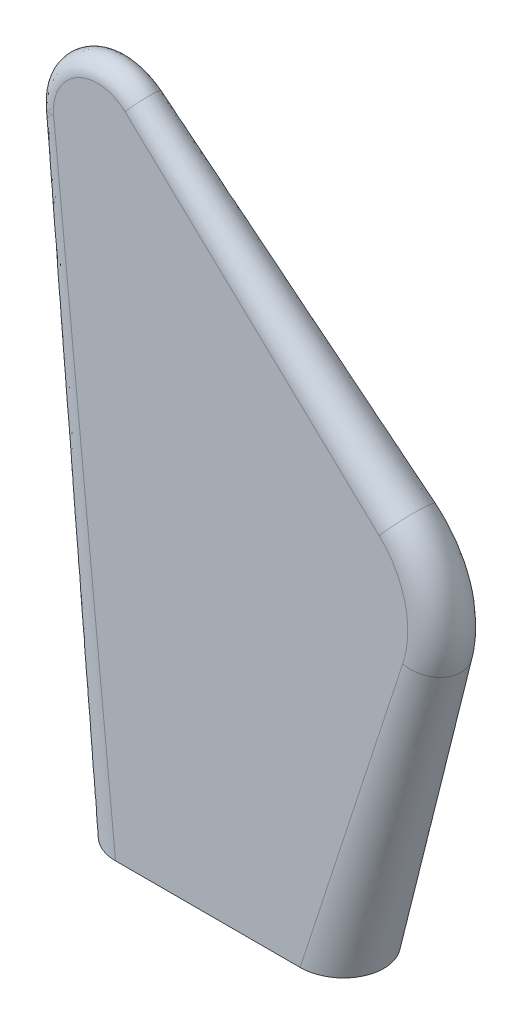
ISO-10303-21;
HEADER;
FILE_DESCRIPTION(('STEP AP214'),'2;1');
FILE_NAME('part.step','',(''),(''),'','','');
FILE_SCHEMA(('AUTOMOTIVE_DESIGN { 1 0 10303 214 1 1 1 1 }'));
ENDSEC;
DATA;
#1=APPLICATION_CONTEXT('core data for automotive mechanical design processes');
#2=APPLICATION_PROTOCOL_DEFINITION('international standard','automotive_design',2000,#1);
#3=PRODUCT_CONTEXT('',#1,'mechanical');
#4=PRODUCT('Part','Part','',(#3));
#5=PRODUCT_RELATED_PRODUCT_CATEGORY('part','',(#4));
#6=PRODUCT_DEFINITION_FORMATION('','',#4);
#7=PRODUCT_DEFINITION_CONTEXT('part definition',#1,'design');
#8=PRODUCT_DEFINITION('design','',#6,#7);
#9=PRODUCT_DEFINITION_SHAPE('','',#8);
#10=(LENGTH_UNIT() NAMED_UNIT(*) SI_UNIT(.MILLI.,.METRE.));
#11=(NAMED_UNIT(*) PLANE_ANGLE_UNIT() SI_UNIT($,.RADIAN.));
#12=(NAMED_UNIT(*) SI_UNIT($,.STERADIAN.) SOLID_ANGLE_UNIT());
#13=UNCERTAINTY_MEASURE_WITH_UNIT(LENGTH_MEASURE(1.E-05),#10,'distance_accuracy_value','');
#14=(GEOMETRIC_REPRESENTATION_CONTEXT(3) GLOBAL_UNCERTAINTY_ASSIGNED_CONTEXT((#13)) GLOBAL_UNIT_ASSIGNED_CONTEXT((#10,
#11,#12)) REPRESENTATION_CONTEXT('',''));
#15=CARTESIAN_POINT('',(0.,0.,0.));
#16=DIRECTION('',(0.,0.,1.));
#17=DIRECTION('',(1.,0.,0.));
#18=AXIS2_PLACEMENT_3D('',#15,#16,#17);
#19=CARTESIAN_POINT('',(-9.1584890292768,124.82656850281,-3.80202617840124));
#20=CARTESIAN_POINT('',(-9.47231548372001,126.533403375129,-3.73553845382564));
#21=CARTESIAN_POINT('',(-9.26136847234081,128.428748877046,-3.66170752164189));
#22=CARTESIAN_POINT('',(-7.77793354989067,131.7429967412,-3.53260493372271));
#23=CARTESIAN_POINT('',(-6.45332179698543,133.230655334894,-3.47465496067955));
#24=CARTESIAN_POINT('',(-3.21819462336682,135.106346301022,-3.40158964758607));
#25=CARTESIAN_POINT('',(-1.23311268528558,135.528586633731,-3.38514177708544));
#26=CARTESIAN_POINT('',(2.51177127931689,135.118635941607,-3.40111091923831));
#27=CARTESIAN_POINT('',(4.34688682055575,134.283110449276,-3.43365782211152));
#28=CARTESIAN_POINT('',(5.71939880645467,133.026299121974,-3.48261541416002));
#29=CARTESIAN_POINT('',(-11.6865890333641,124.593643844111,-3.81109948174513));
#30=CARTESIAN_POINT('',(-11.9894629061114,126.8120111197,-3.72468562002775));
#31=CARTESIAN_POINT('',(-11.6162440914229,129.162989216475,-3.63310606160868));
#32=CARTESIAN_POINT('',(-9.58521478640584,133.264327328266,-3.47334330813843));
#33=CARTESIAN_POINT('',(-7.91178380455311,135.025144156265,-3.40475278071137));
#34=CARTESIAN_POINT('',(-3.85289626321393,137.270496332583,-3.31728775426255));
#35=CARTESIAN_POINT('',(-1.45324127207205,137.759163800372,-3.29825230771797));
#36=CARTESIAN_POINT('',(3.17472514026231,137.272714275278,-3.3172013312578));
#37=CARTESIAN_POINT('',(5.41392357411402,136.298990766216,-3.35513159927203));
#38=CARTESIAN_POINT('',(7.16339143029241,134.783488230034,-3.4141662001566));
#39=CARTESIAN_POINT('',(-14.8705246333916,124.374633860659,-1.91412253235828));
#40=CARTESIAN_POINT('',(-15.1077171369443,127.2402915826,-1.85834183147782));
#41=CARTESIAN_POINT('',(-14.4837821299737,130.135317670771,-1.80144698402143));
#42=CARTESIAN_POINT('',(-11.7224964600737,135.140446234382,-1.7024511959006));
#43=CARTESIAN_POINT('',(-9.61791816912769,137.195181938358,-1.66155616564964));
#44=CARTESIAN_POINT('',(-4.58212495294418,139.833736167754,-1.60890181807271));
#45=CARTESIAN_POINT('',(-1.70749354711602,140.389533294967,-1.597784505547));
#46=CARTESIAN_POINT('',(3.9396119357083,139.82352132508,-1.60910282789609));
#47=CARTESIAN_POINT('',(6.64916100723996,138.708098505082,-1.63139282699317));
#48=CARTESIAN_POINT('',(8.85862925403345,136.911338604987,-1.66716825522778));
#49=CARTESIAN_POINT('',(-14.8841077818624,124.522061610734,1.90263678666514));
#50=CARTESIAN_POINT('',(-15.0914882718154,127.388805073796,1.84676804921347));
#51=CARTESIAN_POINT('',(-14.440122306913,130.266478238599,1.79122857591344));
#52=CARTESIAN_POINT('',(-11.6520331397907,135.219874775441,1.69626310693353));
#53=CARTESIAN_POINT('',(-9.54999933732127,137.244655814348,1.65770177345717));
#54=CARTESIAN_POINT('',(-4.54470132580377,139.839963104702,1.60841669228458));
#55=CARTESIAN_POINT('',(-1.69530682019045,140.385761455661,1.59807836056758));
#56=CARTESIAN_POINT('',(3.90241065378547,139.829819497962,1.60861215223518));
#57=CARTESIAN_POINT('',(6.59191949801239,138.733673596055,1.62939669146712));
#58=CARTESIAN_POINT('',(8.79493845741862,136.963677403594,1.66309066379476));
#59=CARTESIAN_POINT('',(-11.7136742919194,124.88761977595,3.79964799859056));
#60=CARTESIAN_POINT('',(-11.9571945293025,127.109975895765,3.71307875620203));
#61=CARTESIAN_POINT('',(-11.5282306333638,129.428135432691,3.62277760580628));
#62=CARTESIAN_POINT('',(-9.4414975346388,133.426789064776,3.46701480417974));
#63=CARTESIAN_POINT('',(-7.77244546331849,135.126703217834,3.40079666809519));
#64=CARTESIAN_POINT('',(-3.77564376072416,137.283461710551,3.31678270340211));
#65=CARTESIAN_POINT('',(-1.42811659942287,137.751384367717,3.29855534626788));
#66=CARTESIAN_POINT('',(3.09799741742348,137.285705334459,3.31669527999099));
#67=CARTESIAN_POINT('',(5.29615525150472,136.351735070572,3.35307700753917));
#68=CARTESIAN_POINT('',(7.0328803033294,134.890737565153,3.40998842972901));
#69=CARTESIAN_POINT('',(-9.18550980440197,125.11984454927,3.79060195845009));
#70=CARTESIAN_POINT('',(-9.44013086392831,126.832049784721,3.72390503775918));
#71=CARTESIAN_POINT('',(-9.17279892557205,128.696191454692,3.6512896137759));
#72=CARTESIAN_POINT('',(-7.63190730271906,131.908448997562,3.5261599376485));
#73=CARTESIAN_POINT('',(-6.31105133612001,133.334404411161,3.47061353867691));
#74=CARTESIAN_POINT('',(-3.13890563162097,135.119748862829,3.40106756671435));
#75=CARTESIAN_POINT('',(-1.20735286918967,135.520607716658,3.38545258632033));
#76=CARTESIAN_POINT('',(2.43307611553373,135.131961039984,3.40059185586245));
#77=CARTESIAN_POINT('',(4.226364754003,134.337164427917,3.43155221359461));
#78=CARTESIAN_POINT('',(5.58627111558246,133.135698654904,3.47835388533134));
#79=(BOUNDED_SURFACE() B_SPLINE_SURFACE(5,3,((#19,#20,#21,#22,#23,#24,#25,#26,#27,#28),(#29,#30,
#31,#32,#33,#34,#35,#36,#37,#38),(#39,#40,#41,#42,#43,#44,#45,#46,#47,#48),(#49,#50,#51,#52,#53,
#54,#55,#56,#57,#58),(#59,#60,#61,#62,#63,#64,#65,#66,#67,#68),(#69,#70,#71,#72,#73,#74,#75,#76,
#77,#78)),.UNSPECIFIED.,.F.,.F.,.F.) B_SPLINE_SURFACE_WITH_KNOTS((6,6),(4,2,2,2,4),(0.,1.),
(0.388916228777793,0.412054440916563,0.435192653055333,0.458330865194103,0.481469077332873),
.UNSPECIFIED.) GEOMETRIC_REPRESENTATION_ITEM() RATIONAL_B_SPLINE_SURFACE(((1.,1.,1.,1.,1.,1.,1.,
1.,1.,1.),(0.598571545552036,0.601676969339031,0.604662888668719,0.610173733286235,
0.612299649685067,0.615228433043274,0.615805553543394,0.615176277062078,0.613991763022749,
0.61202915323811),(0.397857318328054,0.402515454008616,0.406994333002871,0.41526059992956,
0.418449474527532,0.42284264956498,0.423708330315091,0.422764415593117,0.420987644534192,
0.418043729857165),(0.397857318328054,0.402515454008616,0.406994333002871,0.41526059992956,
0.418449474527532,0.42284264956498,0.423708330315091,0.422764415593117,0.420987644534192,
0.418043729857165),(0.598571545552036,0.601676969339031,0.604662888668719,0.610173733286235,
0.612299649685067,0.615228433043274,0.615805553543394,0.615176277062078,0.613991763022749,
0.61202915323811),(1.,1.,1.,1.,1.,1.,1.,1.,1.,1.))) REPRESENTATION_ITEM('') SURFACE());
#80=CARTESIAN_POINT('',(-9.18550980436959,125.119844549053,3.79060195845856));
#81=CARTESIAN_POINT('',(-11.7136742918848,124.887619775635,3.79964799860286));
#82=CARTESIAN_POINT('',(-14.8841077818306,124.522061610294,1.90263678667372));
#83=CARTESIAN_POINT('',(-14.8705246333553,124.374633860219,-1.91412253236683));
#84=CARTESIAN_POINT('',(-11.6865890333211,124.593643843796,-3.8110994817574));
#85=CARTESIAN_POINT('',(-9.15848902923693,124.826568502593,-3.80202617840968));
#86=(BOUNDED_CURVE() B_SPLINE_CURVE(5,(#80,#81,#82,#83,#84,#85),.UNSPECIFIED.,.F.,
.F.) B_SPLINE_CURVE_WITH_KNOTS((6,6),(0.,1.),
.UNSPECIFIED.) CURVE() GEOMETRIC_REPRESENTATION_ITEM() RATIONAL_B_SPLINE_CURVE((1.,
0.598571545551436,0.397857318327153,0.397857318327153,0.598571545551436,1.)) REPRESENTATION_ITEM(''));
#87=CARTESIAN_POINT('',(-9.18550980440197,125.11984454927,3.79060195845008));
#88=VERTEX_POINT('',#87);
#89=CARTESIAN_POINT('',(-9.1584890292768,124.82656850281,-3.80202617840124));
#90=VERTEX_POINT('',#89);
#91=EDGE_CURVE('E11',#88,#90,#86,.T.);
#92=CARTESIAN_POINT('',(-9.18550980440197,125.11984454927,3.79060195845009));
#93=CARTESIAN_POINT('',(-9.44013086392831,126.832049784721,3.72390503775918));
#94=CARTESIAN_POINT('',(-9.17279892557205,128.696191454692,3.6512896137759));
#95=CARTESIAN_POINT('',(-7.63190730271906,131.908448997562,3.5261599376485));
#96=CARTESIAN_POINT('',(-6.31105133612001,133.334404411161,3.47061353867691));
#97=CARTESIAN_POINT('',(-3.13890563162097,135.119748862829,3.40106756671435));
#98=CARTESIAN_POINT('',(-1.20735286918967,135.520607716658,3.38545258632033));
#99=CARTESIAN_POINT('',(2.43307611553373,135.131961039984,3.40059185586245));
#100=CARTESIAN_POINT('',(4.226364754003,134.337164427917,3.43155221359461));
#101=CARTESIAN_POINT('',(5.58627111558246,133.135698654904,3.47835388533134));
#102=(BOUNDED_CURVE() B_SPLINE_CURVE(3,(#92,#93,#94,#95,#96,#97,#98,#99,#100,#101),
.UNSPECIFIED.,.F.,.F.) B_SPLINE_CURVE_WITH_KNOTS((4,2,2,2,4),(0.388916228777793,
0.412054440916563,0.435192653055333,0.458330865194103,0.481469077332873),
.UNSPECIFIED.) CURVE() GEOMETRIC_REPRESENTATION_ITEM() RATIONAL_B_SPLINE_CURVE((1.,1.,1.,1.,1.,
1.,1.,1.,1.,1.)) REPRESENTATION_ITEM(''));
#103=CARTESIAN_POINT('',(5.58627111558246,133.135698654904,3.47835388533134));
#104=VERTEX_POINT('',#103);
#105=EDGE_CURVE('E123',#104,#88,#102,.F.);
#106=CARTESIAN_POINT('',(5.58627111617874,133.135698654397,3.47835388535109));
#107=CARTESIAN_POINT('',(5.60968036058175,133.164098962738,3.47724780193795));
#108=CARTESIAN_POINT('',(5.63308962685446,133.192476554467,3.47555786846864));
#109=CARTESIAN_POINT('',(5.68060352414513,133.250028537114,3.47094311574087));
#110=CARTESIAN_POINT('',(5.70470742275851,133.279200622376,3.46798195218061));
#111=CARTESIAN_POINT('',(5.75360235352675,133.338327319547,3.46071509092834));
#112=CARTESIAN_POINT('',(5.77839180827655,133.368278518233,3.45637097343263));
#113=CARTESIAN_POINT('',(5.82864418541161,133.428942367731,3.4462234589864));
#114=CARTESIAN_POINT('',(5.85410456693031,133.459650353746,3.44037956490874));
#115=CARTESIAN_POINT('',(5.90567895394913,133.521798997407,3.42711262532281));
#116=CARTESIAN_POINT('',(5.93178932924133,133.553233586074,3.41964701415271));
#117=CARTESIAN_POINT('',(5.98463690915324,133.616798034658,3.40301229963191));
#118=CARTESIAN_POINT('',(6.01136926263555,133.648920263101,3.39379860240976));
#119=CARTESIAN_POINT('',(6.06542624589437,133.713813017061,3.37353960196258));
#120=CARTESIAN_POINT('',(6.09274466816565,133.746574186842,3.36244774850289));
#121=CARTESIAN_POINT('',(6.14793065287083,133.812687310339,3.33830149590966));
#122=CARTESIAN_POINT('',(6.17579051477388,133.846028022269,3.32519869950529));
#123=CARTESIAN_POINT('',(6.23200683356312,133.913231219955,3.29689796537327));
#124=CARTESIAN_POINT('',(6.26035396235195,133.947080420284,3.28164993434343));
#125=CARTESIAN_POINT('',(6.31748205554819,134.015219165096,3.24892590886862));
#126=CARTESIAN_POINT('',(6.34625193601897,134.049493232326,3.23139832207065));
#127=CARTESIAN_POINT('',(6.4041518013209,134.118387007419,3.19398384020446));
#128=CARTESIAN_POINT('',(6.43326882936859,134.152988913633,3.17404410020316));
#129=CARTESIAN_POINT('',(6.49177760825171,134.222429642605,3.13167743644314));
#130=CARTESIAN_POINT('',(6.52115442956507,134.257248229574,3.10919671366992));
#131=CARTESIAN_POINT('',(6.58008520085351,134.326998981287,3.06162596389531));
#132=CARTESIAN_POINT('',(6.6096221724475,134.361908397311,3.03648153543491));
#133=CARTESIAN_POINT('',(6.66876303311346,134.431702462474,2.98346958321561));
#134=CARTESIAN_POINT('',(6.69834784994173,134.466561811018,2.95554745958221));
#135=CARTESIAN_POINT('',(6.75746137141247,134.536102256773,2.89687750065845));
#136=CARTESIAN_POINT('',(6.78696890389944,134.570755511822,2.86607532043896));
#137=CARTESIAN_POINT('',(6.84579205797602,134.639715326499,2.80155688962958));
#138=CARTESIAN_POINT('',(6.87508444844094,134.673991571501,2.76778704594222));
#139=CARTESIAN_POINT('',(6.93332909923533,134.742014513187,2.69726245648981));
#140=CARTESIAN_POINT('',(6.96225616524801,134.775728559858,2.66045540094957));
#141=CARTESIAN_POINT('',(7.01961022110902,134.842430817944,2.58380646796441));
#142=CARTESIAN_POINT('',(7.04801021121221,134.875384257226,2.5439141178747));
#143=CARTESIAN_POINT('',(7.1041395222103,134.940357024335,2.46106899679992));
#144=CARTESIAN_POINT('',(7.13184026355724,134.972339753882,2.41806815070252));
#145=CARTESIAN_POINT('',(7.18639133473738,135.035152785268,2.32900808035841));
#146=CARTESIAN_POINT('',(7.21321180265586,135.065945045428,2.28290372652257));
#147=CARTESIAN_POINT('',(7.26581536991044,135.126151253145,2.18766942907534));
#148=CARTESIAN_POINT('',(7.29156769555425,135.155526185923,2.13849781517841));
#149=CARTESIAN_POINT('',(7.34184318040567,135.21266727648,2.03719526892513));
#150=CARTESIAN_POINT('',(7.36633509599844,135.240394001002,1.9850265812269));
#151=CARTESIAN_POINT('',(7.41389591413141,135.294007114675,1.87783187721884));
#152=CARTESIAN_POINT('',(7.43693361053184,135.319854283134,1.82277239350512));
#153=CARTESIAN_POINT('',(7.48139327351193,135.369479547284,1.70993531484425));
#154=CARTESIAN_POINT('',(7.50278463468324,135.393219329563,1.65212880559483));
#155=CARTESIAN_POINT('',(7.54376349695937,135.438408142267,1.5339750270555));
#156=CARTESIAN_POINT('',(7.56332159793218,135.459820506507,1.47360353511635));
#157=CARTESIAN_POINT('',(7.60045419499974,135.500144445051,1.35053442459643));
#158=CARTESIAN_POINT('',(7.61800112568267,135.51902176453,1.28781725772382));
#159=CARTESIAN_POINT('',(7.65094345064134,135.554081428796,1.1603099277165));
#160=CARTESIAN_POINT('',(7.66631374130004,135.570232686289,1.09550474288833));
#161=CARTESIAN_POINT('',(7.69475186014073,135.599667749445,0.964101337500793));
#162=CARTESIAN_POINT('',(7.70779766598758,135.612924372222,0.897492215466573));
#163=CARTESIAN_POINT('',(7.72550754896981,135.630514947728,0.796659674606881));
#164=CARTESIAN_POINT('',(7.73111440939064,135.636008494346,0.762797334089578));
#165=CARTESIAN_POINT('',(7.7417028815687,135.646223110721,0.694744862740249));
#166=CARTESIAN_POINT('',(7.74668244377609,135.650941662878,0.66055403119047));
#167=CARTESIAN_POINT('',(7.75600330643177,135.65959224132,0.59188982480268));
#168=CARTESIAN_POINT('',(7.76034282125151,135.663522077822,0.557415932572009));
#169=CARTESIAN_POINT('',(7.76837259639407,135.670583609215,0.488230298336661));
#170=CARTESIAN_POINT('',(7.7720613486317,135.673713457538,0.453518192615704));
#171=CARTESIAN_POINT('',(7.77878017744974,135.679165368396,0.383902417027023));
#172=CARTESIAN_POINT('',(7.78180903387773,135.681485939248,0.348998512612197));
#173=CARTESIAN_POINT('',(7.7872004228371,135.685311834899,0.279046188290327));
#174=CARTESIAN_POINT('',(7.78956203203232,135.686816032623,0.24399763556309));
#175=CARTESIAN_POINT('',(7.79361306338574,135.689003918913,0.173803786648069));
#176=CARTESIAN_POINT('',(7.795301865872,135.689686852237,0.138658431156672));
#177=CARTESIAN_POINT('',(7.79800325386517,135.690229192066,0.0683192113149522));
#178=CARTESIAN_POINT('',(7.79901552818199,135.690088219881,0.0331253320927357));
#179=CARTESIAN_POINT('',(7.80036168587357,135.688981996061,-0.0372624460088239));
#180=CARTESIAN_POINT('',(7.80069556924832,135.688016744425,-0.0724563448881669));
#181=CARTESIAN_POINT('',(7.80068464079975,135.685263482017,-0.142795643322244));
#182=CARTESIAN_POINT('',(7.80034014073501,135.683475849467,-0.177941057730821));
#183=CARTESIAN_POINT('',(7.79897401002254,135.679081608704,-0.248135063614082));
#184=CARTESIAN_POINT('',(7.79795300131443,135.676475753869,-0.283183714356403));
#185=CARTESIAN_POINT('',(7.79523727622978,135.670451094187,-0.353136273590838));
#186=CARTESIAN_POINT('',(7.79354348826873,135.667033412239,-0.388040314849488));
#187=CARTESIAN_POINT('',(7.78948745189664,135.659393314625,-0.457656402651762));
#188=CARTESIAN_POINT('',(7.78712643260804,135.65517238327,-0.492368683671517));
#189=CARTESIAN_POINT('',(7.78174299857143,135.645936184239,-0.561554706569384));
#190=CARTESIAN_POINT('',(7.77872210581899,135.640922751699,-0.596028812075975));
#191=CARTESIAN_POINT('',(7.77202764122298,135.630113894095,-0.664693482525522));
#192=CARTESIAN_POINT('',(7.76835587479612,135.624320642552,-0.698884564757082));
#193=CARTESIAN_POINT('',(7.76037040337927,135.61196697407,-0.7669375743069));
#194=CARTESIAN_POINT('',(7.75605877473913,135.605409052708,-0.800800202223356));
#195=CARTESIAN_POINT('',(7.74220572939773,135.584649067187,-0.901633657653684));
#196=CARTESIAN_POINT('',(7.73170771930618,135.569298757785,-0.968243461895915));
#197=CARTESIAN_POINT('',(7.70829577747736,135.53573336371,-1.09964836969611));
#198=CARTESIAN_POINT('',(7.69540428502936,135.517545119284,-1.1644543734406));
#199=CARTESIAN_POINT('',(7.66733911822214,135.478477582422,-1.29196347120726));
#200=CARTESIAN_POINT('',(7.65219112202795,135.457628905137,-1.35468158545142));
#201=CARTESIAN_POINT('',(7.6197659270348,135.413436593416,-1.47775271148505));
#202=CARTESIAN_POINT('',(7.60251704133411,135.390126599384,-1.53812526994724));
#203=CARTESIAN_POINT('',(7.56605757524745,135.341223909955,-1.65628129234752));
#204=CARTESIAN_POINT('',(7.54687732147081,135.315667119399,-1.71408897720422));
#205=CARTESIAN_POINT('',(7.50673369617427,135.262495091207,-1.82692850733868));
#206=CARTESIAN_POINT('',(7.4858020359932,135.234917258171,-1.88198926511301));
#207=CARTESIAN_POINT('',(7.44234143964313,135.177934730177,-1.98918660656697));
#208=CARTESIAN_POINT('',(7.41984498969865,135.148568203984,-2.04135665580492));
#209=CARTESIAN_POINT('',(7.37344435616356,135.088242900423,-2.14266200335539));
#210=CARTESIAN_POINT('',(7.34957286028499,135.057322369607,-2.1918350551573));
#211=CARTESIAN_POINT('',(7.30061203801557,134.994122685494,-2.2870722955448));
#212=CARTESIAN_POINT('',(7.2755550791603,134.961881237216,-2.33317815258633));
#213=CARTESIAN_POINT('',(7.22441059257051,134.896268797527,-2.42224128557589));
#214=CARTESIAN_POINT('',(7.19835465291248,134.862934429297,-2.46524368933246));
#215=CARTESIAN_POINT('',(7.1453942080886,134.795357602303,-2.54809197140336));
#216=CARTESIAN_POINT('',(7.11852012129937,134.761150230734,-2.58798592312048));
#217=CARTESIAN_POINT('',(7.06409793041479,134.692038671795,-2.66463809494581));
#218=CARTESIAN_POINT('',(7.03657875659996,134.657167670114,-2.70144678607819));
#219=CARTESIAN_POINT('',(6.98103171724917,134.586927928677,-2.7719746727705));
#220=CARTESIAN_POINT('',(6.95303104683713,134.551590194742,-2.80574617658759));
#221=CARTESIAN_POINT('',(6.89667577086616,134.480602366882,-2.87026794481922));
#222=CARTESIAN_POINT('',(6.86834644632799,134.444980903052,-2.90107180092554));
#223=CARTESIAN_POINT('',(6.8114771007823,134.373596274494,-2.95974512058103));
#224=CARTESIAN_POINT('',(6.78296033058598,134.337859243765,-2.98766892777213));
#225=CARTESIAN_POINT('',(6.72584722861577,134.266398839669,-3.04068424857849));
#226=CARTESIAN_POINT('',(6.69727205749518,134.230699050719,-3.06583036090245));
#227=CARTESIAN_POINT('',(6.64016092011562,134.159452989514,-3.11340447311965));
#228=CARTESIAN_POINT('',(6.61164401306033,134.123927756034,-3.13588687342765));
#229=CARTESIAN_POINT('',(6.55475581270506,134.053155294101,-3.17825688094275));
#230=CARTESIAN_POINT('',(6.52640150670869,134.017926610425,-3.19819828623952));
#231=CARTESIAN_POINT('',(6.4699327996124,133.947856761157,-3.23561608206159));
#232=CARTESIAN_POINT('',(6.44183337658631,133.91303173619,-3.25314531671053));
#233=CARTESIAN_POINT('',(6.38595703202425,133.843864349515,-3.28587261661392));
#234=CARTESIAN_POINT('',(6.35819316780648,133.809535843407,-3.30112227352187));
#235=CARTESIAN_POINT('',(6.30305940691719,133.741443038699,-3.32942623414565));
#236=CARTESIAN_POINT('',(6.27570075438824,133.70769045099,-3.34253063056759));
#237=CARTESIAN_POINT('',(6.22143841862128,133.640818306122,-3.36668005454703));
#238=CARTESIAN_POINT('',(6.19454428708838,133.607708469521,-3.37777347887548));
#239=CARTESIAN_POINT('',(6.14126226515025,133.542178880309,-3.39803558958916));
#240=CARTESIAN_POINT('',(6.11488236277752,133.509767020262,-3.40725082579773));
#241=CARTESIAN_POINT('',(6.06267111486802,133.445679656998,-3.42388858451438));
#242=CARTESIAN_POINT('',(6.03684632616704,133.414010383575,-3.43135570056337));
#243=CARTESIAN_POINT('',(5.98577945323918,133.351444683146,-3.44462561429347));
#244=CARTESIAN_POINT('',(5.96054262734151,133.320552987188,-3.45047097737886));
#245=CARTESIAN_POINT('',(5.91067844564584,133.259570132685,-3.46062139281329));
#246=CARTESIAN_POINT('',(5.886055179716,133.229482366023,-3.46496694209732));
#247=CARTESIAN_POINT('',(5.83743825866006,133.170127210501,-3.47223662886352));
#248=CARTESIAN_POINT('',(5.8134476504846,133.140862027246,-3.47519918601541));
#249=CARTESIAN_POINT('',(5.76611031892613,133.083164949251,-3.47981668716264));
#250=CARTESIAN_POINT('',(5.74276571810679,133.054734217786,-3.48150797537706));
#251=CARTESIAN_POINT('',(5.71939880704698,133.026299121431,-3.48261541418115));
#252=B_SPLINE_CURVE_WITH_KNOTS('',3,(#106,#107,#108,#109,#110,#111,#112,#113,#114,#115,#116,
#117,#118,#119,#120,#121,#122,#123,#124,#125,#126,#127,#128,#129,#130,#131,#132,#133,#134,#135,
#136,#137,#138,#139,#140,#141,#142,#143,#144,#145,#146,#147,#148,#149,#150,#151,#152,#153,#154,
#155,#156,#157,#158,#159,#160,#161,#162,#163,#164,#165,#166,#167,#168,#169,#170,#171,#172,#173,
#174,#175,#176,#177,#178,#179,#180,#181,#182,#183,#184,#185,#186,#187,#188,#189,#190,#191,#192,
#193,#194,#195,#196,#197,#198,#199,#200,#201,#202,#203,#204,#205,#206,#207,#208,#209,#210,#211,
#212,#213,#214,#215,#216,#217,#218,#219,#220,#221,#222,#223,#224,#225,#226,#227,#228,#229,#230,
#231,#232,#233,#234,#235,#236,#237,#238,#239,#240,#241,#242,#243,#244,#245,#246,#247,#248,#249,
#250,#251),.UNSPECIFIED.,.F.,.F.,(4,2,2,2,2,2,2,2,2,2,2,2,2,2,2,2,2,2,2,2,2,2,2,2,2,2,2,2,2,2,2,
2,2,2,2,2,2,2,2,2,2,2,2,2,2,2,2,2,2,2,2,2,2,2,2,2,2,2,2,2,2,2,2,2,2,2,2,2,2,2,2,2,4),(0.,
0.110458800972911,0.224311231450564,0.341652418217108,0.46257548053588,0.58717066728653,
0.715524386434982,0.847718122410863,0.98382723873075,1.12391966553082,1.26805447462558,
1.41628034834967,1.56863395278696,1.72513823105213,1.88580063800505,2.05061134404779,
2.21954144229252,2.39254120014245,2.569538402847,2.75043684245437,2.93511501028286,
3.12342505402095,3.31519206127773,3.51021372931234,3.70826047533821,3.90907603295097,
4.11237856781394,4.31786232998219,4.52519984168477,4.62946781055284,4.73406807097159,
4.8389548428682,4.94408157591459,5.04940106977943,5.15486559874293,5.26042703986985,
5.36603700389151,5.47164696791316,5.57720840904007,5.68267293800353,5.78799243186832,
5.89311916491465,5.9980059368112,6.10260619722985,6.20687416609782,6.41421167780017,
6.61969543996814,6.82299797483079,7.02381353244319,7.22186027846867,7.41688194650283,
7.60864895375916,7.79695899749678,7.98163716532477,8.16253560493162,8.3395328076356,
8.51253256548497,8.68146266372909,8.84627336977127,9.00693577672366,9.16344005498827,
9.315793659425,9.46401953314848,9.60815434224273,9.74824676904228,9.88435588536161,
10.0165496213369,10.1449033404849,10.2694985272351,10.3904215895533,10.5077627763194,
10.6216152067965,10.732074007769),.UNSPECIFIED.);
#253=CARTESIAN_POINT('',(5.71939880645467,133.026299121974,-3.48261541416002));
#254=VERTEX_POINT('',#253);
#255=EDGE_CURVE('E44',#104,#254,#252,.T.);
#256=CARTESIAN_POINT('',(5.71939880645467,133.026299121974,-3.48261541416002));
#257=CARTESIAN_POINT('',(4.34688682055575,134.283110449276,-3.43365782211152));
#258=CARTESIAN_POINT('',(2.51177127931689,135.118635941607,-3.40111091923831));
#259=CARTESIAN_POINT('',(-1.23311268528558,135.528586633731,-3.38514177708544));
#260=CARTESIAN_POINT('',(-3.21819462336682,135.106346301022,-3.40158964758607));
#261=CARTESIAN_POINT('',(-6.45332179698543,133.230655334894,-3.47465496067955));
#262=CARTESIAN_POINT('',(-7.77793354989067,131.7429967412,-3.53260493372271));
#263=CARTESIAN_POINT('',(-9.26136847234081,128.428748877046,-3.66170752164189));
#264=CARTESIAN_POINT('',(-9.47231548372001,126.533403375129,-3.73553845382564));
#265=CARTESIAN_POINT('',(-9.1584890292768,124.82656850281,-3.80202617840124));
#266=(BOUNDED_CURVE() B_SPLINE_CURVE(3,(#256,#257,#258,#259,#260,#261,#262,#263,#264,#265),
.UNSPECIFIED.,.F.,.F.) B_SPLINE_CURVE_WITH_KNOTS((4,2,2,2,4),(0.388916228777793,
0.412054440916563,0.435192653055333,0.458330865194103,0.481469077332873),
.UNSPECIFIED.) CURVE() GEOMETRIC_REPRESENTATION_ITEM() RATIONAL_B_SPLINE_CURVE((1.,1.,1.,1.,1.,
1.,1.,1.,1.,1.)) REPRESENTATION_ITEM(''));
#267=EDGE_CURVE('E192',#90,#254,#266,.F.);
#268=ORIENTED_EDGE('',*,*,#91,.F.);
#269=ORIENTED_EDGE('',*,*,#105,.F.);
#270=ORIENTED_EDGE('',*,*,#255,.T.);
#271=ORIENTED_EDGE('',*,*,#267,.F.);
#272=EDGE_LOOP('',(#268,#269,#270,#271));
#273=FACE_BOUND('',#272,.T.);
#274=ADVANCED_FACE('F31',(#273),#79,.T.);
#275=CARTESIAN_POINT('',(5.71939880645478,133.026299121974,-3.48261541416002));
#276=CARTESIAN_POINT('',(5.833693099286,132.919897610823,-3.48676015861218));
#277=CARTESIAN_POINT('',(5.99307832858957,132.784452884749,-3.49203624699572));
#278=CARTESIAN_POINT('',(6.28370934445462,132.529387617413,-3.50197201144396));
#279=CARTESIAN_POINT('',(6.4290250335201,132.401854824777,-3.50693989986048));
#280=CARTESIAN_POINT('',(6.86497263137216,132.019255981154,-3.52184358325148));
#281=CARTESIAN_POINT('',(7.15560507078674,131.764189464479,-3.53177939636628));
#282=CARTESIAN_POINT('',(8.02750440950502,130.998988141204,-3.56158690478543));
#283=CARTESIAN_POINT('',(8.60877332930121,130.488851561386,-3.58145866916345));
#284=CARTESIAN_POINT('',(10.3525873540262,128.958435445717,-3.64107421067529));
#285=CARTESIAN_POINT('',(11.5151397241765,127.938149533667,-3.68081823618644));
#286=CARTESIAN_POINT('',(15.0028193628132,124.877272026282,-3.80005108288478));
#287=CARTESIAN_POINT('',(17.3279691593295,122.836660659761,-3.87954067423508));
#288=CARTESIAN_POINT('',(24.3034563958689,116.714793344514,-4.11801074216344));
#289=CARTESIAN_POINT('',(28.9538316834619,112.633504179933,-4.27699251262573));
#290=CARTESIAN_POINT('',(42.9046908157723,100.389870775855,-4.75392870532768));
#291=CARTESIAN_POINT('',(52.2049040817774,92.227756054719,-5.07187418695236));
#292=CARTESIAN_POINT('',(61.5036544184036,84.0669411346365,-5.38976903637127));
#293=CARTESIAN_POINT('',(9.88753120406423,138.098483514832,-3.28503449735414));
#294=CARTESIAN_POINT('',(10.0698107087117,137.953233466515,-3.2906284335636));
#295=CARTESIAN_POINT('',(10.208134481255,137.843567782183,-3.2949644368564));
#296=CARTESIAN_POINT('',(10.5107584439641,137.602897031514,-3.30433948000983));
#297=CARTESIAN_POINT('',(10.6620706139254,137.48256150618,-3.30902700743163));
#298=CARTESIAN_POINT('',(11.1160076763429,137.121554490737,-3.32308960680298));
#299=CARTESIAN_POINT('',(11.4186331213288,136.880882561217,-3.33246469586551));
#300=CARTESIAN_POINT('',(12.3265115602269,136.158865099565,-3.36059002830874));
#301=CARTESIAN_POINT('',(12.9317666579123,135.67751789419,-3.37934033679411));
#302=CARTESIAN_POINT('',(14.7475395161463,134.233470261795,-3.43559149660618));
#303=CARTESIAN_POINT('',(15.9580648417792,133.270763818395,-3.47309258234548));
#304=CARTESIAN_POINT('',(19.5896642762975,130.382625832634,-3.58559656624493));
#305=CARTESIAN_POINT('',(22.0107618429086,128.457175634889,-3.66060019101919));
#306=CARTESIAN_POINT('',(29.2740939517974,122.680793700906,-3.88561228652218));
#307=CARTESIAN_POINT('',(34.1163679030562,118.829830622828,-4.03562197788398));
#308=CARTESIAN_POINT('',(48.6429120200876,107.277162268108,-4.48564244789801));
#309=CARTESIAN_POINT('',(58.3269030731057,99.5756757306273,-4.78564436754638));
#310=CARTESIAN_POINT('',(68.0093655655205,91.8754112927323,-5.08559935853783));
#311=CARTESIAN_POINT('',(9.76195631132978,138.201676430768,3.28101473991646));
#312=CARTESIAN_POINT('',(9.94376740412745,138.059937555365,3.28647243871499));
#313=CARTESIAN_POINT('',(10.0818573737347,137.948777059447,3.29086613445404));
#314=CARTESIAN_POINT('',(10.3841220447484,137.708405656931,3.30022951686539));
#315=CARTESIAN_POINT('',(10.5352545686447,137.588219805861,3.30491121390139));
#316=CARTESIAN_POINT('',(10.9886526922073,137.227661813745,3.31895632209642));
#317=CARTESIAN_POINT('',(11.290918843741,136.987289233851,3.32831975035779));
#318=CARTESIAN_POINT('',(12.1977193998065,136.266169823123,3.35641010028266));
#319=CARTESIAN_POINT('',(12.8022559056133,135.785421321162,3.37513708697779));
#320=CARTESIAN_POINT('',(14.615872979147,134.343169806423,3.43131828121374));
#321=CARTESIAN_POINT('',(15.8249611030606,133.381660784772,3.46877272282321));
#322=CARTESIAN_POINT('',(19.4522489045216,130.497115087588,3.58113677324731));
#323=CARTESIAN_POINT('',(21.8704720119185,128.574059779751,3.65604710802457));
#324=CARTESIAN_POINT('',(29.1251806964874,122.804862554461,3.8807793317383));
#325=CARTESIAN_POINT('',(33.9617056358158,118.958689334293,4.03060243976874));
#326=CARTESIAN_POINT('',(48.471003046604,107.420390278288,4.48006317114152));
#327=CARTESIAN_POINT('',(58.1434966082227,99.7284830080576,4.77969194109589));
#328=CARTESIAN_POINT('',(67.8144636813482,92.0377961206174,5.07927385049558));
#329=CARTESIAN_POINT('',(5.58627111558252,133.135698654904,3.47835388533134));
#330=CARTESIAN_POINT('',(5.70040258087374,133.033134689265,3.48234914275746));
#331=CARTESIAN_POINT('',(5.85924858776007,132.895954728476,3.48769282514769));
#332=CARTESIAN_POINT('',(6.14949882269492,132.641206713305,3.4976162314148));
#333=CARTESIAN_POINT('',(6.29462412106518,132.513832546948,3.50257794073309));
#334=CARTESIAN_POINT('',(6.73000054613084,132.131709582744,3.51746308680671));
#335=CARTESIAN_POINT('',(7.02025220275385,131.876960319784,3.52738654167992));
#336=CARTESIAN_POINT('',(7.89100919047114,131.11271075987,3.55715697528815));
#337=CARTESIAN_POINT('',(8.47151653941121,130.603208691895,3.57700402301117));
#338=CARTESIAN_POINT('',(10.2130458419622,129.074696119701,3.63654541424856));
#339=CARTESIAN_POINT('',(11.3740750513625,128.055679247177,3.67624000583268));
#340=CARTESIAN_POINT('',(14.8571851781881,124.998608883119,3.79532454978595));
#341=CARTESIAN_POINT('',(17.1792885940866,122.960535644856,3.87471527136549));
#342=CARTESIAN_POINT('',(24.1456366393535,116.846282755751,4.11288872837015));
#343=CARTESIAN_POINT('',(28.7899190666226,112.770069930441,4.27167275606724));
#344=CARTESIAN_POINT('',(42.7224999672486,100.541665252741,4.74801573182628));
#345=CARTESIAN_POINT('',(52.010528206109,92.3897026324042,5.06556575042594));
#346=CARTESIAN_POINT('',(61.2970954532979,84.2390381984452,5.38306519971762));
#347=(BOUNDED_SURFACE() B_SPLINE_SURFACE(3,3,((#275,#276,#277,#278,#279,#280,#281,#282,#283,
#284,#285,#286,#287,#288,#289,#290,#291,#292),(#293,#294,#295,#296,#297,#298,#299,#300,#301,
#302,#303,#304,#305,#306,#307,#308,#309,#310),(#311,#312,#313,#314,#315,#316,#317,#318,#319,
#320,#321,#322,#323,#324,#325,#326,#327,#328),(#329,#330,#331,#332,#333,#334,#335,#336,#337,
#338,#339,#340,#341,#342,#343,#344,#345,#346)),.UNSPECIFIED.,.F.,.F.,
.F.) B_SPLINE_SURFACE_WITH_KNOTS((4,4),(4,2,2,2,2,2,2,2,4),(0.,1.),(0.481469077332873,
0.483263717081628,0.485058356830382,0.48864763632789,0.495826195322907,0.51018331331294,
0.538897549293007,0.59632602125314,0.711182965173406),
.UNSPECIFIED.) GEOMETRIC_REPRESENTATION_ITEM() RATIONAL_B_SPLINE_SURFACE(((1.,1.,1.,1.,1.,1.,1.,
1.,1.,1.,1.,1.,1.,1.,1.,1.,1.,1.),(0.353381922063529,0.353188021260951,0.35326999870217,
0.35326999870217,0.353269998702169,0.353269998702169,0.353269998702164,0.353269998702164,
0.353269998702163,0.353269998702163,0.353269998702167,0.353269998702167,0.353269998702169,
0.353269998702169,0.35326999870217,0.35326999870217,0.35326999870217,0.35326999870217),
(0.353381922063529,0.353188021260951,0.35326999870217,0.35326999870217,0.353269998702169,
0.353269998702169,0.353269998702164,0.353269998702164,0.353269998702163,0.353269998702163,
0.353269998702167,0.353269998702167,0.353269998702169,0.353269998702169,0.35326999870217,
0.35326999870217,0.35326999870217,0.35326999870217),(1.,1.,1.,1.,1.,1.,1.,1.,1.,1.,1.,1.,1.,1.,
1.,1.,1.,1.))) REPRESENTATION_ITEM('') SURFACE());
#348=CARTESIAN_POINT('',(5.58627111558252,133.135698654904,3.47835388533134));
#349=CARTESIAN_POINT('',(5.70040258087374,133.033134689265,3.48234914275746));
#350=CARTESIAN_POINT('',(5.85924858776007,132.895954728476,3.48769282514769));
#351=CARTESIAN_POINT('',(6.14949882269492,132.641206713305,3.4976162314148));
#352=CARTESIAN_POINT('',(6.29462412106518,132.513832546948,3.50257794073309));
#353=CARTESIAN_POINT('',(6.73000054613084,132.131709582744,3.51746308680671));
#354=CARTESIAN_POINT('',(7.02025220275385,131.876960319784,3.52738654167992));
#355=CARTESIAN_POINT('',(7.89100919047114,131.11271075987,3.55715697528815));
#356=CARTESIAN_POINT('',(8.47151653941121,130.603208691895,3.57700402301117));
#357=CARTESIAN_POINT('',(10.2130458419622,129.074696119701,3.63654541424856));
#358=CARTESIAN_POINT('',(11.3740750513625,128.055679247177,3.67624000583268));
#359=CARTESIAN_POINT('',(14.8571851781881,124.998608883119,3.79532454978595));
#360=CARTESIAN_POINT('',(17.1792885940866,122.960535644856,3.87471527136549));
#361=CARTESIAN_POINT('',(24.1456366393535,116.846282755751,4.11288872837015));
#362=CARTESIAN_POINT('',(28.7899190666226,112.770069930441,4.27167275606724));
#363=CARTESIAN_POINT('',(42.7224999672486,100.541665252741,4.74801573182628));
#364=CARTESIAN_POINT('',(52.010528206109,92.3897026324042,5.06556575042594));
#365=CARTESIAN_POINT('',(61.2970954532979,84.2390381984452,5.38306519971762));
#366=(BOUNDED_CURVE() B_SPLINE_CURVE(3,(#348,#349,#350,#351,#352,#353,#354,#355,#356,#357,#358,
#359,#360,#361,#362,#363,#364,#365),.UNSPECIFIED.,.F.,.F.) B_SPLINE_CURVE_WITH_KNOTS((4,2,2,2,2,
2,2,2,4),(0.481469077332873,0.483263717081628,0.485058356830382,0.48864763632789,
0.495826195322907,0.51018331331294,0.538897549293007,0.59632602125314,0.711182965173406),
.UNSPECIFIED.) CURVE() GEOMETRIC_REPRESENTATION_ITEM() RATIONAL_B_SPLINE_CURVE((1.,1.,1.,1.,1.,
1.,1.,1.,1.,1.,1.,1.,1.,1.,1.,1.,1.,1.)) REPRESENTATION_ITEM(''));
#367=CARTESIAN_POINT('',(61.2970954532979,84.2390381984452,5.38306519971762));
#368=VERTEX_POINT('',#367);
#369=EDGE_CURVE('E306',#368,#104,#366,.F.);
#370=CARTESIAN_POINT('',(61.2970954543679,84.239038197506,5.3830651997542));
#371=CARTESIAN_POINT('',(61.3336208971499,84.2827449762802,5.38136298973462));
#372=CARTESIAN_POINT('',(61.3701463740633,84.3264165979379,5.37875719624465));
#373=CARTESIAN_POINT('',(61.4442825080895,84.4149859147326,5.37163472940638));
#374=CARTESIAN_POINT('',(61.4818920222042,84.4598800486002,5.36706179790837));
#375=CARTESIAN_POINT('',(61.5581834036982,84.5508724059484,5.35583532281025));
#376=CARTESIAN_POINT('',(61.5968628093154,84.5969653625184,5.34912230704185));
#377=CARTESIAN_POINT('',(61.6752726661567,84.6903229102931,5.33343803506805));
#378=CARTESIAN_POINT('',(61.7149991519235,84.7375803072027,5.3244040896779));
#379=CARTESIAN_POINT('',(61.7954722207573,84.8332224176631,5.30389238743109));
#380=CARTESIAN_POINT('',(61.8362131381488,84.8815977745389,5.29234873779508));
#381=CARTESIAN_POINT('',(61.9186732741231,84.9794182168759,5.26662513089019));
#382=CARTESIAN_POINT('',(61.9603849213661,85.0288515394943,5.25237613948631));
#383=CARTESIAN_POINT('',(62.0447326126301,85.1287155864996,5.22104350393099));
#384=CARTESIAN_POINT('',(62.0873589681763,85.1791318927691,5.20388779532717));
#385=CARTESIAN_POINT('',(62.1734687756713,85.2808733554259,5.16653899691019));
#386=CARTESIAN_POINT('',(62.216940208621,85.3321811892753,5.14627098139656));
#387=CARTESIAN_POINT('',(62.3046581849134,85.4355994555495,5.10249226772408));
#388=CARTESIAN_POINT('',(62.3488901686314,85.4876894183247,5.07890401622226));
#389=CARTESIAN_POINT('',(62.4380313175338,85.5925465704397,5.02827916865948));
#390=CARTESIAN_POINT('',(62.4829231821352,85.6452899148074,5.00116269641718));
#391=CARTESIAN_POINT('',(62.5732690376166,85.7513080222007,4.94327802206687));
#392=CARTESIAN_POINT('',(62.6187028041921,85.8045553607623,4.91242800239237));
#393=CARTESIAN_POINT('',(62.7099992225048,85.9114140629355,4.84687820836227));
#394=CARTESIAN_POINT('',(62.7558385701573,85.9649942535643,4.81209513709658));
#395=CARTESIAN_POINT('',(62.8477938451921,86.072328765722,4.73849011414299));
#396=CARTESIAN_POINT('',(62.8938832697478,86.1260480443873,4.69958393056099));
#397=CARTESIAN_POINT('',(62.9861666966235,86.2334477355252,4.61755644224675));
#398=CARTESIAN_POINT('',(63.0323309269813,86.2870891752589,4.57435059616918));
#399=CARTESIAN_POINT('',(63.1245719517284,86.3940968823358,4.48356483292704));
#400=CARTESIAN_POINT('',(63.1706156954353,86.447420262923,4.43590076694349));
#401=CARTESIAN_POINT('',(63.2624037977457,86.5535325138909,4.33606167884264));
#402=CARTESIAN_POINT('',(63.3081118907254,86.6062746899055,4.28380366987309));
#403=CARTESIAN_POINT('',(63.3989973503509,86.7109430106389,4.1746669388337));
#404=CARTESIAN_POINT('',(63.4441353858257,86.7628188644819,4.11770721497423));
#405=CARTESIAN_POINT('',(63.5336310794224,86.8654523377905,3.99908966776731));
#406=CARTESIAN_POINT('',(63.5779465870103,86.9161563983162,3.93735368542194));
#407=CARTESIAN_POINT('',(63.6655309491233,87.0161256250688,3.80914388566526));
#408=CARTESIAN_POINT('',(63.7087551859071,87.0653344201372,3.74259562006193));
#409=CARTESIAN_POINT('',(63.7938764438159,87.1619770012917,3.6047643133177));
#410=CARTESIAN_POINT('',(63.835726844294,87.2093521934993,3.53341138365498));
#411=CARTESIAN_POINT('',(63.917808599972,87.301979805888,3.38602141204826));
#412=CARTESIAN_POINT('',(63.9579919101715,87.3471721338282,3.30991983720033));
#413=CARTESIAN_POINT('',(64.036440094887,87.4350792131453,3.15313508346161));
#414=CARTESIAN_POINT('',(64.0746561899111,87.4777332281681,3.07239343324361));
#415=CARTESIAN_POINT('',(64.148867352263,87.5602071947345,2.90648634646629));
#416=CARTESIAN_POINT('',(64.1848136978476,87.5999667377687,2.82126907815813));
#417=CARTESIAN_POINT('',(64.2541845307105,87.6762996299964,2.64662622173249));
#418=CARTESIAN_POINT('',(64.2875612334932,87.7128139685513,2.55715585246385));
#419=CARTESIAN_POINT('',(64.3514991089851,87.782315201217,2.37428131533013));
#420=CARTESIAN_POINT('',(64.3820143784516,87.8152456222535,2.28083963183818));
#421=CARTESIAN_POINT('',(64.4399488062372,87.8772557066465,2.09035472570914));
#422=CARTESIAN_POINT('',(64.4673249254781,87.9062826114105,1.99328122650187));
#423=CARTESIAN_POINT('',(64.5187189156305,87.9601867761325,1.79592456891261));
#424=CARTESIAN_POINT('',(64.5426975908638,87.9850161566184,1.69561814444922));
#425=CARTESIAN_POINT('',(64.5870611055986,88.0302598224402,1.49222907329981));
#426=CARTESIAN_POINT('',(64.6074115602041,88.050632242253,1.38912954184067));
#427=CARTESIAN_POINT('',(64.6350358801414,88.0776583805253,1.23305752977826));
#428=CARTESIAN_POINT('',(64.6437812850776,88.0860974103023,1.18064412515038));
#429=CARTESIAN_POINT('',(64.6602961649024,88.1017861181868,1.07530977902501));
#430=CARTESIAN_POINT('',(64.6680624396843,88.1090319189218,1.02238775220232));
#431=CARTESIAN_POINT('',(64.6825987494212,88.1223125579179,0.916106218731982));
#432=CARTESIAN_POINT('',(64.6893659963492,88.1283440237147,0.862745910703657));
#433=CARTESIAN_POINT('',(64.7018870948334,88.1391781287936,0.755657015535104));
#434=CARTESIAN_POINT('',(64.7076385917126,88.1439779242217,0.701927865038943));
#435=CARTESIAN_POINT('',(64.7181134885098,88.1523338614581,0.594172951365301));
#436=CARTESIAN_POINT('',(64.7228349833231,88.1558877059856,0.540146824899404));
#437=CARTESIAN_POINT('',(64.7312379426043,88.1617402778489,0.431870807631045));
#438=CARTESIAN_POINT('',(64.7349179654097,88.1640372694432,0.377620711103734));
#439=CARTESIAN_POINT('',(64.7412288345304,88.1673680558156,0.268970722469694));
#440=CARTESIAN_POINT('',(64.7438587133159,88.1684006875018,0.214570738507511));
#441=CARTESIAN_POINT('',(64.7480630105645,88.1691981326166,0.10569566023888));
#442=CARTESIAN_POINT('',(64.7496369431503,88.1689623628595,0.0512205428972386));
#443=CARTESIAN_POINT('',(64.7517259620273,88.1672218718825,-0.0577297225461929));
#444=CARTESIAN_POINT('',(64.7522410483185,88.1657171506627,-0.112204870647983));
#445=CARTESIAN_POINT('',(64.7522119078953,88.1614411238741,-0.221080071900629));
#446=CARTESIAN_POINT('',(64.7516681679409,88.1586704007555,-0.275480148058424));
#447=CARTESIAN_POINT('',(64.7495238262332,88.151868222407,-0.384130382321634));
#448=CARTESIAN_POINT('',(64.7479241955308,88.1478379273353,-0.438380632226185));
#449=CARTESIAN_POINT('',(64.7436734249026,88.1385259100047,-0.546657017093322));
#450=CARTESIAN_POINT('',(64.7410237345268,88.1332459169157,-0.600683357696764));
#451=CARTESIAN_POINT('',(64.7346810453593,88.1214471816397,-0.708438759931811));
#452=CARTESIAN_POINT('',(64.7309899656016,88.1149307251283,-0.762168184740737));
#453=CARTESIAN_POINT('',(64.7225755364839,88.1006750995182,-0.869257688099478));
#454=CARTESIAN_POINT('',(64.717854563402,88.0929387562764,-0.922618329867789));
#455=CARTESIAN_POINT('',(64.7073939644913,88.076262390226,-1.02890058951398));
#456=CARTESIAN_POINT('',(64.7016571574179,88.0673257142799,-1.08182300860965));
#457=CARTESIAN_POINT('',(64.6891816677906,88.0482715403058,-1.18715819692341));
#458=CARTESIAN_POINT('',(64.6824462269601,88.0381578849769,-1.23957205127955));
#459=CARTESIAN_POINT('',(64.6608070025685,88.0061451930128,-1.39564549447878));
#460=CARTESIAN_POINT('',(64.6444102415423,87.9824787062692,-1.49874609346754));
#461=CARTESIAN_POINT('',(64.6078463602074,87.9307366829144,-1.70213751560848));
#462=CARTESIAN_POINT('',(64.5877142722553,87.9027024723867,-1.80244522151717));
#463=CARTESIAN_POINT('',(64.5438885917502,87.8424926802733,-1.99980464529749));
#464=CARTESIAN_POINT('',(64.5202350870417,87.8103642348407,-2.09687962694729));
#465=CARTESIAN_POINT('',(64.4696054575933,87.7422680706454,-2.28736768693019));
#466=CARTESIAN_POINT('',(64.4426735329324,87.7063521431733,-2.38081103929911));
#467=CARTESIAN_POINT('',(64.3857486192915,87.631007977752,-2.56368908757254));
#468=CARTESIAN_POINT('',(64.3558029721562,87.5916350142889,-2.6531612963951));
#469=CARTESIAN_POINT('',(64.2931294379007,87.5097221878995,-2.82780798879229));
#470=CARTESIAN_POINT('',(64.2604510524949,87.4672399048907,-2.91302725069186));
#471=CARTESIAN_POINT('',(64.1926021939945,87.3794651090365,-3.07893846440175));
#472=CARTESIAN_POINT('',(64.1574824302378,87.3342313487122,-3.15968224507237));
#473=CARTESIAN_POINT('',(64.0850467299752,87.2413148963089,-3.31647138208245));
#474=CARTESIAN_POINT('',(64.0477818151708,87.19369107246,-3.39257520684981));
#475=CARTESIAN_POINT('',(63.9713522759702,87.0963542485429,-3.53996978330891));
#476=CARTESIAN_POINT('',(63.9322381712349,87.0466992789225,-3.61132506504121));
#477=CARTESIAN_POINT('',(63.8524025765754,86.9456528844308,-3.74916116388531));
#478=CARTESIAN_POINT('',(63.8117303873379,86.8943178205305,-3.81571186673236));
#479=CARTESIAN_POINT('',(63.7290627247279,86.7902521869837,-3.94392661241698));
#480=CARTESIAN_POINT('',(63.6871147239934,86.737575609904,-4.00566510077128));
#481=CARTESIAN_POINT('',(63.6021678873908,86.6311522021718,-4.12428771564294));
#482=CARTESIAN_POINT('',(63.5592141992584,86.5774564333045,-4.18124999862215));
#483=CARTESIAN_POINT('',(63.4725140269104,86.4693010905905,-4.29039188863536));
#484=CARTESIAN_POINT('',(63.4288099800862,86.4148892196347,-4.34265249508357));
#485=CARTESIAN_POINT('',(63.3408506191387,86.3055870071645,-4.44249680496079));
#486=CARTESIAN_POINT('',(63.2966347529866,86.2507407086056,-4.49016349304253));
#487=CARTESIAN_POINT('',(63.2078752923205,86.1408322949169,-4.58095451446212));
#488=CARTESIAN_POINT('',(63.1633679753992,86.0858103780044,-4.62416299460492));
#489=CARTESIAN_POINT('',(63.0742302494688,85.9757898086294,-4.70619575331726));
#490=CARTESIAN_POINT('',(63.0296328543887,85.9208274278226,-4.74510457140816));
#491=CARTESIAN_POINT('',(62.9405002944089,85.8111411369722,-4.81871485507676));
#492=CARTESIAN_POINT('',(62.8959948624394,85.7564495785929,-4.85350055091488));
#493=CARTESIAN_POINT('',(62.8072122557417,85.6474964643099,-4.91905557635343));
#494=CARTESIAN_POINT('',(62.7629615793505,85.5932634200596,-4.94990820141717));
#495=CARTESIAN_POINT('',(62.6748355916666,85.4853958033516,-5.00779806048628));
#496=CARTESIAN_POINT('',(62.630983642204,85.4317860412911,-5.03491711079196));
#497=CARTESIAN_POINT('',(62.5437839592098,85.3253113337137,-5.08554708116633));
#498=CARTESIAN_POINT('',(62.5004565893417,85.2724676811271,-5.10913787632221));
#499=CARTESIAN_POINT('',(62.4144175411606,85.1676505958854,-5.15292163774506));
#500=CARTESIAN_POINT('',(62.3717233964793,85.1156951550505,-5.17319215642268));
#501=CARTESIAN_POINT('',(62.2870459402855,85.0127603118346,-5.21054591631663));
#502=CARTESIAN_POINT('',(62.2450775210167,84.9617958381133,-5.22770408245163));
#503=CARTESIAN_POINT('',(62.1619314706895,84.8609306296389,-5.25904158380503));
#504=CARTESIAN_POINT('',(62.1207662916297,84.8110420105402,-5.27329298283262));
#505=CARTESIAN_POINT('',(62.0392926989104,84.7123996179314,-5.29902135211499));
#506=CARTESIAN_POINT('',(61.9989945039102,84.6636554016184,-5.31056735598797));
#507=CARTESIAN_POINT('',(61.9193081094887,84.5673578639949,-5.33108371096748));
#508=CARTESIAN_POINT('',(61.8799281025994,84.5198117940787,-5.34011995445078));
#509=CARTESIAN_POINT('',(61.8021197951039,84.4259530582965,-5.35580876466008));
#510=CARTESIAN_POINT('',(61.7636978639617,84.3796455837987,-5.3625240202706));
#511=CARTESIAN_POINT('',(61.6878370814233,84.2882944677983,-5.37375491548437));
#512=CARTESIAN_POINT('',(61.6504029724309,84.2432541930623,-5.37833002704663));
#513=CARTESIAN_POINT('',(61.5765400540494,84.1544572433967,-5.38545679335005));
#514=CARTESIAN_POINT('',(61.5401145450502,84.1107023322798,-5.38806470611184));
#515=CARTESIAN_POINT('',(61.5036544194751,84.0669411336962,-5.3897690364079));
#516=B_SPLINE_CURVE_WITH_KNOTS('',3,(#370,#371,#372,#373,#374,#375,#376,#377,#378,#379,#380,
#381,#382,#383,#384,#385,#386,#387,#388,#389,#390,#391,#392,#393,#394,#395,#396,#397,#398,#399,
#400,#401,#402,#403,#404,#405,#406,#407,#408,#409,#410,#411,#412,#413,#414,#415,#416,#417,#418,
#419,#420,#421,#422,#423,#424,#425,#426,#427,#428,#429,#430,#431,#432,#433,#434,#435,#436,#437,
#438,#439,#440,#441,#442,#443,#444,#445,#446,#447,#448,#449,#450,#451,#452,#453,#454,#455,#456,
#457,#458,#459,#460,#461,#462,#463,#464,#465,#466,#467,#468,#469,#470,#471,#472,#473,#474,#475,
#476,#477,#478,#479,#480,#481,#482,#483,#484,#485,#486,#487,#488,#489,#490,#491,#492,#493,#494,
#495,#496,#497,#498,#499,#500,#501,#502,#503,#504,#505,#506,#507,#508,#509,#510,#511,#512,#513,
#514,#515),.UNSPECIFIED.,.F.,.F.,(4,2,2,2,2,2,2,2,2,2,2,2,2,2,2,2,2,2,2,2,2,2,2,2,2,2,2,2,2,2,2,
2,2,2,2,2,2,2,2,2,2,2,2,2,2,2,2,2,2,2,2,2,2,2,2,2,2,2,2,2,2,2,2,2,2,2,2,2,2,2,2,2,4),(0.,
0.170947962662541,0.347148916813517,0.528750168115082,0.715895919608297,0.908725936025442,
1.10737404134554,1.31196644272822,1.52261987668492,1.73943957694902,1.96251706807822,
2.19192779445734,2.4277286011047,2.66995509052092,2.9186188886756,3.17370486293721,
3.43516834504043,3.70293242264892,3.97688537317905,4.25687832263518,4.54272321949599,
4.83419121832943,5.13101156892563,5.4328711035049,5.73941440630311,6.05024473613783,
6.36492575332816,6.68298407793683,7.00391267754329,7.16530478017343,7.32721139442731,
7.48956163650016,7.65228342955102,7.81530368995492,7.97854852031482,8.14194340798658,
8.30541342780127,8.46888344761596,8.63227833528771,8.79552316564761,8.95854342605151,
9.12126521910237,9.28361546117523,9.44552207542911,9.60691417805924,9.9278427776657,
10.2459011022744,10.5605821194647,10.8714124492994,11.1779557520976,11.4798152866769,
11.7766356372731,12.0681036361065,12.3539485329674,12.6339414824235,12.9078944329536,
13.1756585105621,13.4371219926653,13.6922079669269,13.9408717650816,14.1830982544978,
14.4188990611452,14.6483097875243,14.8713872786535,15.0882069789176,15.2988604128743,
15.503452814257,15.7021009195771,15.8949309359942,16.0820766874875,16.263677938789,
16.43987889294,16.6108268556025),.UNSPECIFIED.);
#517=CARTESIAN_POINT('',(61.5036544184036,84.0669411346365,-5.38976903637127));
#518=VERTEX_POINT('',#517);
#519=EDGE_CURVE('E60',#368,#518,#516,.T.);
#520=CARTESIAN_POINT('',(61.5036544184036,84.0669411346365,-5.38976903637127));
#521=CARTESIAN_POINT('',(52.2049040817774,92.227756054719,-5.07187418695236));
#522=CARTESIAN_POINT('',(42.9046908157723,100.389870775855,-4.75392870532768));
#523=CARTESIAN_POINT('',(28.9538316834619,112.633504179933,-4.27699251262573));
#524=CARTESIAN_POINT('',(24.3034563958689,116.714793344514,-4.11801074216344));
#525=CARTESIAN_POINT('',(17.3279691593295,122.836660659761,-3.87954067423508));
#526=CARTESIAN_POINT('',(15.0028193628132,124.877272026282,-3.80005108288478));
#527=CARTESIAN_POINT('',(11.5151397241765,127.938149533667,-3.68081823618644));
#528=CARTESIAN_POINT('',(10.3525873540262,128.958435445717,-3.64107421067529));
#529=CARTESIAN_POINT('',(8.60877332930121,130.488851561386,-3.58145866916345));
#530=CARTESIAN_POINT('',(8.02750440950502,130.998988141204,-3.56158690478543));
#531=CARTESIAN_POINT('',(7.15560507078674,131.764189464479,-3.53177939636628));
#532=CARTESIAN_POINT('',(6.86497263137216,132.019255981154,-3.52184358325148));
#533=CARTESIAN_POINT('',(6.4290250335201,132.401854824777,-3.50693989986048));
#534=CARTESIAN_POINT('',(6.28370934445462,132.529387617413,-3.50197201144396));
#535=CARTESIAN_POINT('',(5.99307832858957,132.784452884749,-3.49203624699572));
#536=CARTESIAN_POINT('',(5.833693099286,132.919897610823,-3.48676015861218));
#537=CARTESIAN_POINT('',(5.71939880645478,133.026299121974,-3.48261541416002));
#538=(BOUNDED_CURVE() B_SPLINE_CURVE(3,(#520,#521,#522,#523,#524,#525,#526,#527,#528,#529,#530,
#531,#532,#533,#534,#535,#536,#537),.UNSPECIFIED.,.F.,.F.) B_SPLINE_CURVE_WITH_KNOTS((4,2,2,2,2,
2,2,2,4),(0.481469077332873,0.59632602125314,0.653754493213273,0.68246872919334,
0.696825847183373,0.70400440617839,0.707593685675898,0.709388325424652,0.711182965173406),
.UNSPECIFIED.) CURVE() GEOMETRIC_REPRESENTATION_ITEM() RATIONAL_B_SPLINE_CURVE((1.,1.,1.,1.,1.,
1.,1.,1.,1.,1.,1.,1.,1.,1.,1.,1.,1.,1.)) REPRESENTATION_ITEM(''));
#539=EDGE_CURVE('E203',#254,#518,#538,.F.);
#540=ORIENTED_EDGE('',*,*,#255,.F.);
#541=ORIENTED_EDGE('',*,*,#369,.F.);
#542=ORIENTED_EDGE('',*,*,#519,.T.);
#543=ORIENTED_EDGE('',*,*,#539,.F.);
#544=EDGE_LOOP('',(#540,#541,#542,#543));
#545=FACE_BOUND('',#544,.T.);
#546=ADVANCED_FACE('F248',(#545),#347,.T.);
#547=CARTESIAN_POINT('',(61.5036544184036,84.0669411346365,-5.38976903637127));
#548=CARTESIAN_POINT('',(61.7170592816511,83.8796515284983,-5.39706468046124));
#549=CARTESIAN_POINT('',(61.8760814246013,83.7268131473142,-5.40301831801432));
#550=CARTESIAN_POINT('',(62.2191096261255,83.392941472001,-5.41602389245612));
#551=CARTESIAN_POINT('',(62.3875917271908,83.2228089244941,-5.42265120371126));
#552=CARTESIAN_POINT('',(62.8835467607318,82.7031942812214,-5.44289217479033));
#553=CARTESIAN_POINT('',(63.2015251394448,82.344483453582,-5.45686532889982));
#554=CARTESIAN_POINT('',(64.114374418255,81.2348643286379,-5.50008922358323));
#555=CARTESIAN_POINT('',(64.6680174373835,80.450323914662,-5.53065006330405));
#556=CARTESIAN_POINT('',(66.1426059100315,77.9957564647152,-5.62626482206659));
#557=CARTESIAN_POINT('',(66.8734872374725,76.2251920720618,-5.69523505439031));
#558=CARTESIAN_POINT('',(67.7865090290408,72.621461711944,-5.83561408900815));
#559=CARTESIAN_POINT('',(67.98218882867,70.755924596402,-5.90828387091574));
#560=CARTESIAN_POINT('',(67.8444153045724,67.0729973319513,-6.05174792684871));
#561=CARTESIAN_POINT('',(67.503230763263,65.2628850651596,-6.12225869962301));
#562=CARTESIAN_POINT('',(66.9496002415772,63.569644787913,-6.18821686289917));
#563=CARTESIAN_POINT('',(63.757002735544,86.7715191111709,-5.28441541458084));
#564=CARTESIAN_POINT('',(63.9812658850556,86.5812664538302,-5.2918264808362));
#565=CARTESIAN_POINT('',(64.186219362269,86.3962727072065,-5.29903269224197));
#566=CARTESIAN_POINT('',(64.5989564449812,86.0138645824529,-5.31392894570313));
#567=CARTESIAN_POINT('',(64.8018595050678,85.8189675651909,-5.32152092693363));
#568=CARTESIAN_POINT('',(65.3997924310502,85.223574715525,-5.34471374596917));
#569=CARTESIAN_POINT('',(65.7840441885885,84.8123684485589,-5.36073179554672));
#570=CARTESIAN_POINT('',(66.8906661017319,83.539246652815,-5.41032473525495));
#571=CARTESIAN_POINT('',(67.5668042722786,82.6377170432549,-5.44544274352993));
#572=CARTESIAN_POINT('',(69.3883740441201,79.8059820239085,-5.55574959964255));
#573=CARTESIAN_POINT('',(70.3243067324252,77.7488383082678,-5.63588318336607));
#574=CARTESIAN_POINT('',(71.5717906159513,73.4843014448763,-5.80200316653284));
#575=CARTESIAN_POINT('',(71.8886441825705,71.2680556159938,-5.88833440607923));
#576=CARTESIAN_POINT('',(71.892380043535,66.8521943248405,-6.06034904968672));
#577=CARTESIAN_POINT('',(71.5744028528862,64.6568341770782,-6.14897469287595));
#578=CARTESIAN_POINT('',(70.9744092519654,62.5644426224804,-6.22737331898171));
#579=CARTESIAN_POINT('',(66.4033403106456,90.0482786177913,-2.58079258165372));
#580=CARTESIAN_POINT('',(66.6406392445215,89.8550277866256,-2.5845600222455));
#581=CARTESIAN_POINT('',(66.9018716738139,89.635175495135,-2.58895467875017));
#582=CARTESIAN_POINT('',(67.400134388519,89.1999774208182,-2.59757912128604));
#583=CARTESIAN_POINT('',(67.6453993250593,88.9780843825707,-2.60197541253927));
#584=CARTESIAN_POINT('',(68.3692336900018,88.2998832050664,-2.61540909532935));
#585=CARTESIAN_POINT('',(68.8358425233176,87.8310480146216,-2.62469138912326));
#586=CARTESIAN_POINT('',(70.1849094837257,86.3774957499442,-2.65345532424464));
#587=CARTESIAN_POINT('',(71.0165612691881,85.3456656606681,-2.67385533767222));
#588=CARTESIAN_POINT('',(73.2857963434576,82.0889102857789,-2.73817672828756));
#589=CARTESIAN_POINT('',(74.4964160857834,79.7028541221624,-2.78521970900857));
#590=CARTESIAN_POINT('',(76.2168455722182,74.658493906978,-2.88440425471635));
#591=CARTESIAN_POINT('',(76.7196382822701,72.0189670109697,-2.93614987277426));
#592=CARTESIAN_POINT('',(76.9747195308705,66.6964519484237,-3.04014319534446));
#593=CARTESIAN_POINT('',(76.7319753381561,64.012714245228,-3.09593022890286));
#594=CARTESIAN_POINT('',(76.1063210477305,61.4048332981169,-3.14298740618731));
#595=CARTESIAN_POINT('',(66.3044947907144,90.1306329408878,2.57437655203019));
#596=CARTESIAN_POINT('',(66.5412964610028,89.9377897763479,2.57812903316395));
#597=CARTESIAN_POINT('',(66.8020814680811,89.7215046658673,2.58222897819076));
#598=CARTESIAN_POINT('',(67.2994438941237,89.2913769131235,2.59045840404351));
#599=CARTESIAN_POINT('',(67.5443408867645,89.0720339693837,2.59465602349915));
#600=CARTESIAN_POINT('',(68.2673172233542,88.4015145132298,2.60749124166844));
#601=CARTESIAN_POINT('',(68.7336817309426,87.9378422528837,2.61637130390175));
#602=CARTESIAN_POINT('',(70.0829927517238,86.4998037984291,2.64392659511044));
#603=CARTESIAN_POINT('',(70.9161086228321,85.4783505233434,2.66351817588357));
#604=CARTESIAN_POINT('',(73.193628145,82.2520548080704,2.72546652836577));
#605=CARTESIAN_POINT('',(74.4150045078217,79.8855087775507,2.77098952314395));
#606=CARTESIAN_POINT('',(76.1672109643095,74.87318650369,2.86767806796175));
#607=CARTESIAN_POINT('',(76.6898461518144,72.2451530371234,2.91852826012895));
#608=CARTESIAN_POINT('',(76.9875335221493,66.9338369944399,3.0216490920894));
#609=CARTESIAN_POINT('',(76.7677506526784,64.2498814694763,3.07746701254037));
#610=CARTESIAN_POINT('',(76.1637263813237,61.6346831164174,3.12508035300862));
#611=CARTESIAN_POINT('',(63.554481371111,86.9402521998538,5.27784261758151));
#612=CARTESIAN_POINT('',(63.7777375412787,86.7508495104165,5.28522057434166));
#613=CARTESIAN_POINT('',(63.9818374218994,86.5730859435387,5.2921451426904));
#614=CARTESIAN_POINT('',(64.3928301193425,86.2009720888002,5.30664039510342));
#615=CARTESIAN_POINT('',(64.5950307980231,86.0112482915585,5.31403085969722));
#616=CARTESIAN_POINT('',(65.1913632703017,85.4314253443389,5.33661717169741));
#617=CARTESIAN_POINT('',(65.5752235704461,85.0306657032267,5.35222828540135));
#618=CARTESIAN_POINT('',(66.6826758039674,83.788874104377,5.40060079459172));
#619=CARTESIAN_POINT('',(67.3620379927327,82.9082198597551,5.43490562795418));
#620=CARTESIAN_POINT('',(69.2011813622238,80.1374717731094,5.54283681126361));
#621=CARTESIAN_POINT('',(70.1594609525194,78.1189865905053,5.62146449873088));
#622=CARTESIAN_POINT('',(71.4719027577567,73.9168562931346,5.78515350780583));
#623=CARTESIAN_POINT('',(71.82893834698,71.7223540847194,5.87063775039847));
#624=CARTESIAN_POINT('',(71.9180893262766,67.3261376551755,6.04188715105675));
#625=CARTESIAN_POINT('',(71.6456840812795,65.1286471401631,6.13060736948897));
#626=CARTESIAN_POINT('',(71.0883118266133,63.0205062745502,6.20960790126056));
#627=CARTESIAN_POINT('',(61.2970954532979,84.2390381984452,5.38306519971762));
#628=CARTESIAN_POINT('',(61.5094838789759,84.0526282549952,5.39032657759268));
#629=CARTESIAN_POINT('',(61.6676886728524,83.9070970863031,5.39599557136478));
#630=CARTESIAN_POINT('',(62.0090229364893,83.5836448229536,5.40859526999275));
#631=CARTESIAN_POINT('',(62.1768323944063,83.4187447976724,5.4150187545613));
#632=CARTESIAN_POINT('',(62.6712887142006,82.9148671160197,5.43464671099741));
#633=CARTESIAN_POINT('',(62.9889601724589,82.5666997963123,5.44820915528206));
#634=CARTESIAN_POINT('',(63.9029349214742,81.4886508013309,5.49020327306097));
#635=CARTESIAN_POINT('',(64.4600542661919,80.7250777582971,5.51994735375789));
#636=CARTESIAN_POINT('',(65.9530654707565,78.3315255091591,5.61318533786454));
#637=CARTESIAN_POINT('',(66.7069881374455,76.5992993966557,5.6806621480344));
#638=CARTESIAN_POINT('',(67.6861228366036,73.056581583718,5.81866451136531));
#639=CARTESIAN_POINT('',(67.9223854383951,71.2117698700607,5.89052695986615));
#640=CARTESIAN_POINT('',(67.8701898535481,67.5462754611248,6.03331193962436));
#641=CARTESIAN_POINT('',(67.5743123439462,65.7327374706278,6.10395615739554));
#642=CARTESIAN_POINT('',(67.0627866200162,64.0228408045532,6.17056315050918));
#643=(BOUNDED_SURFACE() B_SPLINE_SURFACE(5,3,((#547,#548,#549,#550,#551,#552,#553,#554,#555,
#556,#557,#558,#559,#560,#561,#562),(#563,#564,#565,#566,#567,#568,#569,#570,#571,#572,#573,
#574,#575,#576,#577,#578),(#579,#580,#581,#582,#583,#584,#585,#586,#587,#588,#589,#590,#591,
#592,#593,#594),(#595,#596,#597,#598,#599,#600,#601,#602,#603,#604,#605,#606,#607,#608,#609,
#610),(#611,#612,#613,#614,#615,#616,#617,#618,#619,#620,#621,#622,#623,#624,#625,#626),(#627,
#628,#629,#630,#631,#632,#633,#634,#635,#636,#637,#638,#639,#640,#641,#642)),.UNSPECIFIED.,.F.,
.F.,.F.) B_SPLINE_SURFACE_WITH_KNOTS((6,6),(4,2,2,2,2,2,2,4),(0.,1.),(0.711182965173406,
0.713951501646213,0.716720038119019,0.722257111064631,0.733331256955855,0.755479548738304,
0.777627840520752,0.799776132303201),
.UNSPECIFIED.) GEOMETRIC_REPRESENTATION_ITEM() RATIONAL_B_SPLINE_SURFACE(((1.,1.,1.,1.,1.,1.,1.,
1.,1.,1.,1.,1.,1.,1.,1.,1.),(0.611961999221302,0.611961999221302,0.611773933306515,
0.611527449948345,0.611402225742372,0.611020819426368,0.610758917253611,0.60995150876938,
0.60938445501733,0.607599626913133,0.606297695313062,0.603455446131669,0.602011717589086,
0.599127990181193,0.597679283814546,0.596227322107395),(0.417942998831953,0.417942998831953,
0.417660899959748,0.417291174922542,0.417103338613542,0.416531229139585,0.4161383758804,
0.414927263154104,0.414076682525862,0.411399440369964,0.40944654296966,0.405183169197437,
0.403017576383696,0.398691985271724,0.396518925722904,0.394340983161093),(0.417942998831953,
0.417942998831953,0.417660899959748,0.417291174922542,0.417103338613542,0.416531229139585,
0.4161383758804,0.414927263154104,0.414076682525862,0.411399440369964,0.40944654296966,
0.405183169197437,0.403017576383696,0.398691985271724,0.396518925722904,0.394340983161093),
(0.611961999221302,0.611961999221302,0.611773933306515,0.611527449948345,0.611402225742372,
0.611020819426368,0.610758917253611,0.60995150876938,0.60938445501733,0.607599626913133,
0.606297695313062,0.603455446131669,0.602011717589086,0.599127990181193,0.597679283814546,
0.596227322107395),(1.,1.,1.,1.,1.,1.,1.,1.,1.,1.,1.,1.,1.,1.,1.,1.))) REPRESENTATION_ITEM('') SURFACE());
#644=CARTESIAN_POINT('',(61.2970954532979,84.2390381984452,5.38306519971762));
#645=CARTESIAN_POINT('',(61.5094838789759,84.0526282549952,5.39032657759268));
#646=CARTESIAN_POINT('',(61.6676886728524,83.9070970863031,5.39599557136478));
#647=CARTESIAN_POINT('',(62.0090229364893,83.5836448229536,5.40859526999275));
#648=CARTESIAN_POINT('',(62.1768323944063,83.4187447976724,5.4150187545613));
#649=CARTESIAN_POINT('',(62.6712887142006,82.9148671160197,5.43464671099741));
#650=CARTESIAN_POINT('',(62.9889601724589,82.5666997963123,5.44820915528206));
#651=CARTESIAN_POINT('',(63.9029349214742,81.4886508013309,5.49020327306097));
#652=CARTESIAN_POINT('',(64.4600542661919,80.7250777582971,5.51994735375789));
#653=CARTESIAN_POINT('',(65.9530654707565,78.3315255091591,5.61318533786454));
#654=CARTESIAN_POINT('',(66.7069881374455,76.5992993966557,5.6806621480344));
#655=CARTESIAN_POINT('',(67.6861228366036,73.056581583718,5.81866451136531));
#656=CARTESIAN_POINT('',(67.9223854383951,71.2117698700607,5.89052695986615));
#657=CARTESIAN_POINT('',(67.8701898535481,67.5462754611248,6.03331193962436));
#658=CARTESIAN_POINT('',(67.5743123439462,65.7327374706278,6.10395615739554));
#659=CARTESIAN_POINT('',(67.0627866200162,64.0228408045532,6.17056315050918));
#660=(BOUNDED_CURVE() B_SPLINE_CURVE(3,(#644,#645,#646,#647,#648,#649,#650,#651,#652,#653,#654,
#655,#656,#657,#658,#659),.UNSPECIFIED.,.F.,.F.) B_SPLINE_CURVE_WITH_KNOTS((4,2,2,2,2,2,2,4),
(0.711182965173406,0.713951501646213,0.716720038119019,0.722257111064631,0.733331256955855,
0.755479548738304,0.777627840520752,0.799776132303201),
.UNSPECIFIED.) CURVE() GEOMETRIC_REPRESENTATION_ITEM() RATIONAL_B_SPLINE_CURVE((1.,1.,1.,1.,1.,
1.,1.,1.,1.,1.,1.,1.,1.,1.,1.,1.)) REPRESENTATION_ITEM(''));
#661=CARTESIAN_POINT('',(67.0627866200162,64.0228408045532,6.17056315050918));
#662=VERTEX_POINT('',#661);
#663=EDGE_CURVE('E114',#662,#368,#660,.F.);
#664=CARTESIAN_POINT('',(67.0627866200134,64.0228408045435,6.17056315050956));
#665=CARTESIAN_POINT('',(67.126286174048,64.0070297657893,6.1711794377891));
#666=CARTESIAN_POINT('',(67.1897857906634,63.9911782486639,6.17075698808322));
#667=CARTESIAN_POINT('',(67.3187544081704,63.9589014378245,6.16778992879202));
#668=CARTESIAN_POINT('',(67.3842213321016,63.9424740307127,6.16517776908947));
#669=CARTESIAN_POINT('',(67.5171092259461,63.9090412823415,6.15762636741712));
#670=CARTESIAN_POINT('',(67.5845257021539,63.8920342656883,6.15261534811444));
#671=CARTESIAN_POINT('',(67.7212822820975,63.8574414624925,6.14005004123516));
#672=CARTESIAN_POINT('',(67.7906151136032,63.8398545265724,6.13241969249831));
#673=CARTESIAN_POINT('',(67.9311566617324,63.8041049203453,6.11438801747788));
#674=CARTESIAN_POINT('',(68.0023549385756,63.7859417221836,6.10390630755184));
#675=CARTESIAN_POINT('',(68.1465599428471,63.7490471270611,6.07993366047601));
#676=CARTESIAN_POINT('',(68.2195526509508,63.7303159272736,6.06635803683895));
#677=CARTESIAN_POINT('',(68.3672568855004,63.692298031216,6.03594984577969));
#678=CARTESIAN_POINT('',(68.4419503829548,63.6730123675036,6.01902836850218));
#679=CARTESIAN_POINT('',(68.5929417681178,63.633904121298,5.98167284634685));
#680=CARTESIAN_POINT('',(68.6692171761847,63.6140835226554,5.96114582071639));
#681=CARTESIAN_POINT('',(68.8232305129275,63.5739305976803,5.91631767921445));
#682=CARTESIAN_POINT('',(68.9009410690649,63.5536013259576,5.891919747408));
#683=CARTESIAN_POINT('',(69.0576527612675,63.5124636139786,5.83908491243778));
#684=CARTESIAN_POINT('',(69.1366212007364,63.4916594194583,5.81054768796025));
#685=CARTESIAN_POINT('',(69.2956441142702,63.4496125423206,5.7491691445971));
#686=CARTESIAN_POINT('',(69.3756601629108,63.4283754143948,5.7162244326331));
#687=CARTESIAN_POINT('',(69.5365388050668,63.3855122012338,5.64576928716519));
#688=CARTESIAN_POINT('',(69.6173568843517,63.3638930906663,5.60815293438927));
#689=CARTESIAN_POINT('',(69.7795631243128,63.3203249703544,5.52810076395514));
#690=CARTESIAN_POINT('',(69.8609003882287,63.298384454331,5.48555716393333));
#691=CARTESIAN_POINT('',(70.0238299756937,63.2542427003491,5.39540968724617));
#692=CARTESIAN_POINT('',(70.1053648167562,63.2320515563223,5.34769694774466));
#693=CARTESIAN_POINT('',(70.2683349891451,63.1874883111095,5.24698900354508));
#694=CARTESIAN_POINT('',(70.3497061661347,63.1651279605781,5.19388475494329));
#695=CARTESIAN_POINT('',(70.5119546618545,63.120316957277,5.08219651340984));
#696=CARTESIAN_POINT('',(70.592761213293,63.0978797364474,5.02350430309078));
#697=CARTESIAN_POINT('',(70.753447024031,63.0530166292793,4.90047456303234));
#698=CARTESIAN_POINT('',(70.8332491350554,63.0306058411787,4.83603074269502));
#699=CARTESIAN_POINT('',(70.9914553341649,62.9859080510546,4.70137107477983));
#700=CARTESIAN_POINT('',(71.0697763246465,62.9636377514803,4.63105203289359));
#701=CARTESIAN_POINT('',(71.2245152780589,62.9193437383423,4.48456145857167));
#702=CARTESIAN_POINT('',(71.3008448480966,62.897338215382,4.40829103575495));
#703=CARTESIAN_POINT('',(71.4510661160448,62.8537060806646,4.24987073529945));
#704=CARTESIAN_POINT('',(71.5248650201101,62.8320989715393,4.16762747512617));
#705=CARTESIAN_POINT('',(71.6694660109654,62.7894043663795,3.99729529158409));
#706=CARTESIAN_POINT('',(71.7401720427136,62.7683374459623,3.90911965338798));
#707=CARTESIAN_POINT('',(71.8780120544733,62.7268705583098,3.72702263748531));
#708=CARTESIAN_POINT('',(71.9450481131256,62.7064919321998,3.63302224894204));
#709=CARTESIAN_POINT('',(72.0749636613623,62.6665542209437,3.43945094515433));
#710=CARTESIAN_POINT('',(72.137744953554,62.6470168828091,3.33980967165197));
#711=CARTESIAN_POINT('',(72.2585741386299,62.6089149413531,3.13519658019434));
#712=CARTESIAN_POINT('',(72.3165254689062,62.590372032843,3.03016352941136));
#713=CARTESIAN_POINT('',(72.3991622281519,62.5635052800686,2.86947543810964));
#714=CARTESIAN_POINT('',(72.4261339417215,62.5546599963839,2.81507052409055));
#715=CARTESIAN_POINT('',(72.4786721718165,62.5372727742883,2.70505228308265));
#716=CARTESIAN_POINT('',(72.5042273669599,62.5287334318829,2.64943312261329));
#717=CARTESIAN_POINT('',(72.5538647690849,62.5119771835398,2.53704250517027));
#718=CARTESIAN_POINT('',(72.5779360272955,62.5037628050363,2.48026583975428));
#719=CARTESIAN_POINT('',(72.6245419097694,62.4876746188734,2.36561830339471));
#720=CARTESIAN_POINT('',(72.6470660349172,62.4798032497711,2.30774282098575));
#721=CARTESIAN_POINT('',(72.6905163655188,62.4644188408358,2.19096119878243));
#722=CARTESIAN_POINT('',(72.7114325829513,62.4569081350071,2.13205103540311));
#723=CARTESIAN_POINT('',(72.7516091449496,62.4422621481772,2.01326791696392));
#724=CARTESIAN_POINT('',(72.7708600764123,62.4351290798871,1.95339150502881));
#725=CARTESIAN_POINT('',(72.8076516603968,62.4212547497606,1.83274813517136));
#726=CARTESIAN_POINT('',(72.8251835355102,62.4145155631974,1.77197826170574));
#727=CARTESIAN_POINT('',(72.8584865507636,62.4014445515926,1.64962428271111));
#728=CARTESIAN_POINT('',(72.8742496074,62.3951146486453,1.58803777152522));
#729=CARTESIAN_POINT('',(72.9039688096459,62.3828768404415,1.46413064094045));
#730=CARTESIAN_POINT('',(72.9179176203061,62.3769706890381,1.40180808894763));
#731=CARTESIAN_POINT('',(72.9439667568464,62.3655940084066,1.27651249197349));
#732=CARTESIAN_POINT('',(72.956060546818,62.3601250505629,1.21353794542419));
#733=CARTESIAN_POINT('',(72.978362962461,62.3496352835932,1.08702512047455));
#734=CARTESIAN_POINT('',(72.9885658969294,62.3446158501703,1.02348572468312));
#735=CARTESIAN_POINT('',(73.0070550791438,62.335036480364,0.895932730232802));
#736=CARTESIAN_POINT('',(73.0153365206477,62.330477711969,0.831918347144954));
#737=CARTESIAN_POINT('',(73.0299565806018,62.3218297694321,0.703507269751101));
#738=CARTESIAN_POINT('',(73.0362913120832,62.3177415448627,0.639110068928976));
#739=CARTESIAN_POINT('',(73.0469973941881,62.3100434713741,0.510027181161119));
#740=CARTESIAN_POINT('',(73.0513658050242,62.3064343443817,0.445341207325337));
#741=CARTESIAN_POINT('',(73.0581244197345,62.2997018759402,0.315776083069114));
#742=CARTESIAN_POINT('',(73.060512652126,62.2965790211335,0.250896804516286));
#743=CARTESIAN_POINT('',(73.0633019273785,62.2908250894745,0.12104140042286));
#744=CARTESIAN_POINT('',(73.0637019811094,62.2881942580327,0.0560652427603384));
#745=CARTESIAN_POINT('',(73.0625118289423,62.2834289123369,-0.0738870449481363));
#746=CARTESIAN_POINT('',(73.0609216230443,62.2812943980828,-0.138863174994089));
#747=CARTESIAN_POINT('',(73.0557538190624,62.2775247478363,-0.268718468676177));
#748=CARTESIAN_POINT('',(73.0521772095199,62.2758893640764,-0.333597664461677));
#749=CARTESIAN_POINT('',(73.0430453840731,62.2731195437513,-0.463162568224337));
#750=CARTESIAN_POINT('',(73.0374921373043,62.2719846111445,-0.527848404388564));
#751=CARTESIAN_POINT('',(73.0244216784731,62.2702157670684,-0.656930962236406));
#752=CARTESIAN_POINT('',(73.0169074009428,62.2695811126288,-0.721327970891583));
#753=CARTESIAN_POINT('',(72.9999352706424,62.2688114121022,-0.849738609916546));
#754=CARTESIAN_POINT('',(72.9904812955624,62.2686753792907,-0.91375274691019));
#755=CARTESIAN_POINT('',(72.969655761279,62.2689000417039,-1.04130519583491));
#756=CARTESIAN_POINT('',(72.9582889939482,62.2692595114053,-1.10484429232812));
#757=CARTESIAN_POINT('',(72.9336692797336,62.2704708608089,-1.23135646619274));
#758=CARTESIAN_POINT('',(72.9204220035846,62.2713212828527,-1.29433066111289));
#759=CARTESIAN_POINT('',(72.8920778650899,62.2735088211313,-1.41962550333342));
#760=CARTESIAN_POINT('',(72.8769875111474,62.2748442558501,-1.48194765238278));
#761=CARTESIAN_POINT('',(72.8449987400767,62.2779947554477,-1.6058539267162));
#762=CARTESIAN_POINT('',(72.8281076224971,62.2798079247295,-1.66743998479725));
#763=CARTESIAN_POINT('',(72.7925634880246,62.2839055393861,-1.78979300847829));
#764=CARTESIAN_POINT('',(72.7739185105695,62.2861878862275,-1.85056237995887));
#765=CARTESIAN_POINT('',(72.7349171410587,62.2912142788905,-1.97120469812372));
#766=CARTESIAN_POINT('',(72.7145694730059,62.2939560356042,-2.03108056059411));
#767=CARTESIAN_POINT('',(72.6722172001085,62.2998905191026,-2.14986253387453));
#768=CARTESIAN_POINT('',(72.6502219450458,62.3030807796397,-2.20877210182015));
#769=CARTESIAN_POINT('',(72.6046325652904,62.3099004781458,-2.32555248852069));
#770=CARTESIAN_POINT('',(72.5810483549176,62.3135272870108,-2.38342733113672));
#771=CARTESIAN_POINT('',(72.5323425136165,62.3212072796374,-2.49807354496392));
#772=CARTESIAN_POINT('',(72.507231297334,62.3252576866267,-2.55484952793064));
#773=CARTESIAN_POINT('',(72.4555352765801,62.3337712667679,-2.66723873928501));
#774=CARTESIAN_POINT('',(72.4289613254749,62.3382315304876,-2.72285717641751));
#775=CARTESIAN_POINT('',(72.3744079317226,62.3475500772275,-2.83287393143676));
#776=CARTESIAN_POINT('',(72.3464397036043,62.3524053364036,-2.88727808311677));
#777=CARTESIAN_POINT('',(72.2608596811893,62.3674873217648,-3.04796384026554));
#778=CARTESIAN_POINT('',(72.2009845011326,62.3783271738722,-3.15299525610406));
#779=CARTESIAN_POINT('',(72.0764074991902,62.4014229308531,-3.35760494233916));
#780=CARTESIAN_POINT('',(72.0118011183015,62.4136526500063,-3.45724444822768));
#781=CARTESIAN_POINT('',(71.8783400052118,62.4393939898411,-3.65081209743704));
#782=CARTESIAN_POINT('',(71.8095821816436,62.4528787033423,-3.74481060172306));
#783=CARTESIAN_POINT('',(71.6684067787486,62.4809907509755,-3.92690374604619));
#784=CARTESIAN_POINT('',(71.596085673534,62.4955909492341,-4.01507739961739));
#785=CARTESIAN_POINT('',(71.4483647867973,62.5257935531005,-4.18540552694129));
#786=CARTESIAN_POINT('',(71.3730594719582,62.5413690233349,-4.26764671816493));
#787=CARTESIAN_POINT('',(71.2199364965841,62.5733827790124,-4.4260628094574));
#788=CARTESIAN_POINT('',(71.1422099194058,62.5897947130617,-4.50233109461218));
#789=CARTESIAN_POINT('',(70.9847877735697,62.6233452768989,-4.64881733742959));
#790=CARTESIAN_POINT('',(70.9051787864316,62.6404584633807,-4.71913418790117));
#791=CARTESIAN_POINT('',(70.7445060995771,62.6752804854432,-4.85378943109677));
#792=CARTESIAN_POINT('',(70.663523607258,62.6929650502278,-4.91823102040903));
#793=CARTESIAN_POINT('',(70.5005843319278,62.728805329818,-5.04125626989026));
#794=CARTESIAN_POINT('',(70.4187027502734,62.7469381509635,-5.09994622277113));
#795=CARTESIAN_POINT('',(70.2544085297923,62.7835581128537,-5.21162993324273));
#796=CARTESIAN_POINT('',(70.1720646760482,62.8020238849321,-5.26473191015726));
#797=CARTESIAN_POINT('',(70.007249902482,62.8392013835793,-5.36543530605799));
#798=CARTESIAN_POINT('',(69.9248411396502,62.8578933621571,-5.41314577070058));
#799=CARTESIAN_POINT('',(69.7602603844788,62.895423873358,-5.50328870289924));
#800=CARTESIAN_POINT('',(69.6781438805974,62.9142443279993,-5.54583003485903));
#801=CARTESIAN_POINT('',(69.5144713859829,62.9519415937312,-5.62587768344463));
#802=CARTESIAN_POINT('',(69.4329643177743,62.9708020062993,-5.66349178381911));
#803=CARTESIAN_POINT('',(69.2707952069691,63.0084982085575,-5.7339424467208));
#804=CARTESIAN_POINT('',(69.1901757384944,63.0273192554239,-5.76688492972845));
#805=CARTESIAN_POINT('',(69.0300286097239,63.0648647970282,-5.82825904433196));
#806=CARTESIAN_POINT('',(68.950537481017,63.0835761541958,-5.8567940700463));
#807=CARTESIAN_POINT('',(68.7928580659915,63.120839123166,-5.90962454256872));
#808=CARTESIAN_POINT('',(68.7147006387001,63.1393791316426,-5.93402031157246));
#809=CARTESIAN_POINT('',(68.55986623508,63.1762445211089,-5.9788441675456));
#810=CARTESIAN_POINT('',(68.4832148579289,63.1945597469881,-5.99936907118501));
#811=CARTESIAN_POINT('',(68.3315392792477,63.2309284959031,-6.03672039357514));
#812=CARTESIAN_POINT('',(68.2565358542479,63.2489732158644,-6.05363979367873));
#813=CARTESIAN_POINT('',(68.1082746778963,63.284761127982,-6.08404387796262));
#814=CARTESIAN_POINT('',(68.0350333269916,63.3024967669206,-6.09761747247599));
#815=CARTESIAN_POINT('',(67.8903892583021,63.3376333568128,-6.12158611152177));
#816=CARTESIAN_POINT('',(67.8189990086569,63.3550278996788,-6.13206584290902));
#817=CARTESIAN_POINT('',(67.6781272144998,63.3894552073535,-6.15009361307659));
#818=CARTESIAN_POINT('',(67.6086546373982,63.4064826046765,-6.15772203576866));
#819=CARTESIAN_POINT('',(67.4716679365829,63.4401540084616,-6.17028354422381));
#820=CARTESIAN_POINT('',(67.4041596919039,63.4567935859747,-6.1752926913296));
#821=CARTESIAN_POINT('',(67.2711335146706,63.4896726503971,-6.18284040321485));
#822=CARTESIAN_POINT('',(67.205618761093,63.5059085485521,-6.18545074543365));
#823=CARTESIAN_POINT('',(67.0765958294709,63.5379678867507,-6.18841422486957));
#824=CARTESIAN_POINT('',(67.0130884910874,63.5537884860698,-6.18883491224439));
#825=CARTESIAN_POINT('',(66.9496002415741,63.5696447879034,-6.18821686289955));
#826=B_SPLINE_CURVE_WITH_KNOTS('',3,(#664,#665,#666,#667,#668,#669,#670,#671,#672,#673,#674,
#675,#676,#677,#678,#679,#680,#681,#682,#683,#684,#685,#686,#687,#688,#689,#690,#691,#692,#693,
#694,#695,#696,#697,#698,#699,#700,#701,#702,#703,#704,#705,#706,#707,#708,#709,#710,#711,#712,
#713,#714,#715,#716,#717,#718,#719,#720,#721,#722,#723,#724,#725,#726,#727,#728,#729,#730,#731,
#732,#733,#734,#735,#736,#737,#738,#739,#740,#741,#742,#743,#744,#745,#746,#747,#748,#749,#750,
#751,#752,#753,#754,#755,#756,#757,#758,#759,#760,#761,#762,#763,#764,#765,#766,#767,#768,#769,
#770,#771,#772,#773,#774,#775,#776,#777,#778,#779,#780,#781,#782,#783,#784,#785,#786,#787,#788,
#789,#790,#791,#792,#793,#794,#795,#796,#797,#798,#799,#800,#801,#802,#803,#804,#805,#806,#807,
#808,#809,#810,#811,#812,#813,#814,#815,#816,#817,#818,#819,#820,#821,#822,#823,#824,#825),
.UNSPECIFIED.,.F.,.F.,(4,2,2,2,2,2,2,2,2,2,2,2,2,2,2,2,2,2,2,2,2,2,2,2,2,2,2,2,2,2,2,2,2,2,2,2,
2,2,2,2,2,2,2,2,2,2,2,2,2,2,2,2,2,2,2,2,2,2,2,2,2,2,2,2,2,2,2,2,2,2,2,2,2,2,2,2,2,2,2,2,4),(0.,
0.196315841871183,0.398920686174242,0.608007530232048,0.823767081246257,1.0463861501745,
1.27604581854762,1.51291936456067,1.75716993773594,2.00894797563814,2.26838836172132,
2.53560733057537,2.81069913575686,3.0937325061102,3.38474692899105,3.68374881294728,
3.99070759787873,4.30555189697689,4.62816577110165,4.95838525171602,5.29599524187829,
5.64072693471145,5.99225589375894,6.35020093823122,6.71412396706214,6.8981953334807,
7.0835720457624,7.2701838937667,7.45795748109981,7.6468163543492,7.83668115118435,
8.02746976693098,8.21909753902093,8.41147744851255,8.60452033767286,8.79813514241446,
8.99222913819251,9.18670819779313,9.38147705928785,9.57643960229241,9.77149913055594,
9.96655865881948,10.161521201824,10.3562900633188,10.5507691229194,10.7448631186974,
10.938477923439,11.1315208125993,11.323900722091,11.5155284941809,11.7063171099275,
11.8961819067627,12.0850407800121,12.2728143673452,12.4594262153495,12.6448029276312,
12.8288742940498,13.1927973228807,13.5507423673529,13.9022713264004,14.2470030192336,
14.5846130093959,14.9148324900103,15.237446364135,15.5522906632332,15.8592494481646,
16.1582513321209,16.4492657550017,16.732299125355,17.0073909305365,17.2746098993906,
17.5340502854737,17.7858283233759,18.0300788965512,18.2669524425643,18.4966121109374,
18.7192311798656,18.9349907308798,19.1440775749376,19.3466824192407,19.5429982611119),.UNSPECIFIED.);
#827=CARTESIAN_POINT('',(66.9496002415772,63.569644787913,-6.18821686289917));
#828=VERTEX_POINT('',#827);
#829=EDGE_CURVE('E51',#662,#828,#826,.T.);
#830=CARTESIAN_POINT('',(66.9496002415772,63.569644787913,-6.18821686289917));
#831=CARTESIAN_POINT('',(67.503230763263,65.2628850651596,-6.12225869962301));
#832=CARTESIAN_POINT('',(67.8444153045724,67.0729973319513,-6.05174792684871));
#833=CARTESIAN_POINT('',(67.98218882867,70.755924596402,-5.90828387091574));
#834=CARTESIAN_POINT('',(67.7865090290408,72.621461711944,-5.83561408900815));
#835=CARTESIAN_POINT('',(66.8734872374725,76.2251920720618,-5.69523505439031));
#836=CARTESIAN_POINT('',(66.1426059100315,77.9957564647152,-5.62626482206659));
#837=CARTESIAN_POINT('',(64.6680174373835,80.450323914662,-5.53065006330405));
#838=CARTESIAN_POINT('',(64.114374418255,81.2348643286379,-5.50008922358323));
#839=CARTESIAN_POINT('',(63.2015251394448,82.344483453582,-5.45686532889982));
#840=CARTESIAN_POINT('',(62.8835467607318,82.7031942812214,-5.44289217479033));
#841=CARTESIAN_POINT('',(62.3875917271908,83.2228089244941,-5.42265120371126));
#842=CARTESIAN_POINT('',(62.2191096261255,83.392941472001,-5.41602389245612));
#843=CARTESIAN_POINT('',(61.8760814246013,83.7268131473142,-5.40301831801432));
#844=CARTESIAN_POINT('',(61.7170592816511,83.8796515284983,-5.39706468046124));
#845=CARTESIAN_POINT('',(61.5036544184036,84.0669411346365,-5.38976903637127));
#846=(BOUNDED_CURVE() B_SPLINE_CURVE(3,(#830,#831,#832,#833,#834,#835,#836,#837,#838,#839,#840,
#841,#842,#843,#844,#845),.UNSPECIFIED.,.F.,.F.) B_SPLINE_CURVE_WITH_KNOTS((4,2,2,2,2,2,2,4),
(0.711182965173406,0.733331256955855,0.755479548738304,0.777627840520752,0.788701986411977,
0.794239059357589,0.797007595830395,0.799776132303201),
.UNSPECIFIED.) CURVE() GEOMETRIC_REPRESENTATION_ITEM() RATIONAL_B_SPLINE_CURVE((1.,1.,1.,1.,1.,
1.,1.,1.,1.,1.,1.,1.,1.,1.,1.,1.)) REPRESENTATION_ITEM(''));
#847=EDGE_CURVE('E213',#518,#828,#846,.F.);
#848=ORIENTED_EDGE('',*,*,#519,.F.);
#849=ORIENTED_EDGE('',*,*,#663,.F.);
#850=ORIENTED_EDGE('',*,*,#829,.T.);
#851=ORIENTED_EDGE('',*,*,#847,.F.);
#852=EDGE_LOOP('',(#848,#849,#850,#851));
#853=FACE_BOUND('',#852,.T.);
#854=ADVANCED_FACE('F253',(#853),#643,.T.);
#855=CARTESIAN_POINT('',(66.9496002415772,63.569644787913,-6.18821686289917));
#856=CARTESIAN_POINT('',(66.9169492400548,63.4711508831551,-6.19205357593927));
#857=CARTESIAN_POINT('',(66.8659130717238,63.3072203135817,-6.19843929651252));
#858=CARTESIAN_POINT('',(66.7693659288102,62.9855184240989,-6.21097081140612));
#859=CARTESIAN_POINT('',(66.7210923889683,62.8246675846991,-6.21723656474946));
#860=CARTESIAN_POINT('',(66.5762718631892,62.342115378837,-6.23603381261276));
#861=CARTESIAN_POINT('',(66.4797249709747,62.0204143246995,-6.24856529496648));
#862=CARTESIAN_POINT('',(66.1900846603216,61.0553123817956,-6.28615969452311));
#863=CARTESIAN_POINT('',(65.996991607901,60.4119127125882,-6.31122256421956));
#864=CARTESIAN_POINT('',(65.4177138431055,58.4817183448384,-6.38641099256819));
#865=CARTESIAN_POINT('',(65.0315305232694,57.1949282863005,-6.43653637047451));
#866=CARTESIAN_POINT('',(63.872985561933,53.3345747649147,-6.5869118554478));
#867=CARTESIAN_POINT('',(63.1006289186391,50.761027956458,-6.68716131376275));
#868=CARTESIAN_POINT('',(60.7835744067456,43.0404389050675,-6.98790768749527));
#869=CARTESIAN_POINT('',(59.2388919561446,37.89344803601,-7.18840260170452));
#870=CARTESIAN_POINT('',(54.6048696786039,22.4525589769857,-7.78988408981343));
#871=CARTESIAN_POINT('',(51.5155549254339,12.1587443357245,-8.19086740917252));
#872=CARTESIAN_POINT('',(48.2396338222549,1.24314417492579,-8.61607164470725));
#873=CARTESIAN_POINT('',(48.0530914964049,0.621571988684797,-8.64028425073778));
#874=CARTESIAN_POINT('',(47.8031971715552,-0.211093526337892,-8.67271974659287));
#875=CARTESIAN_POINT('',(47.7398451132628,-0.422187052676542,-8.68094264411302));
#876=CARTESIAN_POINT('',(47.0336275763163,-2.77535369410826,-8.77260745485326));
#877=CARTESIAN_POINT('',(46.3907371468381,-4.91741938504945,-8.85604907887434));
#878=CARTESIAN_POINT('',(45.7478966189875,-7.05949992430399,-8.93949128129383));
#879=CARTESIAN_POINT('',(70.9744092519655,62.5644426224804,-6.22737331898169));
#880=CARTESIAN_POINT('',(70.9340069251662,62.424667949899,-6.23283020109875));
#881=CARTESIAN_POINT('',(70.8885661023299,62.2617475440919,-6.23916444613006));
#882=CARTESIAN_POINT('',(70.8001516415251,61.9379320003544,-6.2517782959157));
#883=CARTESIAN_POINT('',(70.7559444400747,61.7760243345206,-6.25808521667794));
#884=CARTESIAN_POINT('',(70.6233229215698,61.2903016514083,-6.27700596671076));
#885=CARTESIAN_POINT('',(70.5349086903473,60.9664869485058,-6.28961978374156));
#886=CARTESIAN_POINT('',(70.2696663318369,59.9950440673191,-6.32746118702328));
#887=CARTESIAN_POINT('',(70.0928385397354,59.3474171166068,-6.35268872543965));
#888=CARTESIAN_POINT('',(69.5623564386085,57.4045409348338,-6.42837115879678));
#889=CARTESIAN_POINT('',(69.2087034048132,56.1092963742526,-6.47882587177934));
#890=CARTESIAN_POINT('',(68.1477488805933,52.2235794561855,-6.630189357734));
#891=CARTESIAN_POINT('',(67.4404519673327,49.6331238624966,-6.73109747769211));
#892=CARTESIAN_POINT('',(65.3185753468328,41.8618087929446,-7.03381982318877));
#893=CARTESIAN_POINT('',(63.9040097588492,36.6810010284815,-7.23563203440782));
#894=CARTESIAN_POINT('',(59.6603359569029,21.138661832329,-7.84106539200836));
#895=CARTESIAN_POINT('',(56.8312507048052,10.7772144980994,-8.24468326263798));
#896=CARTESIAN_POINT('',(53.8312779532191,-0.210103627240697,-8.67268118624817));
#897=CARTESIAN_POINT('',(53.6604490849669,-0.835759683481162,-8.69705287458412));
#898=CARTESIAN_POINT('',(53.4316046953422,-1.67389599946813,-8.72970147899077));
#899=CARTESIAN_POINT('',(53.3735891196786,-1.88637645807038,-8.73797840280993));
#900=CARTESIAN_POINT('',(52.726860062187,-4.25500393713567,-8.83024547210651));
#901=CARTESIAN_POINT('',(52.1381307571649,-6.4111462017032,-8.91424715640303));
#902=CARTESIAN_POINT('',(51.5494330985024,-8.56729797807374,-8.99822576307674));
#903=CARTESIAN_POINT('',(76.1063210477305,61.4048332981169,-3.14298740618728));
#904=CARTESIAN_POINT('',(76.0602960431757,61.2113635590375,-3.14675507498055));
#905=CARTESIAN_POINT('',(76.0216212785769,61.0500490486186,-3.14987977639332));
#906=CARTESIAN_POINT('',(75.9435844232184,60.7237837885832,-3.15624795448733));
#907=CARTESIAN_POINT('',(75.9045660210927,60.5606512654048,-3.15943204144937));
#908=CARTESIAN_POINT('',(75.7875108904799,60.0712540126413,-3.16898429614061));
#909=CARTESIAN_POINT('',(75.7094742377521,59.7449895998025,-3.17535245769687));
#910=CARTESIAN_POINT('',(75.4753645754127,58.7661975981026,-3.19445691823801));
#911=CARTESIAN_POINT('',(75.3192918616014,58.1136712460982,-3.20719319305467));
#912=CARTESIAN_POINT('',(74.8510748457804,56.1560968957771,-3.24540192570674));
#913=CARTESIAN_POINT('',(74.5389316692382,54.8510536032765,-3.27087429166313));
#914=CARTESIAN_POINT('',(73.602506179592,50.9359406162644,-3.34729105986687));
#915=CARTESIAN_POINT('',(72.9782279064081,48.3258878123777,-3.39823513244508));
#916=CARTESIAN_POINT('',(71.1054055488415,40.4957815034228,-3.55106633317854));
#917=CARTESIAN_POINT('',(69.8568739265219,35.2757801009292,-3.65295244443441));
#918=CARTESIAN_POINT('',(66.1112993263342,19.6158606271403,-3.95860912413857));
#919=CARTESIAN_POINT('',(63.6142766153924,9.17602728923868,-4.1623780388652));
#920=CARTESIAN_POINT('',(60.9664242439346,-1.89441165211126,-4.37845537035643));
#921=CARTESIAN_POINT('',(60.8156463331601,-2.52480089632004,-4.39075956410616));
#922=CARTESIAN_POINT('',(60.6136624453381,-3.3692778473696,-4.40724240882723));
#923=CARTESIAN_POINT('',(60.5624564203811,-3.58336575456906,-4.41142106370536));
#924=CARTESIAN_POINT('',(59.9916368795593,-5.96991227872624,-4.45800264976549));
#925=CARTESIAN_POINT('',(59.4720411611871,-8.14237487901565,-4.50041896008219));
#926=CARTESIAN_POINT('',(58.9524098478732,-10.3148295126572,-4.54280851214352));
#927=CARTESIAN_POINT('',(76.1637263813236,61.6346831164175,3.12508035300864));
#928=CARTESIAN_POINT('',(76.1192597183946,61.4404713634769,3.12889410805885));
#929=CARTESIAN_POINT('',(76.0812006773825,61.2792920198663,3.13202000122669));
#930=CARTESIAN_POINT('',(76.0032842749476,60.9534902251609,3.13835207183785));
#931=CARTESIAN_POINT('',(75.964326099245,60.790589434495,3.14151810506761));
#932=CARTESIAN_POINT('',(75.8474516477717,60.3018873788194,3.15101619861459));
#933=CARTESIAN_POINT('',(75.7695354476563,59.976086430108,3.15734825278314));
#934=CARTESIAN_POINT('',(75.5357871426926,58.9986848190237,3.17634439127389));
#935=CARTESIAN_POINT('',(75.3799553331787,58.3470853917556,3.18900845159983));
#936=CARTESIAN_POINT('',(74.9124610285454,56.3922918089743,3.22700054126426));
#937=CARTESIAN_POINT('',(74.6007996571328,55.0891023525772,3.25232847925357));
#938=CARTESIAN_POINT('',(73.665819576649,51.179550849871,3.32831196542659));
#939=CARTESIAN_POINT('',(73.0425049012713,48.5732056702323,3.37896718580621));
#940=CARTESIAN_POINT('',(71.1725733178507,40.7542221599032,3.53093183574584));
#941=CARTESIAN_POINT('',(69.9259688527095,35.5416358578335,3.63224025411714));
#942=CARTESIAN_POINT('',(66.1861756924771,19.9039615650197,3.93616386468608));
#943=CARTESIAN_POINT('',(63.6930072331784,9.47895818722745,4.13877741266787));
#944=CARTESIAN_POINT('',(61.0492419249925,-1.57575500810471,4.35362958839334));
#945=CARTESIAN_POINT('',(60.898696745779,-2.20524877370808,4.36586401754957));
#946=CARTESIAN_POINT('',(60.6970246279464,-3.04852613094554,4.38225340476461));
#947=CARTESIAN_POINT('',(60.6458976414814,-3.26230992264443,4.38640836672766));
#948=CARTESIAN_POINT('',(60.0759591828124,-5.64546631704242,4.43272583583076));
#949=CARTESIAN_POINT('',(59.5571655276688,-7.81484290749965,4.47490173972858));
#950=CARTESIAN_POINT('',(59.038336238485,-9.98421152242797,4.51705085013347));
#951=CARTESIAN_POINT('',(71.0883118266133,63.0205062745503,6.20960790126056));
#952=CARTESIAN_POINT('',(71.0506487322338,62.8792713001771,6.21512174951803));
#953=CARTESIAN_POINT('',(71.0067462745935,62.7164680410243,6.22145134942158));
#954=CARTESIAN_POINT('',(70.9185707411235,62.3935718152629,6.23402938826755));
#955=CARTESIAN_POINT('',(70.8744830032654,62.2321238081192,6.24031840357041));
#956=CARTESIAN_POINT('',(70.7422198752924,61.7477801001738,6.25918543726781));
#957=CARTESIAN_POINT('',(70.6540445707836,61.4248847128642,6.27176344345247));
#958=CARTESIAN_POINT('',(70.3895189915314,60.4561997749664,6.30949741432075));
#959=CARTESIAN_POINT('',(70.213169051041,59.8104114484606,6.33465333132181));
#960=CARTESIAN_POINT('',(69.6841205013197,57.8730511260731,6.41012090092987));
#961=CARTESIAN_POINT('',(69.3314231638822,56.5814837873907,6.46043237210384));
#962=CARTESIAN_POINT('',(68.2733357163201,52.7067984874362,6.61136613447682));
#963=CARTESIAN_POINT('',(67.5679501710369,50.1236972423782,6.71198777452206));
#964=CARTESIAN_POINT('',(65.4518076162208,42.3744450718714,7.01385068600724));
#965=CARTESIAN_POINT('',(64.0410646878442,37.2083457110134,7.21508994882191));
#966=CARTESIAN_POINT('',(59.8088588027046,21.7101314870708,7.81880447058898));
#967=CARTESIAN_POINT('',(56.9874187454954,11.3781004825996,8.22127646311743));
#968=CARTESIAN_POINT('',(53.99555298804,0.421975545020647,8.64805929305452));
#969=CARTESIAN_POINT('',(53.8251857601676,-0.201904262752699,8.67236178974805));
#970=CARTESIAN_POINT('',(53.5969597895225,-1.03766109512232,8.704917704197));
#971=CARTESIAN_POINT('',(53.5391009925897,-1.24953831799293,8.71317112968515));
#972=CARTESIAN_POINT('',(52.8941196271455,-3.61144122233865,8.80517625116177));
#973=CARTESIAN_POINT('',(52.3069812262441,-5.76146214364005,8.88893951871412));
#974=CARTESIAN_POINT('',(51.719874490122,-7.91149258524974,8.97267964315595));
#975=CARTESIAN_POINT('',(67.0627866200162,64.0228408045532,6.17056315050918));
#976=CARTESIAN_POINT('',(67.032467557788,63.9229831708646,6.17445298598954));
#977=CARTESIAN_POINT('',(66.9833218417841,63.7589726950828,6.1808418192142));
#978=CARTESIAN_POINT('',(66.8870120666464,63.4381841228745,6.19333775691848));
#979=CARTESIAN_POINT('',(66.8388572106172,63.277789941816,6.19958572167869));
#980=CARTESIAN_POINT('',(66.6943927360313,62.7966077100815,6.2183296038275));
#981=CARTESIAN_POINT('',(66.5980832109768,62.4758199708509,6.23082550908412));
#982=CARTESIAN_POINT('',(66.3091550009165,61.5134579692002,6.26831317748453));
#983=CARTESIAN_POINT('',(66.1165366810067,60.8718849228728,6.29330489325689));
#984=CARTESIAN_POINT('',(65.5386831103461,58.9471704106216,6.36827986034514));
#985=CARTESIAN_POINT('',(65.1534492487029,57.6640335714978,6.41826293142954));
#986=CARTESIAN_POINT('',(63.9977526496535,53.8146396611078,6.56821149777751));
#987=CARTESIAN_POINT('',(63.2272948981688,51.248399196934,6.66817634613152));
#988=CARTESIAN_POINT('',(60.9159370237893,43.5497290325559,6.96806889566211));
#989=CARTESIAN_POINT('',(59.3750522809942,38.4173505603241,7.16799460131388));
#990=CARTESIAN_POINT('',(54.7524230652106,23.0202984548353,7.76776847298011));
#991=CARTESIAN_POINT('',(51.6707036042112,12.7557081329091,8.16761339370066));
#992=CARTESIAN_POINT('',(48.4028365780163,1.8710975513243,8.59161046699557));
#993=CARTESIAN_POINT('',(48.2167528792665,1.25129001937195,8.61575433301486));
#994=CARTESIAN_POINT('',(47.9674729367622,0.420988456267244,8.64809774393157));
#995=CARTESIAN_POINT('',(47.9042766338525,0.210494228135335,8.65629729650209));
#996=CARTESIAN_POINT('',(47.1997953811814,-2.13599173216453,8.7477018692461));
#997=CARTESIAN_POINT('',(46.5584854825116,-4.27197603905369,8.83090660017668));
#998=CARTESIAN_POINT('',(45.9172254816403,-6.40797519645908,8.91411190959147));
#999=(BOUNDED_SURFACE() B_SPLINE_SURFACE(5,3,((#855,#856,#857,#858,#859,#860,#861,#862,#863,
#864,#865,#866,#867,#868,#869,#870,#871,#872,#873,#874,#875,#876,#877,#878),(#879,#880,#881,
#882,#883,#884,#885,#886,#887,#888,#889,#890,#891,#892,#893,#894,#895,#896,#897,#898,#899,#900,
#901,#902),(#903,#904,#905,#906,#907,#908,#909,#910,#911,#912,#913,#914,#915,#916,#917,#918,
#919,#920,#921,#922,#923,#924,#925,#926),(#927,#928,#929,#930,#931,#932,#933,#934,#935,#936,
#937,#938,#939,#940,#941,#942,#943,#944,#945,#946,#947,#948,#949,#950),(#951,#952,#953,#954,
#955,#956,#957,#958,#959,#960,#961,#962,#963,#964,#965,#966,#967,#968,#969,#970,#971,#972,#973,
#974),(#975,#976,#977,#978,#979,#980,#981,#982,#983,#984,#985,#986,#987,#988,#989,#990,#991,
#992,#993,#994,#995,#996,#997,#998)),.UNSPECIFIED.,.F.,.F.,.F.) B_SPLINE_SURFACE_WITH_KNOTS((6,
6),(4,2,2,2,2,2,2,2,2,2,2,4),(0.,1.),(0.799776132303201,0.80133246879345,0.802888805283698,
0.806001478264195,0.812226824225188,0.824677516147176,0.84957889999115,0.899381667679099,
0.998987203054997,1.00500156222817,1.00704411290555,1.02777091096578),
.UNSPECIFIED.) GEOMETRIC_REPRESENTATION_ITEM() RATIONAL_B_SPLINE_SURFACE(((1.,1.,1.,1.,1.,1.,1.,
1.,1.,1.,1.,1.,1.,1.,1.,1.,1.,1.,1.,1.,1.,1.,1.,1.),(0.596227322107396,0.59607439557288,
0.596083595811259,0.596083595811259,0.596083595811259,0.596083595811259,0.596083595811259,
0.596083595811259,0.596083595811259,0.596083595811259,0.596083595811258,0.596083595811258,
0.596083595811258,0.596083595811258,0.59608359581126,0.59608359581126,0.59608359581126,
0.59608359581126,0.59608359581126,0.59608359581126,0.596083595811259,0.596083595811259,
0.596082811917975,0.596083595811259),(0.394340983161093,0.394111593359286,0.394125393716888,
0.394125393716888,0.394125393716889,0.394125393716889,0.394125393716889,0.394125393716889,
0.394125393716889,0.394125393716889,0.394125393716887,0.394125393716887,0.394125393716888,
0.394125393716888,0.39412539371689,0.39412539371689,0.394125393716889,0.394125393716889,
0.39412539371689,0.39412539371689,0.394125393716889,0.394125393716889,0.394124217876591,
0.394125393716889),(0.394340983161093,0.394111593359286,0.394125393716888,0.394125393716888,
0.394125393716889,0.394125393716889,0.394125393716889,0.394125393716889,0.394125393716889,
0.394125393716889,0.394125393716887,0.394125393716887,0.394125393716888,0.394125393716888,
0.39412539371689,0.39412539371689,0.394125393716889,0.394125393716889,0.39412539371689,
0.39412539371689,0.394125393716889,0.394125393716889,0.394124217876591,0.394125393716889),
(0.596227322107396,0.59607439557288,0.596083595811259,0.596083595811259,0.596083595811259,
0.596083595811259,0.596083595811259,0.596083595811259,0.596083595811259,0.596083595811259,
0.596083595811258,0.596083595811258,0.596083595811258,0.596083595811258,0.59608359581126,
0.59608359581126,0.59608359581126,0.59608359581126,0.59608359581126,0.59608359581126,
0.596083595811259,0.596083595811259,0.596082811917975,0.596083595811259),(1.,1.,1.,1.,1.,1.,1.,
1.,1.,1.,1.,1.,1.,1.,1.,1.,1.,1.,1.,1.,1.,1.,1.,1.))) REPRESENTATION_ITEM('') SURFACE());
#1000=CARTESIAN_POINT('',(67.0627866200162,64.0228408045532,6.17056315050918));
#1001=CARTESIAN_POINT('',(67.032467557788,63.9229831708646,6.17445298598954));
#1002=CARTESIAN_POINT('',(66.9833218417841,63.7589726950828,6.1808418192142));
#1003=CARTESIAN_POINT('',(66.8870120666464,63.4381841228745,6.19333775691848));
#1004=CARTESIAN_POINT('',(66.8388572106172,63.277789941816,6.19958572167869));
#1005=CARTESIAN_POINT('',(66.6943927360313,62.7966077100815,6.2183296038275));
#1006=CARTESIAN_POINT('',(66.5980832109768,62.4758199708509,6.23082550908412));
#1007=CARTESIAN_POINT('',(66.3091550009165,61.5134579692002,6.26831317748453));
#1008=CARTESIAN_POINT('',(66.1165366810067,60.8718849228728,6.29330489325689));
#1009=CARTESIAN_POINT('',(65.5386831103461,58.9471704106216,6.36827986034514));
#1010=CARTESIAN_POINT('',(65.1534492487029,57.6640335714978,6.41826293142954));
#1011=CARTESIAN_POINT('',(63.9977526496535,53.8146396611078,6.56821149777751));
#1012=CARTESIAN_POINT('',(63.2272948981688,51.248399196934,6.66817634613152));
#1013=CARTESIAN_POINT('',(60.9159370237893,43.5497290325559,6.96806889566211));
#1014=CARTESIAN_POINT('',(59.3750522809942,38.4173505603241,7.16799460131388));
#1015=CARTESIAN_POINT('',(54.7524230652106,23.0202984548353,7.76776847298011));
#1016=CARTESIAN_POINT('',(51.6707036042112,12.7557081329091,8.16761339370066));
#1017=CARTESIAN_POINT('',(48.4028365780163,1.8710975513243,8.59161046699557));
#1018=CARTESIAN_POINT('',(48.2167528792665,1.25129001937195,8.61575433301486));
#1019=CARTESIAN_POINT('',(47.9674729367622,0.420988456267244,8.64809774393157));
#1020=CARTESIAN_POINT('',(47.9042766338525,0.210494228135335,8.65629729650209));
#1021=CARTESIAN_POINT('',(47.1997953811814,-2.13599173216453,8.7477018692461));
#1022=CARTESIAN_POINT('',(46.5584854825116,-4.27197603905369,8.83090660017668));
#1023=CARTESIAN_POINT('',(45.9172254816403,-6.40797519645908,8.91411190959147));
#1024=(BOUNDED_CURVE() B_SPLINE_CURVE(3,(#1000,#1001,#1002,#1003,#1004,#1005,#1006,#1007,#1008,
#1009,#1010,#1011,#1012,#1013,#1014,#1015,#1016,#1017,#1018,#1019,#1020,#1021,#1022,#1023),
.UNSPECIFIED.,.F.,.F.) B_SPLINE_CURVE_WITH_KNOTS((4,2,2,2,2,2,2,2,2,2,2,4),(0.799776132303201,
0.80133246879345,0.802888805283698,0.806001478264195,0.812226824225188,0.824677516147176,
0.84957889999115,0.899381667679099,0.998987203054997,1.00500156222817,1.00704411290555,
1.02777091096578),
.UNSPECIFIED.) CURVE() GEOMETRIC_REPRESENTATION_ITEM() RATIONAL_B_SPLINE_CURVE((1.,1.,1.,1.,1.,
1.,1.,1.,1.,1.,1.,1.,1.,1.,1.,1.,1.,1.,1.,1.,1.,1.,1.,1.)) REPRESENTATION_ITEM(''));
#1025=CARTESIAN_POINT('',(47.8410803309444,0.,8.66449684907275));
#1026=VERTEX_POINT('',#1025);
#1027=EDGE_CURVE('E106',#1026,#662,#1024,.F.);
#1028=CARTESIAN_POINT('',(47.8410803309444,0.,8.66449684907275));
#1029=CARTESIAN_POINT('',(47.9474486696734,3.23483098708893E-06,8.66449696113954));
#1030=CARTESIAN_POINT('',(48.0538171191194,4.72861858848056E-05,8.66269805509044));
#1031=CARTESIAN_POINT('',(48.2715095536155,0.000179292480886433,8.6553368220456));
#1032=CARTESIAN_POINT('',(48.3828276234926,0.000269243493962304,8.64959888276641));
#1033=CARTESIAN_POINT('',(48.6104970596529,0.000451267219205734,8.63381952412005));
#1034=CARTESIAN_POINT('',(48.7268351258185,0.000543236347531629,8.62358581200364));
#1035=CARTESIAN_POINT('',(48.9645846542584,0.000699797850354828,8.59821842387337));
#1036=CARTESIAN_POINT('',(49.085973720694,0.000762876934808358,8.58287450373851));
#1037=CARTESIAN_POINT('',(49.3338169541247,0.000840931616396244,8.5466313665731));
#1038=CARTESIAN_POINT('',(49.4602376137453,0.000853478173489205,8.52550275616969));
#1039=CARTESIAN_POINT('',(49.7180758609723,0.000823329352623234,8.47697476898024));
#1040=CARTESIAN_POINT('',(49.8494465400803,0.000777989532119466,8.44932579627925));
#1041=CARTESIAN_POINT('',(50.1170398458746,0.000641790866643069,8.38698310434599));
#1042=CARTESIAN_POINT('',(50.2531994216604,0.000548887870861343,8.35201882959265));
#1043=CARTESIAN_POINT('',(50.5301442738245,0.000347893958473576,8.27421169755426));
#1044=CARTESIAN_POINT('',(50.6708478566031,0.000239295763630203,8.23107672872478));
#1045=CARTESIAN_POINT('',(50.8826581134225,0.000110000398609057,8.16062249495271));
#1046=CARTESIAN_POINT('',(50.9545771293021,7.21762589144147E-05,8.13571872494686));
#1047=CARTESIAN_POINT('',(51.0994176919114,1.61782232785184E-05,8.08356816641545));
#1048=CARTESIAN_POINT('',(51.1723246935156,-1.52783023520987E-06,8.05628089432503));
#1049=CARTESIAN_POINT('',(51.3413465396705,2.03140438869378E-06,7.99059088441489));
#1050=CARTESIAN_POINT('',(51.4371903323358,3.80652056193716E-05,7.95148887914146));
#1051=CARTESIAN_POINT('',(51.6403334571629,0.000109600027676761,7.8646136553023));
#1052=CARTESIAN_POINT('',(51.7474367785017,0.000144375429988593,7.81638190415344));
#1053=CARTESIAN_POINT('',(51.973055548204,0.000175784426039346,7.70955066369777));
#1054=CARTESIAN_POINT('',(52.0913153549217,0.000167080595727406,7.65040979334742));
#1055=CARTESIAN_POINT('',(52.3049628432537,0.000118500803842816,7.53773590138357));
#1056=CARTESIAN_POINT('',(52.4007721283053,8.42702955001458E-05,7.48499935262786));
#1057=CARTESIAN_POINT('',(52.5984127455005,3.06544338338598E-05,7.37155214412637));
#1058=CARTESIAN_POINT('',(52.7000738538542,1.27576968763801E-05,7.31054377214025));
#1059=CARTESIAN_POINT('',(52.8408526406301,-5.12620226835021E-06,7.22228082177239));
#1060=CARTESIAN_POINT('',(52.8810057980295,-9.42268958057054E-06,7.1966656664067));
#1061=CARTESIAN_POINT('',(52.9595482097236,-3.35552734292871E-05,7.1456861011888));
#1062=CARTESIAN_POINT('',(52.9979510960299,-5.28593113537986E-05,7.12034265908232));
#1063=CARTESIAN_POINT('',(53.1748388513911,-0.000154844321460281,7.00166486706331));
#1064=CARTESIAN_POINT('',(53.3109700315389,-0.000270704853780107,6.90477427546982));
#1065=CARTESIAN_POINT('',(53.5543952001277,-0.000393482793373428,6.7211356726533));
#1066=CARTESIAN_POINT('',(53.6625805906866,-0.000415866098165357,6.63556236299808));
#1067=CARTESIAN_POINT('',(53.8509222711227,-0.000327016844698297,6.47941753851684));
#1068=CARTESIAN_POINT('',(53.9318894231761,-0.000244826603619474,6.40982413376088));
#1069=CARTESIAN_POINT('',(54.0668752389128,-9.16884719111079E-05,6.28952883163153));
#1070=CARTESIAN_POINT('',(54.1215553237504,-2.50022198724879E-05,6.23956612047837));
#1071=CARTESIAN_POINT('',(54.280875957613,4.87019397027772E-05,6.09026916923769));
#1072=CARTESIAN_POINT('',(54.3837429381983,-6.07591952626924E-05,5.98902808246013));
#1073=CARTESIAN_POINT('',(54.5822578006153,-0.000293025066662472,5.78383717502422));
#1074=CARTESIAN_POINT('',(54.6780126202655,-0.000415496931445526,5.6799905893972));
#1075=CARTESIAN_POINT('',(54.8621463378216,-0.000662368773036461,5.47037038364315));
#1076=CARTESIAN_POINT('',(54.9506477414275,-0.00078665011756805,5.36470443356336));
#1077=CARTESIAN_POINT('',(55.1202126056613,-0.000977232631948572,5.15224872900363));
#1078=CARTESIAN_POINT('',(55.2014131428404,-0.00104502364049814,5.04556835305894));
#1079=CARTESIAN_POINT('',(55.3564062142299,-0.00110599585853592,4.83187340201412));
#1080=CARTESIAN_POINT('',(55.4303489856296,-0.00110138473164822,4.72496778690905));
#1081=CARTESIAN_POINT('',(55.5709424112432,-0.0010194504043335,4.51158959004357));
#1082=CARTESIAN_POINT('',(55.6377547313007,-0.000944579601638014,4.40522352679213));
#1083=CARTESIAN_POINT('',(55.7642801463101,-0.000746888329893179,4.19365832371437));
#1084=CARTESIAN_POINT('',(55.8241644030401,-0.00062594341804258,4.08856148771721));
#1085=CARTESIAN_POINT('',(55.9370970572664,-0.000381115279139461,3.88021878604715));
#1086=CARTESIAN_POINT('',(55.9903239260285,-0.000257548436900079,3.77706981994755));
#1087=CARTESIAN_POINT('',(56.0661212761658,-0.000113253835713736,3.62249079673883));
#1088=CARTESIAN_POINT('',(56.0903295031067,-7.23706605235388E-05,3.57185805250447));
#1089=CARTESIAN_POINT('',(56.1371832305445,-1.77762429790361E-05,3.47130015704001));
#1090=CARTESIAN_POINT('',(56.1598519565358,-3.45661231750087E-06,3.42138584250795));
#1091=CARTESIAN_POINT('',(56.2089568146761,4.19586730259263E-06,3.31040315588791));
#1092=CARTESIAN_POINT('',(56.2351618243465,-7.6146277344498E-06,3.2492323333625));
#1093=CARTESIAN_POINT('',(56.2860564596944,-3.94698805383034E-05,3.12644281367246));
#1094=CARTESIAN_POINT('',(56.3107496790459,-5.9494164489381E-05,3.06482560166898));
#1095=CARTESIAN_POINT('',(56.3824327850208,-0.0001309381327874,2.87965272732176));
#1096=CARTESIAN_POINT('',(56.4272584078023,-0.000193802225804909,2.75525065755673));
#1097=CARTESIAN_POINT('',(56.5107219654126,-0.000314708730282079,2.50530076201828));
#1098=CARTESIAN_POINT('',(56.5493985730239,-0.000372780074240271,2.37976581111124));
#1099=CARTESIAN_POINT('',(56.6205462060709,-0.000464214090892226,2.1279817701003));
#1100=CARTESIAN_POINT('',(56.6530623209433,-0.000497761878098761,2.0017454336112));
#1101=CARTESIAN_POINT('',(56.7119089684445,-0.000529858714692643,1.74899471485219));
#1102=CARTESIAN_POINT('',(56.7382907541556,-0.000528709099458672,1.6224922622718));
#1103=CARTESIAN_POINT('',(56.7849294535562,-0.000492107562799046,1.36963407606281));
#1104=CARTESIAN_POINT('',(56.8052433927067,-0.000456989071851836,1.24328886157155));
#1105=CARTESIAN_POINT('',(56.8398446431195,-0.000363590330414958,0.991156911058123));
#1106=CARTESIAN_POINT('',(56.8541942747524,-0.000305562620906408,0.865378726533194));
#1107=CARTESIAN_POINT('',(56.8770006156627,-0.000186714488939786,0.614774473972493));
#1108=CARTESIAN_POINT('',(56.8855243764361,-0.000125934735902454,0.4899545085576));
#1109=CARTESIAN_POINT('',(56.8968442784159,-3.35396707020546E-05,0.241639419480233));
#1110=CARTESIAN_POINT('',(56.8997115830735,-1.56478832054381E-06,0.118147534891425));
#1111=CARTESIAN_POINT('',(56.8999192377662,1.61084945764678E-06,-0.132477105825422));
#1112=CARTESIAN_POINT('',(56.8970944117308,-2.90050498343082E-05,-0.259610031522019));
#1113=CARTESIAN_POINT('',(56.8855728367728,-0.000112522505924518,-0.514250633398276));
#1114=CARTESIAN_POINT('',(56.8768465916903,-0.000165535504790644,-0.641756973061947));
#1115=CARTESIAN_POINT('',(56.8534719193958,-0.000269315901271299,-0.896763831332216));
#1116=CARTESIAN_POINT('',(56.8387988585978,-0.000320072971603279,-1.02426209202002));
#1117=CARTESIAN_POINT('',(56.8035144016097,-0.000400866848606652,-1.27886540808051));
#1118=CARTESIAN_POINT('',(56.7828834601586,-0.000430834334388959,-1.40596775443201));
#1119=CARTESIAN_POINT('',(56.7357012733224,-0.00046104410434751,-1.65938946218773));
#1120=CARTESIAN_POINT('',(56.7091357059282,-0.000461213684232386,-1.78570615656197));
#1121=CARTESIAN_POINT('',(56.6501366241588,-0.000431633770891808,-2.03716898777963));
#1122=CARTESIAN_POINT('',(56.6176940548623,-0.000401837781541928,-2.16231300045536));
#1123=CARTESIAN_POINT('',(56.5470283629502,-0.000321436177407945,-2.41104655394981));
#1124=CARTESIAN_POINT('',(56.508801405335,-0.000270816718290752,-2.53463500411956));
#1125=CARTESIAN_POINT('',(56.4266844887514,-0.000166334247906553,-2.7798911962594));
#1126=CARTESIAN_POINT('',(56.3827957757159,-0.000112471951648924,-2.90155935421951));
#1127=CARTESIAN_POINT('',(56.3128132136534,-5.06191902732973E-05,-3.08239469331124));
#1128=CARTESIAN_POINT('',(56.2888025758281,-3.31609800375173E-05,-3.14237612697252));
#1129=CARTESIAN_POINT('',(56.2394267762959,-6.99820534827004E-06,-3.26172642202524));
#1130=CARTESIAN_POINT('',(56.2140626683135,1.71306714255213E-06,-3.32109571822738));
#1131=CARTESIAN_POINT('',(56.1640249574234,-1.57836968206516E-06,-3.4345908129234));
#1132=CARTESIAN_POINT('',(56.1394538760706,-1.20062099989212E-05,-3.48876184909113));
#1133=CARTESIAN_POINT('',(56.0888774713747,-5.01240790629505E-05,-3.59720650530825));
#1134=CARTESIAN_POINT('',(56.0628586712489,-7.8015832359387E-05,-3.65147382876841));
#1135=CARTESIAN_POINT('',(55.9821881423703,-0.00017602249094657,-3.81523141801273));
#1136=CARTESIAN_POINT('',(55.9257315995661,-0.000259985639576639,-3.92383938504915));
#1137=CARTESIAN_POINT('',(55.8069841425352,-0.000424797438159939,-4.14074266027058));
#1138=CARTESIAN_POINT('',(55.7445966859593,-0.000505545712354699,-4.24898501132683));
#1139=CARTESIAN_POINT('',(55.6139439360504,-0.00063560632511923,-4.46464199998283));
#1140=CARTESIAN_POINT('',(55.5455905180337,-0.000684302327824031,-4.57200327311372));
#1141=CARTESIAN_POINT('',(55.4030180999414,-0.000734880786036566,-4.78536688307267));
#1142=CARTESIAN_POINT('',(55.3287200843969,-0.000735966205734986,-4.89131641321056));
#1143=CARTESIAN_POINT('',(55.1743247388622,-0.000691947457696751,-5.10132411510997));
#1144=CARTESIAN_POINT('',(55.094157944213,-0.000646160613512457,-5.20533121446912));
#1145=CARTESIAN_POINT('',(54.9281478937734,-0.000515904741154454,-5.41092755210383));
#1146=CARTESIAN_POINT('',(54.8422449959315,-0.000430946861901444,-5.51246863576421));
#1147=CARTESIAN_POINT('',(54.6649392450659,-0.000274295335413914,-5.71261492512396));
#1148=CARTESIAN_POINT('',(54.5734866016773,-0.000202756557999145,-5.81117599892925));
#1149=CARTESIAN_POINT('',(54.38531895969,-2.75247822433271E-05,-6.00488351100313));
#1150=CARTESIAN_POINT('',(54.2885639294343,7.6452476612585E-05,-6.0999911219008));
#1151=CARTESIAN_POINT('',(54.1294915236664,-4.65137577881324E-05,-6.24926436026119));
#1152=CARTESIAN_POINT('',(54.0685257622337,-0.000159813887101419,-6.3048780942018));
#1153=CARTESIAN_POINT('',(53.9350895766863,-0.000531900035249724,-6.42321577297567));
#1154=CARTESIAN_POINT('',(53.8623509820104,-0.000811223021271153,-6.48563787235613));
#1155=CARTESIAN_POINT('',(53.7051319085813,-0.00136699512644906,-6.61623559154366));
#1156=CARTESIAN_POINT('',(53.6203734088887,-0.00163815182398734,-6.6840765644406));
#1157=CARTESIAN_POINT('',(53.4389647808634,-0.00210540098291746,-6.82397464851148));
#1158=CARTESIAN_POINT('',(53.3420352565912,-0.00228989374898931,-6.89566975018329));
#1159=CARTESIAN_POINT('',(53.1362799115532,-0.00251669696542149,-7.04159605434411));
#1160=CARTESIAN_POINT('',(53.0271840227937,-0.00254424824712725,-7.11544665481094));
#1161=CARTESIAN_POINT('',(52.7972726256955,-0.00243887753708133,-7.26390054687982));
#1162=CARTESIAN_POINT('',(52.6762058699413,-0.0022932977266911,-7.33811498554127));
#1163=CARTESIAN_POINT('',(52.4227487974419,-0.00187319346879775,-7.48546134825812));
#1164=CARTESIAN_POINT('',(52.2901345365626,-0.00159088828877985,-7.5582079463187));
#1165=CARTESIAN_POINT('',(52.0142041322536,-0.000996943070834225,-7.70079750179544));
#1166=CARTESIAN_POINT('',(51.8706967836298,-0.000684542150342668,-7.77027155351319));
#1167=CARTESIAN_POINT('',(51.650421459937,-0.000306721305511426,-7.8699293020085));
#1168=CARTESIAN_POINT('',(51.57489450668,-0.000194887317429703,-7.90288369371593));
#1169=CARTESIAN_POINT('',(51.4214966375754,-5.2079871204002E-05,-7.96737927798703));
#1170=CARTESIAN_POINT('',(51.3436087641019,-2.27300149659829E-05,-7.9988802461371));
#1171=CARTESIAN_POINT('',(51.1841165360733,2.35683549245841E-05,-8.06087384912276));
#1172=CARTESIAN_POINT('',(51.1024810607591,4.00195507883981E-05,-8.09128644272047));
#1173=CARTESIAN_POINT('',(50.9413674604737,0.000139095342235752,-8.14874440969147));
#1174=CARTESIAN_POINT('',(50.8619185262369,0.00021929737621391,-8.17587191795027));
#1175=CARTESIAN_POINT('',(50.6311493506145,0.000481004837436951,-8.25119677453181));
#1176=CARTESIAN_POINT('',(50.4789103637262,0.000689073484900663,-8.29661350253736));
#1177=CARTESIAN_POINT('',(50.1833887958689,0.00106939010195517,-8.37662694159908));
#1178=CARTESIAN_POINT('',(50.0402527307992,0.00124313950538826,-8.4117679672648));
#1179=CARTESIAN_POINT('',(49.7629472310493,0.00148668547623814,-8.47295138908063));
#1180=CARTESIAN_POINT('',(49.6288827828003,0.00156312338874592,-8.49946964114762));
#1181=CARTESIAN_POINT('',(49.3695913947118,0.00159833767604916,-8.54490585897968));
#1182=CARTESIAN_POINT('',(49.2444369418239,0.0015653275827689,-8.56423843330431));
#1183=CARTESIAN_POINT('',(49.002727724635,0.00140154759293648,-8.59660087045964));
#1184=CARTESIAN_POINT('',(48.8862210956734,0.00127818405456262,-8.60999097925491));
#1185=CARTESIAN_POINT('',(48.6615015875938,0.000980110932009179,-8.63158361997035));
#1186=CARTESIAN_POINT('',(48.5533186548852,0.00080992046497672,-8.64009872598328));
#1187=CARTESIAN_POINT('',(48.3448991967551,0.000477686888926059,-8.65289525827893));
#1188=CARTESIAN_POINT('',(48.2446792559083,0.000315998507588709,-8.65744774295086));
#1189=CARTESIAN_POINT('',(48.0518180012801,8.39160501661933E-05,-8.66313072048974));
#1190=CARTESIAN_POINT('',(47.959183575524,7.48299210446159E-06,-8.66449640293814));
#1191=CARTESIAN_POINT('',(47.8665492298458,0.,-8.66449684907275));
#1192=B_SPLINE_CURVE_WITH_KNOTS('',3,(#1028,#1029,#1030,#1031,#1032,#1033,#1034,#1035,#1036,
#1037,#1038,#1039,#1040,#1041,#1042,#1043,#1044,#1045,#1046,#1047,#1048,#1049,#1050,#1051,#1052,
#1053,#1054,#1055,#1056,#1057,#1058,#1059,#1060,#1061,#1062,#1063,#1064,#1065,#1066,#1067,#1068,
#1069,#1070,#1071,#1072,#1073,#1074,#1075,#1076,#1077,#1078,#1079,#1080,#1081,#1082,#1083,#1084,
#1085,#1086,#1087,#1088,#1089,#1090,#1091,#1092,#1093,#1094,#1095,#1096,#1097,#1098,#1099,#1100,
#1101,#1102,#1103,#1104,#1105,#1106,#1107,#1108,#1109,#1110,#1111,#1112,#1113,#1114,#1115,#1116,
#1117,#1118,#1119,#1120,#1121,#1122,#1123,#1124,#1125,#1126,#1127,#1128,#1129,#1130,#1131,#1132,
#1133,#1134,#1135,#1136,#1137,#1138,#1139,#1140,#1141,#1142,#1143,#1144,#1145,#1146,#1147,#1148,
#1149,#1150,#1151,#1152,#1153,#1154,#1155,#1156,#1157,#1158,#1159,#1160,#1161,#1162,#1163,#1164,
#1165,#1166,#1167,#1168,#1169,#1170,#1171,#1172,#1173,#1174,#1175,#1176,#1177,#1178,#1179,#1180,
#1181,#1182,#1183,#1184,#1185,#1186,#1187,#1188,#1189,#1190,#1191),.UNSPECIFIED.,.F.,.F.,(4,2,2,
2,2,2,2,2,2,2,2,2,2,2,2,2,2,2,2,2,2,2,2,2,2,2,2,2,2,2,2,2,2,2,2,2,2,2,2,2,2,2,2,2,2,2,2,2,2,2,2,
2,2,2,2,2,2,2,2,2,2,2,2,2,2,2,2,2,2,2,2,2,2,2,2,2,2,2,2,2,2,4),(0.,0.319090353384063,
0.653418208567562,1.00369993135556,1.3706722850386,1.75508805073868,2.15771003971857,
2.57930320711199,3.02062455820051,3.24893174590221,3.48244598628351,3.79292671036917,
4.14523077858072,4.54177084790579,4.86980023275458,5.22538556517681,5.36826420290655,
5.50629629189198,6.00727200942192,6.4209495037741,6.74117480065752,6.96336335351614,
7.39616546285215,7.819773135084,8.2331161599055,8.63517810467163,9.02500495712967,
9.40171191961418,9.764488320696,10.1126006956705,10.2809584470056,10.4454102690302,
10.6450328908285,10.8441609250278,11.240695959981,11.6346289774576,12.0255568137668,
12.4130905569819,12.7968585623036,13.1765091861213,13.5517132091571,13.9221659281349,
14.3035233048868,14.6868009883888,15.0716828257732,15.4578419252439,15.8449432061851,
16.2326460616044,16.6206070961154,17.0084829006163,17.2022950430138,17.3959584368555,
17.5743942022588,17.7549300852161,18.1220215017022,18.4967077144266,18.8784032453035,
19.2664862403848,19.6603030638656,20.059173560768,20.4623969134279,20.8692579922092,
21.1167926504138,21.4042953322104,21.7299211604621,22.0915146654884,22.4866144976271,
22.9124680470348,23.3660578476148,23.8441406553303,24.0913264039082,24.3433447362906,
24.6046581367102,24.856490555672,25.3328702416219,25.7748710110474,26.1847254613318,
26.5645389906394,26.9162782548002,27.2417668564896,27.5426861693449,27.8205796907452),.UNSPECIFIED.);
#1193=CARTESIAN_POINT('',(47.8665492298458,0.,-8.66449684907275));
#1194=VERTEX_POINT('',#1193);
#1195=EDGE_CURVE('E91',#1194,#1026,#1192,.F.);
#1196=CARTESIAN_POINT('',(45.7478966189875,-7.05949992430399,-8.93949128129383));
#1197=CARTESIAN_POINT('',(46.3907371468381,-4.91741938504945,-8.85604907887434));
#1198=CARTESIAN_POINT('',(47.0336275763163,-2.77535369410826,-8.77260745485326));
#1199=CARTESIAN_POINT('',(47.7398451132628,-0.422187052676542,-8.68094264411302));
#1200=CARTESIAN_POINT('',(47.8031971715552,-0.211093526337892,-8.67271974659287));
#1201=CARTESIAN_POINT('',(48.0530914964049,0.621571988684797,-8.64028425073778));
#1202=CARTESIAN_POINT('',(48.2396338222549,1.24314417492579,-8.61607164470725));
#1203=CARTESIAN_POINT('',(51.5155549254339,12.1587443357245,-8.19086740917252));
#1204=CARTESIAN_POINT('',(54.6048696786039,22.4525589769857,-7.78988408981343));
#1205=CARTESIAN_POINT('',(59.2388919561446,37.89344803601,-7.18840260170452));
#1206=CARTESIAN_POINT('',(60.7835744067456,43.0404389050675,-6.98790768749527));
#1207=CARTESIAN_POINT('',(63.1006289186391,50.761027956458,-6.68716131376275));
#1208=CARTESIAN_POINT('',(63.872985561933,53.3345747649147,-6.5869118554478));
#1209=CARTESIAN_POINT('',(65.0315305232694,57.1949282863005,-6.43653637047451));
#1210=CARTESIAN_POINT('',(65.4177138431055,58.4817183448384,-6.38641099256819));
#1211=CARTESIAN_POINT('',(65.996991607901,60.4119127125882,-6.31122256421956));
#1212=CARTESIAN_POINT('',(66.1900846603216,61.0553123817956,-6.28615969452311));
#1213=CARTESIAN_POINT('',(66.4797249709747,62.0204143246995,-6.24856529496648));
#1214=CARTESIAN_POINT('',(66.5762718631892,62.342115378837,-6.23603381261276));
#1215=CARTESIAN_POINT('',(66.7210923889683,62.8246675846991,-6.21723656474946));
#1216=CARTESIAN_POINT('',(66.7693659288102,62.9855184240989,-6.21097081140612));
#1217=CARTESIAN_POINT('',(66.8659130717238,63.3072203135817,-6.19843929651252));
#1218=CARTESIAN_POINT('',(66.9169492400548,63.4711508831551,-6.19205357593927));
#1219=CARTESIAN_POINT('',(66.9496002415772,63.569644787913,-6.18821686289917));
#1220=(BOUNDED_CURVE() B_SPLINE_CURVE(3,(#1196,#1197,#1198,#1199,#1200,#1201,#1202,#1203,#1204,
#1205,#1206,#1207,#1208,#1209,#1210,#1211,#1212,#1213,#1214,#1215,#1216,#1217,#1218,#1219),
.UNSPECIFIED.,.F.,.F.) B_SPLINE_CURVE_WITH_KNOTS((4,2,2,2,2,2,2,2,2,2,2,4),(0.799776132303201,
0.820502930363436,0.822545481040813,0.828559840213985,0.928165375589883,0.977968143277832,
1.00286952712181,1.01532021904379,1.02154556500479,1.02465823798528,1.02621457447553,
1.02777091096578),
.UNSPECIFIED.) CURVE() GEOMETRIC_REPRESENTATION_ITEM() RATIONAL_B_SPLINE_CURVE((1.,1.,1.,1.,1.,
1.,1.,1.,1.,1.,1.,1.,1.,1.,1.,1.,1.,1.,1.,1.,1.,1.,1.,1.)) REPRESENTATION_ITEM(''));
#1221=EDGE_CURVE('E223',#828,#1194,#1220,.F.);
#1222=ORIENTED_EDGE('',*,*,#829,.F.);
#1223=ORIENTED_EDGE('',*,*,#1027,.F.);
#1224=ORIENTED_EDGE('',*,*,#1195,.F.);
#1225=ORIENTED_EDGE('',*,*,#1221,.F.);
#1226=EDGE_LOOP('',(#1222,#1223,#1224,#1225));
#1227=FACE_BOUND('',#1226,.T.);
#1228=ADVANCED_FACE('F108',(#1227),#999,.T.);
#1229=CARTESIAN_POINT('',(10.6355875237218,-13.2229195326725,-9.17957996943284));
#1230=CARTESIAN_POINT('',(10.0357021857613,-9.03820784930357,-9.01656949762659));
#1231=CARTESIAN_POINT('',(9.43577974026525,-4.85350102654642,-8.8535592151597));
#1232=CARTESIAN_POINT('',(8.80391737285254,-0.445861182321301,-8.6818648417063));
#1233=CARTESIAN_POINT('',(8.77195889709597,-0.222930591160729,-8.67318084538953));
#1234=CARTESIAN_POINT('',(8.71300506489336,0.188309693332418,-8.65716146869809));
#1235=CARTESIAN_POINT('',(8.68600970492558,0.376619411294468,-8.64982608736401));
#1236=CARTESIAN_POINT('',(5.68897527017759,21.2828310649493,-7.83544945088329));
#1237=CARTESIAN_POINT('',(2.71925469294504,41.9985112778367,-7.02849474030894));
#1238=CARTESIAN_POINT('',(-1.73556979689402,73.0737310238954,-5.8179964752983));
#1239=CARTESIAN_POINT('',(-3.22055189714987,83.432420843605,-5.41448602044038));
#1240=CARTESIAN_POINT('',(-5.44817613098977,98.9715094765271,-4.80917928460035));
#1241=CARTESIAN_POINT('',(-6.1907427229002,104.151381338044,-4.60740353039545));
#1242=CARTESIAN_POINT('',(-7.30464165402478,111.92153123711,-4.30472657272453));
#1243=CARTESIAN_POINT('',(-7.67594947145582,114.511638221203,-4.20383203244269));
#1244=CARTESIAN_POINT('',(-8.23292486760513,118.396894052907,-4.05248650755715));
#1245=CARTESIAN_POINT('',(-8.41858561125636,119.69199522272,-4.00203738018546));
#1246=CARTESIAN_POINT('',(-8.6970803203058,121.634672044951,-3.92636271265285));
#1247=CARTESIAN_POINT('',(-8.7899124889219,122.282235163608,-3.90113766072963));
#1248=CARTESIAN_POINT('',(-8.9291616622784,123.25358626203,-3.86329983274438));
#1249=CARTESIAN_POINT('',(-8.97557820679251,123.577371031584,-3.85068718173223));
#1250=CARTESIAN_POINT('',(-9.04520325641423,124.06304981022,-3.83176814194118));
#1251=CARTESIAN_POINT('',(-9.06841164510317,124.224943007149,-3.82546178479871));
#1252=CARTESIAN_POINT('',(-9.11482850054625,124.548729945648,-3.81284904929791));
#1253=CARTESIAN_POINT('',(-9.14079639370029,124.730353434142,-3.8057741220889));
#1254=CARTESIAN_POINT('',(-9.1584890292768,124.82656850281,-3.80202617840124));
#1255=CARTESIAN_POINT('',(4.53704375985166,-13.858516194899,-9.20433888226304));
#1256=CARTESIAN_POINT('',(4.04544912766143,-9.66251851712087,-9.0408971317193));
#1257=CARTESIAN_POINT('',(3.55383105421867,-5.46652392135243,-8.87743879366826));
#1258=CARTESIAN_POINT('',(3.0360355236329,-1.04699591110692,-8.7052813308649));
#1259=CARTESIAN_POINT('',(3.00984634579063,-0.823464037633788,-8.69657391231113));
#1260=CARTESIAN_POINT('',(2.96153514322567,-0.411114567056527,-8.68051132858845));
#1261=CARTESIAN_POINT('',(2.93941311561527,-0.222296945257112,-8.67315616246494));
#1262=CARTESIAN_POINT('',(0.483417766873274,20.7403023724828,-7.85658301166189));
#1263=CARTESIAN_POINT('',(-1.95019455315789,41.5118563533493,-7.04745180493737));
#1264=CARTESIAN_POINT('',(-5.60081267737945,72.6708913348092,-5.83368861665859));
#1265=CARTESIAN_POINT('',(-6.81771865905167,83.0575203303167,-5.42908982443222));
#1266=CARTESIAN_POINT('',(-8.64320144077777,98.6385205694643,-4.8221504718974));
#1267=CARTESIAN_POINT('',(-9.25171633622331,103.832363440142,-4.61983049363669));
#1268=CARTESIAN_POINT('',(-10.1645288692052,111.623470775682,-4.31633716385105));
#1269=CARTESIAN_POINT('',(-10.4688064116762,114.220563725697,-4.21517049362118));
#1270=CARTESIAN_POINT('',(-10.9252339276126,118.116298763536,-4.06341676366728));
#1271=CARTESIAN_POINT('',(-11.0773782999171,119.414893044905,-4.01283156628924));
#1272=CARTESIAN_POINT('',(-11.3055978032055,121.362809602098,-3.93695279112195));
#1273=CARTESIAN_POINT('',(-11.3816714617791,122.012119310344,-3.91165970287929));
#1274=CARTESIAN_POINT('',(-11.4957827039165,122.986090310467,-3.87371981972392));
#1275=CARTESIAN_POINT('',(-11.5338199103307,123.310748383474,-3.86107315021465));
#1276=CARTESIAN_POINT('',(-11.5908759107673,123.797737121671,-3.84210308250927));
#1277=CARTESIAN_POINT('',(-11.6098946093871,123.960066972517,-3.83577971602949));
#1278=CARTESIAN_POINT('',(-11.6479320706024,124.284727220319,-3.82313296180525));
#1279=CARTESIAN_POINT('',(-11.6674949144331,124.453801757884,-3.81654789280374));
#1280=CARTESIAN_POINT('',(-11.6865890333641,124.593643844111,-3.81109948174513));
#1281=CARTESIAN_POINT('',(-3.15107295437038,-14.4801680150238,-4.62465937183));
#1282=CARTESIAN_POINT('',(-3.50616693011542,-10.273133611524,-4.54254442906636));
#1283=CARTESIAN_POINT('',(-3.86123551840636,-6.06609723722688,-4.46041057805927));
#1284=CARTESIAN_POINT('',(-4.2352329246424,-1.63494188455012,-4.37391119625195));
#1285=CARTESIAN_POINT('',(-4.25414904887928,-1.41082192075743,-4.36953621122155));
#1286=CARTESIAN_POINT('',(-4.28904364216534,-0.997387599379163,-4.3614656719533));
#1287=CARTESIAN_POINT('',(-4.3050221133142,-0.808073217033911,-4.35777011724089));
#1288=CARTESIAN_POINT('',(-6.07895764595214,20.2096766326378,-3.94748832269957));
#1289=CARTESIAN_POINT('',(-7.83672618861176,41.0358785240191,-3.54094568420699));
#1290=CARTESIAN_POINT('',(-10.4735232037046,72.2768898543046,-2.93109837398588));
#1291=CARTESIAN_POINT('',(-11.3524795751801,82.6908450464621,-2.7278103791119));
#1292=CARTESIAN_POINT('',(-12.671003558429,98.3128373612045,-2.42285770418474));
#1293=CARTESIAN_POINT('',(-13.1105264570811,103.520344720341,-2.32120336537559));
#1294=CARTESIAN_POINT('',(-13.7698398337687,111.33194969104,-2.16871514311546));
#1295=CARTESIAN_POINT('',(-13.9896157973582,113.935875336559,-2.11788461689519));
#1296=CARTESIAN_POINT('',(-14.3192878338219,117.841859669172,-2.04163695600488));
#1297=CARTESIAN_POINT('',(-14.4291798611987,119.143870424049,-2.01622075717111));
#1298=CARTESIAN_POINT('',(-14.594020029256,121.096911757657,-1.97809596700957));
#1299=CARTESIAN_POINT('',(-14.6489671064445,121.74792973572,-1.96538762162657));
#1300=CARTESIAN_POINT('',(-14.7313882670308,122.724463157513,-1.94632497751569));
#1301=CARTESIAN_POINT('',(-14.7588620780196,123.0499753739,-1.93997074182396));
#1302=CARTESIAN_POINT('',(-14.8000729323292,123.538245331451,-1.93043935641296));
#1303=CARTESIAN_POINT('',(-14.8138099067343,123.70100225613,-1.92726222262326));
#1304=CARTESIAN_POINT('',(-14.8412839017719,124.026516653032,-1.92090794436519));
#1305=CARTESIAN_POINT('',(-14.8543678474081,124.179414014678,-1.9179237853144));
#1306=CARTESIAN_POINT('',(-14.8705246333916,124.374633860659,-1.91412253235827));
#1307=CARTESIAN_POINT('',(-3.18810932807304,-14.1248043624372,4.59697383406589));
#1308=CARTESIAN_POINT('',(-3.5425456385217,-9.92408036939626,4.51535054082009));
#1309=CARTESIAN_POINT('',(-3.89695651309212,-5.72335463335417,4.43370831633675));
#1310=CARTESIAN_POINT('',(-4.27026119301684,-1.29884598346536,4.34772676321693));
#1311=CARTESIAN_POINT('',(-4.28914228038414,-1.07506219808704,4.34337796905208));
#1312=CARTESIAN_POINT('',(-4.32397224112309,-0.662248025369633,4.33535574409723));
#1313=CARTESIAN_POINT('',(-4.33992111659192,-0.473217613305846,4.33168231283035));
#1314=CARTESIAN_POINT('',(-6.11057092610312,20.513005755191,3.9238566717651));
#1315=CARTESIAN_POINT('',(-7.86508369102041,41.3079684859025,3.51974780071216));
#1316=CARTESIAN_POINT('',(-10.4969967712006,72.5021185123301,2.91355134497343));
#1317=CARTESIAN_POINT('',(-11.3743251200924,82.9004528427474,2.71148033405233));
#1318=CARTESIAN_POINT('',(-12.6904069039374,98.4990122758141,2.40835325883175));
#1319=CARTESIAN_POINT('',(-13.1291157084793,103.698708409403,2.30730747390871));
#1320=CARTESIAN_POINT('',(-13.7872078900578,111.498596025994,2.15573212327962));
#1321=CARTESIAN_POINT('',(-14.0065767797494,114.098615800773,2.10520589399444));
#1322=CARTESIAN_POINT('',(-14.3356381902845,117.998741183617,2.02941469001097));
#1323=CARTESIAN_POINT('',(-14.4453266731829,119.298798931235,2.00415064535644));
#1324=CARTESIAN_POINT('',(-14.6098615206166,121.248910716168,1.96625408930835));
#1325=CARTESIAN_POINT('',(-14.6647068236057,121.898952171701,1.95362182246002));
#1326=CARTESIAN_POINT('',(-14.7469753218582,122.874020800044,1.93467329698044));
#1327=CARTESIAN_POINT('',(-14.7743982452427,123.199044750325,1.92835710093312));
#1328=CARTESIAN_POINT('',(-14.8155327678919,123.68658230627,1.91888277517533));
#1329=CARTESIAN_POINT('',(-14.8292442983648,123.849095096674,1.91572466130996));
#1330=CARTESIAN_POINT('',(-14.8566674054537,124.174121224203,1.90940842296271));
#1331=CARTESIAN_POINT('',(-14.8699756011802,124.326680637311,1.90644574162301));
#1332=CARTESIAN_POINT('',(-14.8841077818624,124.522061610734,1.90263678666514));
#1333=CARTESIAN_POINT('',(4.4632207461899,-13.1501850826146,9.17674668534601));
#1334=CARTESIAN_POINT('',(3.97293705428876,-8.96676579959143,9.01379493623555));
#1335=CARTESIAN_POINT('',(3.48262992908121,-4.78334980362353,8.8508265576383));
#1336=CARTESIAN_POINT('',(2.96621518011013,-0.377070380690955,8.6791851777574));
#1337=CARTESIAN_POINT('',(2.94009583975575,-0.154208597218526,8.67050386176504));
#1338=CARTESIAN_POINT('',(2.8919134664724,0.25690475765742,8.65448942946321));
#1339=CARTESIAN_POINT('',(2.86985043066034,0.445156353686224,8.64715631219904));
#1340=CARTESIAN_POINT('',(0.42040437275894,21.3449152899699,7.83303103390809));
#1341=CARTESIAN_POINT('',(-2.00671834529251,42.0542015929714,7.0263253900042));
#1342=CARTESIAN_POINT('',(-5.64760153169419,73.1198299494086,5.81620074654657));
#1343=CARTESIAN_POINT('',(-6.86126244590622,83.4753225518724,5.41281483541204));
#1344=CARTESIAN_POINT('',(-8.68187729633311,99.009615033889,4.80769492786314));
#1345=CARTESIAN_POINT('',(-9.28876949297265,104.187888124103,4.60598145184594));
#1346=CARTESIAN_POINT('',(-10.1991478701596,111.955639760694,4.30339791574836));
#1347=CARTESIAN_POINT('',(-10.5026140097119,114.544947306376,4.20253451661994));
#1348=CARTESIAN_POINT('',(-10.9578243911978,118.429003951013,4.05123570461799));
#1349=CARTESIAN_POINT('',(-11.1095630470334,119.723705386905,4.00080214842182));
#1350=CARTESIAN_POINT('',(-11.33717396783,121.665782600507,3.92515083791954));
#1351=CARTESIAN_POINT('',(-11.4130447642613,122.313145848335,3.89993357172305));
#1352=CARTESIAN_POINT('',(-11.5268517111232,123.284197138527,3.86210742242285));
#1353=CARTESIAN_POINT('',(-11.5647874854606,123.607881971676,3.8494986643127));
#1354=CARTESIAN_POINT('',(-11.6216913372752,124.0934108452,3.83058546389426));
#1355=CARTESIAN_POINT('',(-11.6406593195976,124.255254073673,3.82428105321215));
#1356=CARTESIAN_POINT('',(-11.678595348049,124.5789410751,3.81167221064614));
#1357=CARTESIAN_POINT('',(-11.698306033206,124.747383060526,3.805111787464));
#1358=CARTESIAN_POINT('',(-11.7136742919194,124.88761977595,3.79964799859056));
#1359=CARTESIAN_POINT('',(10.5619630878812,-12.5164937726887,9.15206199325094));
#1360=CARTESIAN_POINT('',(9.9633851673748,-8.34432675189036,8.98954018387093));
#1361=CARTESIAN_POINT('',(9.36477014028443,-4.1721645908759,8.82701856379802));
#1362=CARTESIAN_POINT('',(8.73428484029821,0.222262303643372,8.65583888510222));
#1363=CARTESIAN_POINT('',(8.70239601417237,0.44452460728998,8.64718092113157));
#1364=CARTESIAN_POINT('',(8.64357066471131,0.854532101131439,8.6312095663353));
#1365=CARTESIAN_POINT('',(8.61663413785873,1.04227731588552,8.623896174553));
#1366=CARTESIAN_POINT('',(5.62613137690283,21.8858176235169,7.81196082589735));
#1367=CARTESIAN_POINT('',(2.66288294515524,42.5393976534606,7.00742515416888));
#1368=CARTESIAN_POINT('',(-1.78223279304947,73.521462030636,5.80055564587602));
#1369=CARTESIAN_POINT('',(-3.26397855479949,83.8490992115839,5.3982548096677));
#1370=CARTESIAN_POINT('',(-5.48674795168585,99.3416057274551,4.79476262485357));
#1371=CARTESIAN_POINT('',(-6.22769620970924,104.505949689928,4.59359174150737));
#1372=CARTESIAN_POINT('',(-7.33916753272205,112.252806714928,4.29182213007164));
#1373=CARTESIAN_POINT('',(-7.70966612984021,114.835149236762,4.1912300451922));
#1374=CARTESIAN_POINT('',(-8.26542766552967,118.708758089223,4.04033821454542));
#1375=CARTESIAN_POINT('',(-8.45068378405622,119.999976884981,3.99004032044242));
#1376=CARTESIAN_POINT('',(-8.72857154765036,121.936830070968,3.91459250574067));
#1377=CARTESIAN_POINT('',(-8.82120139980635,122.582451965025,3.88944307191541));
#1378=CARTESIAN_POINT('',(-8.96014709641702,123.550891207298,3.85171867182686));
#1379=CARTESIAN_POINT('',(-9.0064624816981,123.873705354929,3.83914383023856));
#1380=CARTESIAN_POINT('',(-9.07593579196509,124.357928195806,3.82028150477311));
#1381=CARTESIAN_POINT('',(-9.09909360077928,124.519336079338,3.81399405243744));
#1382=CARTESIAN_POINT('',(-9.14540929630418,124.842152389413,3.80141912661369));
#1383=CARTESIAN_POINT('',(-9.17114277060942,125.023247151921,3.79436479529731));
#1384=CARTESIAN_POINT('',(-9.18550980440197,125.11984454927,3.79060195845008));
#1385=(BOUNDED_SURFACE() B_SPLINE_SURFACE(5,3,((#1229,#1230,#1231,#1232,#1233,#1234,#1235,#1236,
#1237,#1238,#1239,#1240,#1241,#1242,#1243,#1244,#1245,#1246,#1247,#1248,#1249,#1250,#1251,#1252,
#1253,#1254),(#1255,#1256,#1257,#1258,#1259,#1260,#1261,#1262,#1263,#1264,#1265,#1266,#1267,
#1268,#1269,#1270,#1271,#1272,#1273,#1274,#1275,#1276,#1277,#1278,#1279,#1280),(#1281,#1282,
#1283,#1284,#1285,#1286,#1287,#1288,#1289,#1290,#1291,#1292,#1293,#1294,#1295,#1296,#1297,#1298,
#1299,#1300,#1301,#1302,#1303,#1304,#1305,#1306),(#1307,#1308,#1309,#1310,#1311,#1312,#1313,
#1314,#1315,#1316,#1317,#1318,#1319,#1320,#1321,#1322,#1323,#1324,#1325,#1326,#1327,#1328,#1329,
#1330,#1331,#1332),(#1333,#1334,#1335,#1336,#1337,#1338,#1339,#1340,#1341,#1342,#1343,#1344,
#1345,#1346,#1347,#1348,#1349,#1350,#1351,#1352,#1353,#1354,#1355,#1356,#1357,#1358),(#1359,
#1360,#1361,#1362,#1363,#1364,#1365,#1366,#1367,#1368,#1369,#1370,#1371,#1372,#1373,#1374,#1375,
#1376,#1377,#1378,#1379,#1380,#1381,#1382,#1383,#1384)),.UNSPECIFIED.,.F.,.F.,
.F.) B_SPLINE_SURFACE_WITH_KNOTS((6,6),(4,2,2,2,2,2,2,2,2,2,2,2,4),(0.,1.),(-0.0419812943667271,
-0.00280879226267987,-0.000721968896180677,0.00104077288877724,0.194978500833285,
0.291947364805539,0.340431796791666,0.364674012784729,0.376795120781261,0.382855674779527,
0.38588595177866,0.387401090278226,0.388916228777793),
.UNSPECIFIED.) GEOMETRIC_REPRESENTATION_ITEM() RATIONAL_B_SPLINE_SURFACE(((1.,1.,1.,1.,1.,1.,1.,
1.,1.,1.,1.,1.,1.,1.,1.,1.,1.,1.,1.,1.,1.,1.,1.,1.,1.,1.),(0.598386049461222,0.598385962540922,
0.598386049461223,0.598386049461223,0.598386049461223,0.598386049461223,0.598386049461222,
0.598386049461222,0.598386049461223,0.598386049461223,0.598386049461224,0.598386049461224,
0.598386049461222,0.598386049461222,0.59838604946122,0.59838604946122,0.598386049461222,
0.598386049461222,0.59838604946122,0.59838604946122,0.598386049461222,0.598386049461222,
0.598386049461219,0.598386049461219,0.598305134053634,0.598571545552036),(0.397579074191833,
0.397578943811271,0.397579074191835,0.397579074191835,0.397579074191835,0.397579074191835,
0.397579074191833,0.397579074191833,0.397579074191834,0.397579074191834,0.397579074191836,
0.397579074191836,0.397579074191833,0.397579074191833,0.397579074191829,0.397579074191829,
0.397579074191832,0.397579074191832,0.397579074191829,0.397579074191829,0.397579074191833,
0.397579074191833,0.397579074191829,0.397579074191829,0.397457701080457,0.397857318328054),
(0.397579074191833,0.397578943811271,0.397579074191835,0.397579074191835,0.397579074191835,
0.397579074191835,0.397579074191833,0.397579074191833,0.397579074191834,0.397579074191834,
0.397579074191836,0.397579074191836,0.397579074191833,0.397579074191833,0.397579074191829,
0.397579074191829,0.397579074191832,0.397579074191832,0.397579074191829,0.397579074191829,
0.397579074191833,0.397579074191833,0.397579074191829,0.397579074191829,0.397457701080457,
0.397857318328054),(0.598386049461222,0.598385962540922,0.598386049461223,0.598386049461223,
0.598386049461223,0.598386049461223,0.598386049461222,0.598386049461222,0.598386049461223,
0.598386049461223,0.598386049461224,0.598386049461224,0.598386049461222,0.598386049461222,
0.59838604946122,0.59838604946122,0.598386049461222,0.598386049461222,0.59838604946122,
0.59838604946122,0.598386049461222,0.598386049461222,0.598386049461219,0.598386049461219,
0.598305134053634,0.598571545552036),(1.,1.,1.,1.,1.,1.,1.,1.,1.,1.,1.,1.,1.,1.,1.,1.,1.,1.,1.,
1.,1.,1.,1.,1.,1.,1.))) REPRESENTATION_ITEM('') SURFACE());
#1386=CARTESIAN_POINT('',(10.5619630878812,-12.5164937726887,9.15206199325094));
#1387=CARTESIAN_POINT('',(9.9633851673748,-8.34432675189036,8.98954018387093));
#1388=CARTESIAN_POINT('',(9.36477014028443,-4.1721645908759,8.82701856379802));
#1389=CARTESIAN_POINT('',(8.73428484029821,0.222262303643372,8.65583888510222));
#1390=CARTESIAN_POINT('',(8.70239601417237,0.44452460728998,8.64718092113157));
#1391=CARTESIAN_POINT('',(8.64357066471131,0.854532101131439,8.6312095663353));
#1392=CARTESIAN_POINT('',(8.61663413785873,1.04227731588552,8.623896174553));
#1393=CARTESIAN_POINT('',(5.62613137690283,21.8858176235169,7.81196082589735));
#1394=CARTESIAN_POINT('',(2.66288294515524,42.5393976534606,7.00742515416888));
#1395=CARTESIAN_POINT('',(-1.78223279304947,73.521462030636,5.80055564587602));
#1396=CARTESIAN_POINT('',(-3.26397855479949,83.8490992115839,5.3982548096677));
#1397=CARTESIAN_POINT('',(-5.48674795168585,99.3416057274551,4.79476262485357));
#1398=CARTESIAN_POINT('',(-6.22769620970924,104.505949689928,4.59359174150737));
#1399=CARTESIAN_POINT('',(-7.33916753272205,112.252806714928,4.29182213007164));
#1400=CARTESIAN_POINT('',(-7.70966612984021,114.835149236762,4.1912300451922));
#1401=CARTESIAN_POINT('',(-8.26542766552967,118.708758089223,4.04033821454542));
#1402=CARTESIAN_POINT('',(-8.45068378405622,119.999976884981,3.99004032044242));
#1403=CARTESIAN_POINT('',(-8.72857154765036,121.936830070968,3.91459250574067));
#1404=CARTESIAN_POINT('',(-8.82120139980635,122.582451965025,3.88944307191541));
#1405=CARTESIAN_POINT('',(-8.96014709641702,123.550891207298,3.85171867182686));
#1406=CARTESIAN_POINT('',(-9.0064624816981,123.873705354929,3.83914383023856));
#1407=CARTESIAN_POINT('',(-9.07593579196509,124.357928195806,3.82028150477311));
#1408=CARTESIAN_POINT('',(-9.09909360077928,124.519336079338,3.81399405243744));
#1409=CARTESIAN_POINT('',(-9.14540929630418,124.842152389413,3.80141912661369));
#1410=CARTESIAN_POINT('',(-9.17114277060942,125.023247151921,3.79436479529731));
#1411=CARTESIAN_POINT('',(-9.18550980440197,125.11984454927,3.79060195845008));
#1412=(BOUNDED_CURVE() B_SPLINE_CURVE(3,(#1386,#1387,#1388,#1389,#1390,#1391,#1392,#1393,#1394,
#1395,#1396,#1397,#1398,#1399,#1400,#1401,#1402,#1403,#1404,#1405,#1406,#1407,#1408,#1409,#1410,
#1411),.UNSPECIFIED.,.F.,.F.) B_SPLINE_CURVE_WITH_KNOTS((4,2,2,2,2,2,2,2,2,2,2,2,4),
(-0.0419812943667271,-0.00280879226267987,-0.000721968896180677,0.00104077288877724,
0.194978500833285,0.291947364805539,0.340431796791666,0.364674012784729,0.376795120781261,
0.382855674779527,0.38588595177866,0.387401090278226,0.388916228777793),
.UNSPECIFIED.) CURVE() GEOMETRIC_REPRESENTATION_ITEM() RATIONAL_B_SPLINE_CURVE((1.,1.,1.,1.,1.,
1.,1.,1.,1.,1.,1.,1.,1.,1.,1.,1.,1.,1.,1.,1.,1.,1.,1.,1.,1.,1.)) REPRESENTATION_ITEM(''));
#1413=CARTESIAN_POINT('',(8.76534786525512,0.,8.66449684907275));
#1414=VERTEX_POINT('',#1413);
#1415=EDGE_CURVE('E120',#88,#1414,#1412,.F.);
#1416=CARTESIAN_POINT('',(-9.1584890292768,124.82656850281,-3.80202617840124));
#1417=CARTESIAN_POINT('',(-9.14079639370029,124.730353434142,-3.8057741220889));
#1418=CARTESIAN_POINT('',(-9.11482850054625,124.548729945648,-3.81284904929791));
#1419=CARTESIAN_POINT('',(-9.06841164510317,124.224943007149,-3.82546178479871));
#1420=CARTESIAN_POINT('',(-9.04520325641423,124.06304981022,-3.83176814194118));
#1421=CARTESIAN_POINT('',(-8.97557820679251,123.577371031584,-3.85068718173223));
#1422=CARTESIAN_POINT('',(-8.9291616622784,123.25358626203,-3.86329983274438));
#1423=CARTESIAN_POINT('',(-8.7899124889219,122.282235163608,-3.90113766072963));
#1424=CARTESIAN_POINT('',(-8.6970803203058,121.634672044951,-3.92636271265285));
#1425=CARTESIAN_POINT('',(-8.41858561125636,119.69199522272,-4.00203738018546));
#1426=CARTESIAN_POINT('',(-8.23292486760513,118.396894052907,-4.05248650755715));
#1427=CARTESIAN_POINT('',(-7.67594947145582,114.511638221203,-4.20383203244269));
#1428=CARTESIAN_POINT('',(-7.30464165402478,111.92153123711,-4.30472657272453));
#1429=CARTESIAN_POINT('',(-6.1907427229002,104.151381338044,-4.60740353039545));
#1430=CARTESIAN_POINT('',(-5.44817613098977,98.9715094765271,-4.80917928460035));
#1431=CARTESIAN_POINT('',(-3.22055189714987,83.432420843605,-5.41448602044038));
#1432=CARTESIAN_POINT('',(-1.73556979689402,73.0737310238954,-5.8179964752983));
#1433=CARTESIAN_POINT('',(2.71925469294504,41.9985112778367,-7.02849474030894));
#1434=CARTESIAN_POINT('',(5.68897527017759,21.2828310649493,-7.83544945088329));
#1435=CARTESIAN_POINT('',(8.68600970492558,0.376619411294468,-8.64982608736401));
#1436=CARTESIAN_POINT('',(8.71300506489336,0.188309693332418,-8.65716146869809));
#1437=CARTESIAN_POINT('',(8.77195889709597,-0.222930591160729,-8.67318084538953));
#1438=CARTESIAN_POINT('',(8.80391737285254,-0.445861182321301,-8.6818648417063));
#1439=CARTESIAN_POINT('',(9.43577974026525,-4.85350102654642,-8.8535592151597));
#1440=CARTESIAN_POINT('',(10.0357021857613,-9.03820784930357,-9.01656949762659));
#1441=CARTESIAN_POINT('',(10.6355875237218,-13.2229195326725,-9.17957996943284));
#1442=(BOUNDED_CURVE() B_SPLINE_CURVE(3,(#1416,#1417,#1418,#1419,#1420,#1421,#1422,#1423,#1424,
#1425,#1426,#1427,#1428,#1429,#1430,#1431,#1432,#1433,#1434,#1435,#1436,#1437,#1438,#1439,#1440,
#1441),.UNSPECIFIED.,.F.,.F.) B_SPLINE_CURVE_WITH_KNOTS((4,2,2,2,2,2,2,2,2,2,2,2,4),
(-0.0419812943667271,-0.0404661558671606,-0.0389510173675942,-0.0359207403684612,
-0.0298601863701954,-0.0177390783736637,0.0065031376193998,0.0549875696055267,0.151956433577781,
0.345894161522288,0.347656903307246,0.349743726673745,0.388916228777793),
.UNSPECIFIED.) CURVE() GEOMETRIC_REPRESENTATION_ITEM() RATIONAL_B_SPLINE_CURVE((1.,1.,1.,1.,1.,
1.,1.,1.,1.,1.,1.,1.,1.,1.,1.,1.,1.,1.,1.,1.,1.,1.,1.,1.,1.,1.)) REPRESENTATION_ITEM(''));
#1443=CARTESIAN_POINT('',(8.74000042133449,0.,-8.66449684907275));
#1444=VERTEX_POINT('',#1443);
#1445=EDGE_CURVE('E113',#1444,#90,#1442,.F.);
#1446=CARTESIAN_POINT('',(8.74000042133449,0.,-8.66449684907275));
#1447=CARTESIAN_POINT('',(8.68116496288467,5.45191386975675E-05,-8.66449465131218));
#1448=CARTESIAN_POINT('',(8.62232906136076,0.000165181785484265,-8.66390334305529));
#1449=CARTESIAN_POINT('',(8.47571444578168,0.000507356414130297,-8.6609646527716));
#1450=CARTESIAN_POINT('',(8.38794963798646,0.000771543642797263,-8.65789594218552));
#1451=CARTESIAN_POINT('',(8.18116366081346,0.00130292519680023,-8.64758435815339));
#1452=CARTESIAN_POINT('',(8.06219681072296,0.00153736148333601,-8.63924069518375));
#1453=CARTESIAN_POINT('',(7.79001562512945,0.00191814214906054,-8.61461176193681));
#1454=CARTESIAN_POINT('',(7.63694272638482,0.00201878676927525,-8.59671912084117));
#1455=CARTESIAN_POINT('',(7.39395154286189,0.00202620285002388,-8.5618535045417));
#1456=CARTESIAN_POINT('',(7.30365309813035,0.00199514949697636,-8.54746287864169));
#1457=CARTESIAN_POINT('',(7.11323843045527,0.00187707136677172,-8.51407615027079));
#1458=CARTESIAN_POINT('',(7.01318109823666,0.00178404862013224,-8.49474148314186));
#1459=CARTESIAN_POINT('',(6.80283516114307,0.00154681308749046,-8.45030123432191));
#1460=CARTESIAN_POINT('',(6.69263130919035,0.0013980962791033,-8.42479486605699));
#1461=CARTESIAN_POINT('',(6.46161993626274,0.00106869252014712,-8.36662120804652));
#1462=CARTESIAN_POINT('',(6.34093088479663,0.000886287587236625,-8.33348087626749));
#1463=CARTESIAN_POINT('',(6.15645592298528,0.000625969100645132,-8.27857197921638));
#1464=CARTESIAN_POINT('',(6.09212456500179,0.000538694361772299,-8.25861742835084));
#1465=CARTESIAN_POINT('',(5.96074834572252,0.000371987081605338,-8.21620806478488));
#1466=CARTESIAN_POINT('',(5.89372773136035,0.000293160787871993,-8.19367825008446));
#1467=CARTESIAN_POINT('',(5.68354445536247,9.354324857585E-05,-8.12019058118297));
#1468=CARTESIAN_POINT('',(5.54138539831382,2.86189382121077E-05,-8.06631583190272));
#1469=CARTESIAN_POINT('',(5.31645482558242,-1.71483630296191E-05,-7.97433541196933));
#1470=CARTESIAN_POINT('',(5.23271750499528,-2.12617812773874E-05,-7.93856406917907));
#1471=CARTESIAN_POINT('',(5.06720968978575,-6.54433652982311E-05,-7.8647973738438));
#1472=CARTESIAN_POINT('',(4.98542796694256,-0.00010515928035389,-7.8268272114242));
#1473=CARTESIAN_POINT('',(4.74484656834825,-0.000231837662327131,-7.71058655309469));
#1474=CARTESIAN_POINT('',(4.58775880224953,-0.00032745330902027,-7.62873483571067));
#1475=CARTESIAN_POINT('',(4.28351303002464,-0.000486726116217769,-7.45828651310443));
#1476=CARTESIAN_POINT('',(4.13619840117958,-0.000551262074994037,-7.36996863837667));
#1477=CARTESIAN_POINT('',(3.85250356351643,-0.000611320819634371,-7.18832783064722));
#1478=CARTESIAN_POINT('',(3.71592055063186,-0.000609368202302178,-7.09532175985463));
#1479=CARTESIAN_POINT('',(3.45442314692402,-0.000539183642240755,-6.90618143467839));
#1480=CARTESIAN_POINT('',(3.32926112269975,-0.000474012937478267,-6.81038933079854));
#1481=CARTESIAN_POINT('',(3.09104004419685,-0.000312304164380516,-6.61761006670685));
#1482=CARTESIAN_POINT('',(2.97769383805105,-0.00021768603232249,-6.52097767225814));
#1483=CARTESIAN_POINT('',(2.76326164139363,-6.26389779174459E-05,-6.3284474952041));
#1484=CARTESIAN_POINT('',(2.66185649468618,-3.97751003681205E-07,-6.23290473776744));
#1485=CARTESIAN_POINT('',(2.44861845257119,4.58538355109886E-07,-6.02207785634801));
#1486=CARTESIAN_POINT('',(2.33756035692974,-8.12736197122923E-05,-5.90600823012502));
#1487=CARTESIAN_POINT('',(2.12107378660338,-0.000343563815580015,-5.66678493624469));
#1488=CARTESIAN_POINT('',(2.01570649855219,-0.000525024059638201,-5.54357592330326));
#1489=CARTESIAN_POINT('',(1.81128878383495,-0.000933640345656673,-5.2904894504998));
#1490=CARTESIAN_POINT('',(1.71229175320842,-0.00116112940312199,-5.16056885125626));
#1491=CARTESIAN_POINT('',(1.5212629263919,-0.00161568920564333,-4.89456356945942));
#1492=CARTESIAN_POINT('',(1.42927469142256,-0.00184274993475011,-4.75844760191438));
#1493=CARTESIAN_POINT('',(1.25285565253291,-0.00225938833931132,-4.4806355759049));
#1494=CARTESIAN_POINT('',(1.16845664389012,-0.00244881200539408,-4.33891932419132));
#1495=CARTESIAN_POINT('',(1.00774087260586,-0.00276289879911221,-4.05056326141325));
#1496=CARTESIAN_POINT('',(0.931442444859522,-0.00288741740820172,-3.90391323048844));
#1497=CARTESIAN_POINT('',(0.787374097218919,-0.00305500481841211,-3.60640818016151));
#1498=CARTESIAN_POINT('',(0.719607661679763,-0.00309804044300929,-3.45555147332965));
#1499=CARTESIAN_POINT('',(0.592962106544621,-0.00309702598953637,-3.15040162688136));
#1500=CARTESIAN_POINT('',(0.534070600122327,-0.00305309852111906,-2.99611362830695));
#1501=CARTESIAN_POINT('',(0.425439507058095,-0.00288371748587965,-2.68490613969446));
#1502=CARTESIAN_POINT('',(0.375671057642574,-0.00275852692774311,-2.52799672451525));
#1503=CARTESIAN_POINT('',(0.285452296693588,-0.00244341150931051,-2.2123731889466));
#1504=CARTESIAN_POINT('',(0.244956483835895,-0.00225381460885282,-2.05367207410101));
#1505=CARTESIAN_POINT('',(0.173349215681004,-0.00183691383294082,-1.73529884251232));
#1506=CARTESIAN_POINT('',(0.142175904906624,-0.00160987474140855,-1.57564063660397));
#1507=CARTESIAN_POINT('',(0.0891812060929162,-0.0011568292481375,-1.2561789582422));
#1508=CARTESIAN_POINT('',(0.0672823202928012,-0.000930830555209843,-1.0963883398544));
#1509=CARTESIAN_POINT('',(0.0327081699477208,-0.000521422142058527,-0.777465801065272));
#1510=CARTESIAN_POINT('',(0.0199408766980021,-0.000337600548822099,-0.618343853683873));
#1511=CARTESIAN_POINT('',(0.00341483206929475,-8.51328986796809E-05,-0.301526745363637));
#1512=CARTESIAN_POINT('',(-0.000449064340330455,-1.51454488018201E-05,-0.143837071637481));
#1513=CARTESIAN_POINT('',(0.000517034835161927,1.46604227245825E-05,0.166463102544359));
#1514=CARTESIAN_POINT('',(0.00507257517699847,-2.20648196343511E-05,0.319074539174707));
#1515=CARTESIAN_POINT('',(0.0225333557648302,-9.58548949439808E-05,0.627646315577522));
#1516=CARTESIAN_POINT('',(0.035644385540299,-0.000132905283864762,0.7835950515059));
#1517=CARTESIAN_POINT('',(0.0707642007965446,-0.00019873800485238,1.09809151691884));
#1518=CARTESIAN_POINT('',(0.0929692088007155,-0.000227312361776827,1.25661734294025));
#1519=CARTESIAN_POINT('',(0.146744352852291,-0.000257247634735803,1.57543184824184));
#1520=CARTESIAN_POINT('',(0.17849789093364,-0.000258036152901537,1.73568962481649));
#1521=CARTESIAN_POINT('',(0.251740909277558,-0.000232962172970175,2.05704855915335));
#1522=CARTESIAN_POINT('',(0.293397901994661,-0.00020661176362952,2.21811149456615));
#1523=CARTESIAN_POINT('',(0.386714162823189,-0.000138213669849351,2.54011356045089));
#1524=CARTESIAN_POINT('',(0.43852241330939,-9.59222425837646E-05,2.70100971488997));
#1525=CARTESIAN_POINT('',(0.523548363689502,-4.60805518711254E-05,2.94067222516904));
#1526=CARTESIAN_POINT('',(0.553283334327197,-3.16938523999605E-05,3.02069110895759));
#1527=CARTESIAN_POINT('',(0.615307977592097,-5.24456215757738E-06,3.1803048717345));
#1528=CARTESIAN_POINT('',(0.647612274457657,6.80314837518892E-06,3.25989409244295));
#1529=CARTESIAN_POINT('',(0.704609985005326,-4.77676831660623E-06,3.39451112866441));
#1530=CARTESIAN_POINT('',(0.728704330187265,-1.8847043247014E-05,3.44979362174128));
#1531=CARTESIAN_POINT('',(0.779519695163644,-7.17333072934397E-05,3.56312396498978));
#1532=CARTESIAN_POINT('',(0.806311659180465,-0.000111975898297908,3.62113996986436));
#1533=CARTESIAN_POINT('',(0.893125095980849,-0.000250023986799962,3.8037740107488));
#1534=CARTESIAN_POINT('',(0.955511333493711,-0.000360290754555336,3.92727813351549));
#1535=CARTESIAN_POINT('',(1.09249561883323,-0.000555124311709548,4.18303818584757));
#1536=CARTESIAN_POINT('',(1.16769125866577,-0.00063613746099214,4.31497346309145));
#1537=CARTESIAN_POINT('',(1.33149870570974,-0.000730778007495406,4.5856045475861));
#1538=CARTESIAN_POINT('',(1.42070670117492,-0.000738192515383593,4.72394093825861));
#1539=CARTESIAN_POINT('',(1.56283154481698,-0.000693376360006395,4.93116283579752));
#1540=CARTESIAN_POINT('',(1.61297204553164,-0.0006676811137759,5.00196962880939));
#1541=CARTESIAN_POINT('',(1.71701967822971,-0.00059986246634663,5.1443334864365));
#1542=CARTESIAN_POINT('',(1.77099629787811,-0.000557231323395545,5.21583989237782));
#1543=CARTESIAN_POINT('',(1.88278531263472,-0.000460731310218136,5.35927023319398));
#1544=CARTESIAN_POINT('',(1.94066420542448,-0.000406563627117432,5.4311423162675));
#1545=CARTESIAN_POINT('',(2.06030418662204,-0.000296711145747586,5.5749636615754));
#1546=CARTESIAN_POINT('',(2.12212829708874,-0.000241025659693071,5.6468605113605));
#1547=CARTESIAN_POINT('',(2.24967701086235,-0.000135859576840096,5.79038156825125));
#1548=CARTESIAN_POINT('',(2.31546062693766,-8.65704894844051E-05,5.8619533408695));
#1549=CARTESIAN_POINT('',(2.45091754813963,-2.51728635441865E-05,6.00446764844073));
#1550=CARTESIAN_POINT('',(2.52064541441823,-1.39409270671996E-05,6.07535830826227));
#1551=CARTESIAN_POINT('',(2.67394676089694,1.61942332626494E-05,6.22598101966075));
#1552=CARTESIAN_POINT('',(2.75793649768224,3.60439511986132E-05,6.30529010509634));
#1553=CARTESIAN_POINT('',(2.92460519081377,0.000127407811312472,6.45653911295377));
#1554=CARTESIAN_POINT('',(3.00713061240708,0.000196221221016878,6.52864838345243));
#1555=CARTESIAN_POINT('',(3.17042933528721,0.000340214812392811,6.66601343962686));
#1556=CARTESIAN_POINT('',(3.25106717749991,0.00041487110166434,6.73143028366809));
#1557=CARTESIAN_POINT('',(3.41022223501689,0.000557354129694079,6.85591724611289));
#1558=CARTESIAN_POINT('',(3.48862050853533,0.000625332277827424,6.91513951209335));
#1559=CARTESIAN_POINT('',(3.64299692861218,0.000741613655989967,7.02772976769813));
#1560=CARTESIAN_POINT('',(3.71887088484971,0.000790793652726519,7.08124057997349));
#1561=CARTESIAN_POINT('',(3.86795331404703,0.000863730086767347,7.18287774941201));
#1562=CARTESIAN_POINT('',(3.94107101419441,0.000888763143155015,7.23113760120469));
#1563=CARTESIAN_POINT('',(4.14988759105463,0.000921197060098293,7.36451763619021));
#1564=CARTESIAN_POINT('',(4.28725110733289,0.000896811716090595,7.44705414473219));
#1565=CARTESIAN_POINT('',(4.54977761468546,0.000754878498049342,7.59518697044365));
#1566=CARTESIAN_POINT('',(4.67446367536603,0.00064868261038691,7.66163249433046));
#1567=CARTESIAN_POINT('',(4.91105824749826,0.000408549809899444,7.78049574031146));
#1568=CARTESIAN_POINT('',(5.02260758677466,0.000279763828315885,7.83362757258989));
#1569=CARTESIAN_POINT('',(5.18578378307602,0.000122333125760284,7.90718319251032));
#1570=CARTESIAN_POINT('',(5.23656452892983,7.76080726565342E-05,7.92949950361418));
#1571=CARTESIAN_POINT('',(5.33483551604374,2.05152857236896E-05,7.97158476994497));
#1572=CARTESIAN_POINT('',(5.38229692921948,6.03373012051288E-06,7.99142102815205));
#1573=CARTESIAN_POINT('',(5.51746154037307,-1.1087980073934E-05,8.04652829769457));
#1574=CARTESIAN_POINT('',(5.60557098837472,6.35248045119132E-06,8.08080968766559));
#1575=CARTESIAN_POINT('',(5.78083441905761,4.18458553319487E-05,8.14577767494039));
#1576=CARTESIAN_POINT('',(5.86796487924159,5.9875967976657E-05,8.1765280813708));
#1577=CARTESIAN_POINT('',(6.12475439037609,0.000121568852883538,8.26264443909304));
#1578=CARTESIAN_POINT('',(6.29568998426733,0.000173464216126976,8.31425934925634));
#1579=CARTESIAN_POINT('',(6.63243017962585,0.000253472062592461,8.4049020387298));
#1580=CARTESIAN_POINT('',(6.79810909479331,0.000282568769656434,8.44439961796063));
#1581=CARTESIAN_POINT('',(7.12370361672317,0.000305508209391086,8.51214536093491));
#1582=CARTESIAN_POINT('',(7.28352792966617,0.00030093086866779,8.540832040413));
#1583=CARTESIAN_POINT('',(7.59695896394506,0.000260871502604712,8.58822394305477));
#1584=CARTESIAN_POINT('',(7.7505044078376,0.00022685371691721,8.60733529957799));
#1585=CARTESIAN_POINT('',(8.05109572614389,0.00014607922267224,8.63676582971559));
#1586=CARTESIAN_POINT('',(8.19810510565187,0.000100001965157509,8.64745846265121));
#1587=CARTESIAN_POINT('',(8.48547847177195,2.89174545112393E-05,8.66115454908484));
#1588=CARTESIAN_POINT('',(8.62582626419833,3.01297233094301E-06,8.66449925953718));
#1589=CARTESIAN_POINT('',(8.76617366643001,0.,8.66449684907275));
#1590=B_SPLINE_CURVE_WITH_KNOTS('',3,(#1446,#1447,#1448,#1449,#1450,#1451,#1452,#1453,#1454,
#1455,#1456,#1457,#1458,#1459,#1460,#1461,#1462,#1463,#1464,#1465,#1466,#1467,#1468,#1469,#1470,
#1471,#1472,#1473,#1474,#1475,#1476,#1477,#1478,#1479,#1480,#1481,#1482,#1483,#1484,#1485,#1486,
#1487,#1488,#1489,#1490,#1491,#1492,#1493,#1494,#1495,#1496,#1497,#1498,#1499,#1500,#1501,#1502,
#1503,#1504,#1505,#1506,#1507,#1508,#1509,#1510,#1511,#1512,#1513,#1514,#1515,#1516,#1517,#1518,
#1519,#1520,#1521,#1522,#1523,#1524,#1525,#1526,#1527,#1528,#1529,#1530,#1531,#1532,#1533,#1534,
#1535,#1536,#1537,#1538,#1539,#1540,#1541,#1542,#1543,#1544,#1545,#1546,#1547,#1548,#1549,#1550,
#1551,#1552,#1553,#1554,#1555,#1556,#1557,#1558,#1559,#1560,#1561,#1562,#1563,#1564,#1565,#1566,
#1567,#1568,#1569,#1570,#1571,#1572,#1573,#1574,#1575,#1576,#1577,#1578,#1579,#1580,#1581,#1582,
#1583,#1584,#1585,#1586,#1587,#1588,#1589),.UNSPECIFIED.,.F.,.F.,(4,2,2,2,2,2,2,2,2,2,2,2,2,2,2,
2,2,2,2,2,2,2,2,2,2,2,2,2,2,2,2,2,2,2,2,2,2,2,2,2,2,2,2,2,2,2,2,2,2,2,2,2,2,2,2,2,2,2,2,2,2,2,2,
2,2,2,2,2,2,2,2,4),(0.,0.176505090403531,0.439922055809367,0.797607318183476,1.25971751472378,
1.53399438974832,1.83965552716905,2.17892639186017,2.55427153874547,2.7563210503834,
2.96842359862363,3.42425957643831,3.69739482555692,3.96785714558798,4.49890352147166,
5.01389490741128,5.50935448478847,5.98196136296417,6.42860442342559,6.84642405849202,
7.32809808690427,7.81420315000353,8.30395970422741,8.79654673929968,9.29110968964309,
9.78676918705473,10.2826304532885,10.7777931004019,11.2713610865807,11.7624525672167,
12.2502093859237,12.733805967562,13.2124574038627,13.685426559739,14.1432490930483,
14.6125112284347,15.0924821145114,15.582334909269,16.0811507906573,16.5879253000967,
16.8439900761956,17.1016340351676,17.2825363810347,17.4742341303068,17.8891604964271,
18.3445392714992,18.8380622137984,19.0983167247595,19.3670465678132,19.6438398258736,
19.9282578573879,20.2198363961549,20.5180870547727,20.8645446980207,21.1932412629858,
21.5046819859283,21.7993847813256,22.0778721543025,22.3406644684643,22.821157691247,
23.2448591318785,23.6154108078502,23.7818066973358,23.9361195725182,24.2196950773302,
24.4968511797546,25.0321657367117,25.5428552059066,26.0297422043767,26.493720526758,
26.9357296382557,27.3567336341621),.UNSPECIFIED.);
#1591=EDGE_CURVE('E102',#1414,#1444,#1590,.F.);
#1592=ORIENTED_EDGE('',*,*,#1415,.F.);
#1593=ORIENTED_EDGE('',*,*,#91,.T.);
#1594=ORIENTED_EDGE('',*,*,#1445,.F.);
#1595=ORIENTED_EDGE('',*,*,#1591,.F.);
#1596=EDGE_LOOP('',(#1592,#1593,#1594,#1595));
#1597=FACE_BOUND('',#1596,.T.);
#1598=ADVANCED_FACE('F33',(#1597),#1385,.T.);
#1599=CARTESIAN_POINT('',(56.8998167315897,0.,12.7));
#1600=DIRECTION('',(0.,1.,0.));
#1601=DIRECTION('',(0.,0.,1.));
#1602=AXIS2_PLACEMENT_3D('',#1599,#1600,#1601);
#1603=PLANE('',#1602);
#1604=DIRECTION('',(-1.,0.,0.));
#1605=VECTOR('',#1604,1.);
#1606=CARTESIAN_POINT('',(276.277112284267,0.,-8.66449684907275));
#1607=LINE('',#1606,#1605);
#1608=EDGE_CURVE('E98',#1194,#1444,#1607,.T.);
#1609=ORIENTED_EDGE('',*,*,#1608,.F.);
#1610=ORIENTED_EDGE('',*,*,#1195,.T.);
#1611=DIRECTION('',(-1.,0.,0.));
#1612=VECTOR('',#1611,1.);
#1613=CARTESIAN_POINT('',(276.277112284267,0.,8.66449684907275));
#1614=LINE('',#1613,#1612);
#1615=EDGE_CURVE('E96',#1026,#1414,#1614,.T.);
#1616=ORIENTED_EDGE('',*,*,#1615,.T.);
#1617=ORIENTED_EDGE('',*,*,#1591,.T.);
#1618=EDGE_LOOP('',(#1609,#1610,#1616,#1617));
#1619=FACE_BOUND('',#1618,.T.);
#1620=ADVANCED_FACE('F94',(#1619),#1603,.F.);
#1621=CARTESIAN_POINT('',(276.277112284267,138.638361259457,3.26400420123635));
#1622=DIRECTION('',(0.,-0.0389242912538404,-0.999242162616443));
#1623=DIRECTION('',(0.,0.999242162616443,-0.0389242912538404));
#1624=AXIS2_PLACEMENT_3D('',#1621,#1622,#1623);
#1625=PLANE('',#1624);
#1626=ORIENTED_EDGE('',*,*,#1615,.F.);
#1627=ORIENTED_EDGE('',*,*,#1027,.T.);
#1628=ORIENTED_EDGE('',*,*,#663,.T.);
#1629=ORIENTED_EDGE('',*,*,#369,.T.);
#1630=ORIENTED_EDGE('',*,*,#105,.T.);
#1631=ORIENTED_EDGE('',*,*,#1415,.T.);
#1632=EDGE_LOOP('',(#1626,#1627,#1628,#1629,#1630,#1631));
#1633=FACE_BOUND('',#1632,.T.);
#1634=ADVANCED_FACE('F117',(#1633),#1625,.F.);
#1635=CARTESIAN_POINT('',(276.277112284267,138.638361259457,-3.26400420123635));
#1636=DIRECTION('',(0.,-0.0389242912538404,0.999242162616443));
#1637=DIRECTION('',(0.,0.999242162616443,0.0389242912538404));
#1638=AXIS2_PLACEMENT_3D('',#1635,#1636,#1637);
#1639=PLANE('',#1638);
#1640=ORIENTED_EDGE('',*,*,#847,.T.);
#1641=ORIENTED_EDGE('',*,*,#1221,.T.);
#1642=ORIENTED_EDGE('',*,*,#1608,.T.);
#1643=ORIENTED_EDGE('',*,*,#1445,.T.);
#1644=ORIENTED_EDGE('',*,*,#267,.T.);
#1645=ORIENTED_EDGE('',*,*,#539,.T.);
#1646=EDGE_LOOP('',(#1640,#1641,#1642,#1643,#1644,#1645));
#1647=FACE_BOUND('',#1646,.T.);
#1648=ADVANCED_FACE('F143',(#1647),#1639,.F.);
#1649=CLOSED_SHELL('',(#274,#546,#854,#1228,#1598,#1620,#1634,#1648));
#1650=MANIFOLD_SOLID_BREP('B2',#1649);
#1651=ADVANCED_BREP_SHAPE_REPRESENTATION('',(#18,#1650),#14);
#1652=SHAPE_DEFINITION_REPRESENTATION(#9,#1651);
ENDSEC;
END-ISO-10303-21;
